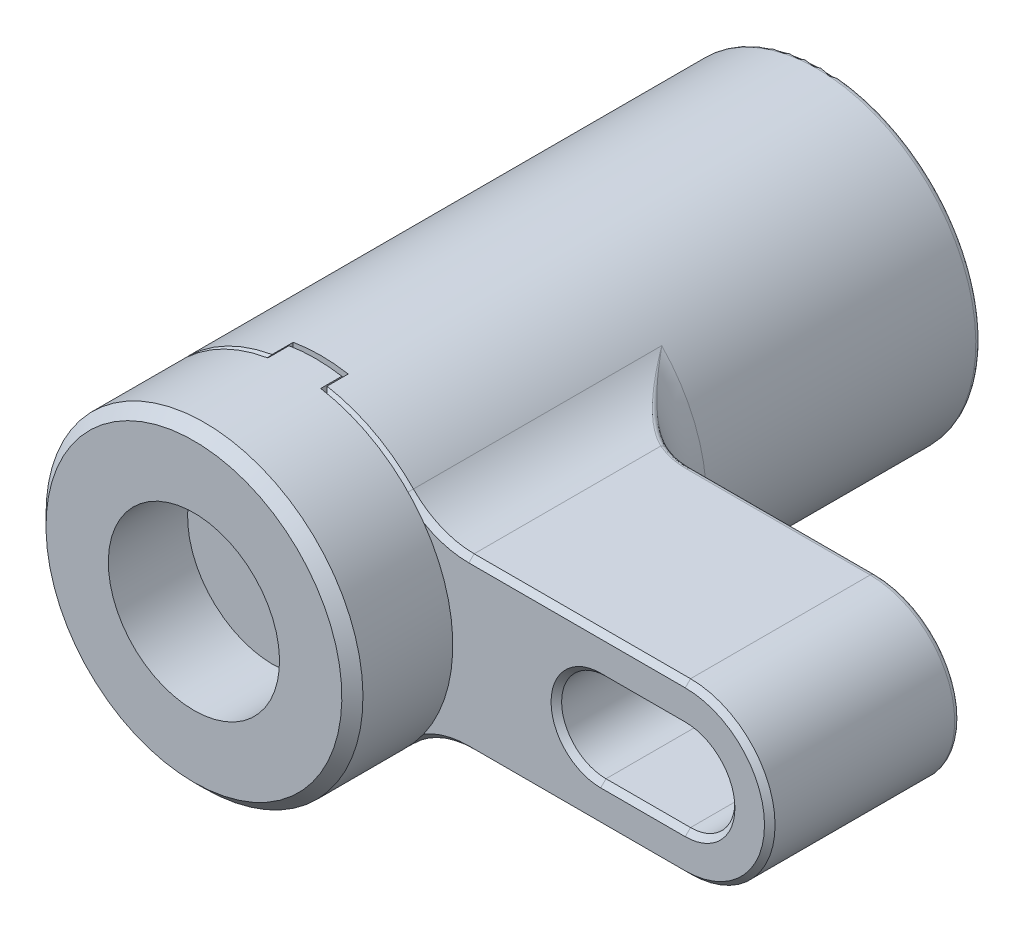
ISO-10303-21;
HEADER;
FILE_DESCRIPTION(('STEP AP214'),'2;1');
FILE_NAME('part.step','',(''),(''),'','','');
FILE_SCHEMA(('AUTOMOTIVE_DESIGN { 1 0 10303 214 1 1 1 1 }'));
ENDSEC;
DATA;
#1=APPLICATION_CONTEXT('core data for automotive mechanical design processes');
#2=APPLICATION_PROTOCOL_DEFINITION('international standard','automotive_design',2000,#1);
#3=PRODUCT_CONTEXT('',#1,'mechanical');
#4=PRODUCT('Part','Part','',(#3));
#5=PRODUCT_RELATED_PRODUCT_CATEGORY('part','',(#4));
#6=PRODUCT_DEFINITION_FORMATION('','',#4);
#7=PRODUCT_DEFINITION_CONTEXT('part definition',#1,'design');
#8=PRODUCT_DEFINITION('design','',#6,#7);
#9=PRODUCT_DEFINITION_SHAPE('','',#8);
#10=(LENGTH_UNIT() NAMED_UNIT(*) SI_UNIT(.MILLI.,.METRE.));
#11=(NAMED_UNIT(*) PLANE_ANGLE_UNIT() SI_UNIT($,.RADIAN.));
#12=(NAMED_UNIT(*) SI_UNIT($,.STERADIAN.) SOLID_ANGLE_UNIT());
#13=UNCERTAINTY_MEASURE_WITH_UNIT(LENGTH_MEASURE(1.E-05),#10,'distance_accuracy_value','');
#14=(GEOMETRIC_REPRESENTATION_CONTEXT(3) GLOBAL_UNCERTAINTY_ASSIGNED_CONTEXT((#13)) GLOBAL_UNIT_ASSIGNED_CONTEXT((#10,
#11,#12)) REPRESENTATION_CONTEXT('',''));
#15=CARTESIAN_POINT('',(0.,0.,0.));
#16=DIRECTION('',(0.,0.,1.));
#17=DIRECTION('',(1.,0.,0.));
#18=AXIS2_PLACEMENT_3D('',#15,#16,#17);
#19=CARTESIAN_POINT('',(2.59999999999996,5.64670651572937,47.5));
#20=DIRECTION('',(0.,-1.,0.));
#21=DIRECTION('',(-1.,0.,0.));
#22=AXIS2_PLACEMENT_3D('',#19,#20,#21);
#23=PLANE('',#22);
#24=DIRECTION('',(-1.,0.,0.));
#25=VECTOR('',#24,1.);
#26=CARTESIAN_POINT('',(2.59999999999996,5.64670651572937,48.));
#27=LINE('',#26,#25);
#28=CARTESIAN_POINT('',(2.5,5.64670651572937,48.));
#29=VERTEX_POINT('',#28);
#30=CARTESIAN_POINT('',(1.998595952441,5.64670651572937,48.));
#31=VERTEX_POINT('',#30);
#32=EDGE_CURVE('E405',#29,#31,#27,.T.);
#33=ORIENTED_EDGE('',*,*,#32,.F.);
#34=DIRECTION('',(0.,0.,1.));
#35=VECTOR('',#34,1.);
#36=CARTESIAN_POINT('',(2.5,5.64670651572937,47.5));
#37=LINE('',#36,#35);
#38=CARTESIAN_POINT('',(2.5,5.64670651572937,50.));
#39=VERTEX_POINT('',#38);
#40=EDGE_CURVE('E417',#29,#39,#37,.T.);
#41=ORIENTED_EDGE('',*,*,#40,.T.);
#42=DIRECTION('',(-1.,0.,0.));
#43=VECTOR('',#42,1.);
#44=CARTESIAN_POINT('',(2.59999999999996,5.64670651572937,50.));
#45=LINE('',#44,#43);
#46=CARTESIAN_POINT('',(3.09999999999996,5.64670651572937,50.));
#47=VERTEX_POINT('',#46);
#48=EDGE_CURVE('E522',#47,#39,#45,.T.);
#49=ORIENTED_EDGE('',*,*,#48,.F.);
#50=DIRECTION('',(0.707106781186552,0.,0.707106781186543));
#51=VECTOR('',#50,1.);
#52=CARTESIAN_POINT('',(1.59999999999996,5.64670651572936,48.5));
#53=LINE('',#52,#51);
#54=CARTESIAN_POINT('',(2.59999999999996,5.64670651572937,49.5));
#55=VERTEX_POINT('',#54);
#56=EDGE_CURVE('E1340',#55,#47,#53,.T.);
#57=ORIENTED_EDGE('',*,*,#56,.F.);
#58=DIRECTION('',(0.,0.,1.));
#59=VECTOR('',#58,1.);
#60=CARTESIAN_POINT('',(2.59999999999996,5.64670651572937,47.5));
#61=LINE('',#60,#59);
#62=CARTESIAN_POINT('',(2.59999999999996,5.64670651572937,47.5));
#63=VERTEX_POINT('',#62);
#64=EDGE_CURVE('E1046',#63,#55,#61,.T.);
#65=ORIENTED_EDGE('',*,*,#64,.F.);
#66=DIRECTION('',(-1.,0.,0.));
#67=VECTOR('',#66,1.);
#68=CARTESIAN_POINT('',(2.59999999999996,5.64670651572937,47.5));
#69=LINE('',#68,#67);
#70=CARTESIAN_POINT('',(1.998595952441,5.64670651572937,47.5));
#71=VERTEX_POINT('',#70);
#72=EDGE_CURVE('E533',#63,#71,#69,.T.);
#73=ORIENTED_EDGE('',*,*,#72,.T.);
#74=DIRECTION('',(0.,0.,-1.));
#75=VECTOR('',#74,1.);
#76=CARTESIAN_POINT('',(1.998595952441,5.64670651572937,53.));
#77=LINE('',#76,#75);
#78=EDGE_CURVE('E410',#31,#71,#77,.T.);
#79=ORIENTED_EDGE('',*,*,#78,.F.);
#80=EDGE_LOOP('',(#33,#41,#49,#57,#65,#73,#79));
#81=FACE_BOUND('',#80,.T.);
#82=ADVANCED_FACE('F14',(#81),#23,.F.);
#83=CARTESIAN_POINT('',(-2.6,-5.64670651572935,47.5));
#84=DIRECTION('',(0.,1.,0.));
#85=DIRECTION('',(1.,0.,0.));
#86=AXIS2_PLACEMENT_3D('',#83,#84,#85);
#87=PLANE('',#86);
#88=DIRECTION('',(1.,0.,0.));
#89=VECTOR('',#88,1.);
#90=CARTESIAN_POINT('',(-2.6,-5.64670651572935,48.));
#91=LINE('',#90,#89);
#92=CARTESIAN_POINT('',(-2.5,-5.64670651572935,48.));
#93=VERTEX_POINT('',#92);
#94=CARTESIAN_POINT('',(-1.99859595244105,-5.64670651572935,48.));
#95=VERTEX_POINT('',#94);
#96=EDGE_CURVE('E428',#93,#95,#91,.T.);
#97=ORIENTED_EDGE('',*,*,#96,.F.);
#98=DIRECTION('',(0.,0.,1.));
#99=VECTOR('',#98,1.);
#100=CARTESIAN_POINT('',(-2.5,-5.64670651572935,47.5));
#101=LINE('',#100,#99);
#102=CARTESIAN_POINT('',(-2.5,-5.64670651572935,50.));
#103=VERTEX_POINT('',#102);
#104=EDGE_CURVE('E431',#93,#103,#101,.T.);
#105=ORIENTED_EDGE('',*,*,#104,.T.);
#106=DIRECTION('',(1.,0.,0.));
#107=VECTOR('',#106,1.);
#108=CARTESIAN_POINT('',(-2.6,-5.64670651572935,50.));
#109=LINE('',#108,#107);
#110=CARTESIAN_POINT('',(-3.1,-5.64670651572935,50.));
#111=VERTEX_POINT('',#110);
#112=EDGE_CURVE('E1062',#111,#103,#109,.T.);
#113=ORIENTED_EDGE('',*,*,#112,.F.);
#114=DIRECTION('',(-0.707106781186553,0.,0.707106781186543));
#115=VECTOR('',#114,1.);
#116=CARTESIAN_POINT('',(-1.6,-5.64670651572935,48.5));
#117=LINE('',#116,#115);
#118=CARTESIAN_POINT('',(-2.6,-5.64670651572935,49.5));
#119=VERTEX_POINT('',#118);
#120=EDGE_CURVE('E1345',#119,#111,#117,.T.);
#121=ORIENTED_EDGE('',*,*,#120,.F.);
#122=DIRECTION('',(0.,0.,1.));
#123=VECTOR('',#122,1.);
#124=CARTESIAN_POINT('',(-2.6,-5.64670651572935,47.5));
#125=LINE('',#124,#123);
#126=CARTESIAN_POINT('',(-2.6,-5.64670651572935,47.5));
#127=VERTEX_POINT('',#126);
#128=EDGE_CURVE('E1065',#127,#119,#125,.T.);
#129=ORIENTED_EDGE('',*,*,#128,.F.);
#130=DIRECTION('',(1.,0.,0.));
#131=VECTOR('',#130,1.);
#132=CARTESIAN_POINT('',(-2.6,-5.64670651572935,47.5));
#133=LINE('',#132,#131);
#134=CARTESIAN_POINT('',(-1.99859595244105,-5.64670651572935,47.5));
#135=VERTEX_POINT('',#134);
#136=EDGE_CURVE('E1052',#127,#135,#133,.T.);
#137=ORIENTED_EDGE('',*,*,#136,.T.);
#138=DIRECTION('',(0.,0.,-1.));
#139=VECTOR('',#138,1.);
#140=CARTESIAN_POINT('',(-1.99859595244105,-5.64670651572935,53.));
#141=LINE('',#140,#139);
#142=EDGE_CURVE('E542',#95,#135,#141,.T.);
#143=ORIENTED_EDGE('',*,*,#142,.F.);
#144=EDGE_LOOP('',(#97,#105,#113,#121,#129,#137,#143));
#145=FACE_BOUND('',#144,.T.);
#146=ADVANCED_FACE('F590',(#145),#87,.F.);
#147=CARTESIAN_POINT('',(0.,0.,50.));
#148=DIRECTION('',(0.,0.,-1.));
#149=DIRECTION('',(0.,1.,0.));
#150=AXIS2_PLACEMENT_3D('',#147,#148,#149);
#151=CYLINDRICAL_SURFACE('',#150,15.);
#152=CARTESIAN_POINT('',(-14.9596122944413,1.09999999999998,43.25));
#153=CARTESIAN_POINT('',(-14.9530459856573,1.18929971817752,43.198443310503));
#154=CARTESIAN_POINT('',(-14.9456789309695,1.2785558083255,43.1469131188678));
#155=CARTESIAN_POINT('',(-14.9297388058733,1.45264060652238,43.0464084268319));
#156=CARTESIAN_POINT('',(-14.9212413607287,1.53747452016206,42.9974309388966));
#157=CARTESIAN_POINT('',(-14.9032655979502,1.70271119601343,42.9020313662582));
#158=CARTESIAN_POINT('',(-14.8938591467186,1.78311988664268,42.8556060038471));
#159=CARTESIAN_POINT('',(-14.8742790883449,1.93950886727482,42.7653115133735));
#160=CARTESIAN_POINT('',(-14.8641735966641,2.01549557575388,42.7214387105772));
#161=CARTESIAN_POINT('',(-14.841321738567,2.17779169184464,42.6277363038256));
#162=CARTESIAN_POINT('',(-14.8284033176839,2.26408317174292,42.5779174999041));
#163=CARTESIAN_POINT('',(-14.8014751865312,2.43382137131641,42.4799214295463));
#164=CARTESIAN_POINT('',(-14.7875115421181,2.51727358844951,42.4317410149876));
#165=CARTESIAN_POINT('',(-14.7586305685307,2.68133138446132,42.3370221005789));
#166=CARTESIAN_POINT('',(-14.7437578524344,2.76194287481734,42.290480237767));
#167=CARTESIAN_POINT('',(-14.7131918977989,2.9203206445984,42.1990387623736));
#168=CARTESIAN_POINT('',(-14.6975418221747,2.99809318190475,42.154135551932));
#169=CARTESIAN_POINT('',(-14.6636172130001,3.16002221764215,42.0606454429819));
#170=CARTESIAN_POINT('',(-14.6452326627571,3.24416153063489,42.0120686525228));
#171=CARTESIAN_POINT('',(-14.6074342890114,3.41027158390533,41.9161665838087));
#172=CARTESIAN_POINT('',(-14.5880535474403,3.49224797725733,41.8688380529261));
#173=CARTESIAN_POINT('',(-14.5483618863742,3.6540307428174,41.7754327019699));
#174=CARTESIAN_POINT('',(-14.5280832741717,3.7338430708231,41.7293524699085));
#175=CARTESIAN_POINT('',(-14.4866925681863,3.8912986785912,41.6384439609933));
#176=CARTESIAN_POINT('',(-14.4656120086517,3.96894818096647,41.5936121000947));
#177=CARTESIAN_POINT('',(-14.4209025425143,4.12853905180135,41.5014720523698));
#178=CARTESIAN_POINT('',(-14.3971966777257,4.21046430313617,41.4541732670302));
#179=CARTESIAN_POINT('',(-14.3488044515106,4.37250846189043,41.3606182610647));
#180=CARTESIAN_POINT('',(-14.3241437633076,4.45263312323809,41.3143587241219));
#181=CARTESIAN_POINT('',(-14.2739190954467,4.61107490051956,41.2228823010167));
#182=CARTESIAN_POINT('',(-14.2483803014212,4.6893980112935,41.1776619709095));
#183=CARTESIAN_POINT('',(-14.196475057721,4.84423749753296,41.0882643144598));
#184=CARTESIAN_POINT('',(-14.1701333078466,4.92076008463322,41.0440834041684));
#185=CARTESIAN_POINT('',(-14.1431555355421,4.99711431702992,41.));
#186=B_SPLINE_CURVE_WITH_KNOTS('',3,(#152,#153,#154,#155,#156,#157,#158,#159,#160,#161,#162,
#163,#164,#165,#166,#167,#168,#169,#170,#171,#172,#173,#174,#175,#176,#177,#178,#179,#180,#181,
#182,#183,#184,#185),.UNSPECIFIED.,.F.,.F.,(4,2,2,2,2,2,2,2,2,2,2,2,2,2,2,2,4),(0.,
0.309965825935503,0.604929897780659,0.884892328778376,1.14985326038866,1.45126323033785,
1.74335797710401,2.02613791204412,2.29960349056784,2.59622998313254,2.88608426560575,
3.16916716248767,3.44547955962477,3.73803971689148,4.02527911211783,4.30719910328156,
4.58380112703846),.UNSPECIFIED.);
#187=CARTESIAN_POINT('',(-14.9596122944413,1.1,43.25));
#188=VERTEX_POINT('',#187);
#189=CARTESIAN_POINT('',(-14.1431555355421,4.99711431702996,41.));
#190=VERTEX_POINT('',#189);
#191=EDGE_CURVE('E493',#188,#190,#186,.T.);
#192=ORIENTED_EDGE('',*,*,#191,.T.);
#193=CARTESIAN_POINT('',(-14.1431555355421,4.99711431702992,41.));
#194=CARTESIAN_POINT('',(-14.1701316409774,4.92076480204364,40.9559193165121));
#195=CARTESIAN_POINT('',(-14.1964718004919,4.84424695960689,40.9117411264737));
#196=CARTESIAN_POINT('',(-14.2483750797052,4.68941384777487,40.8223471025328));
#197=CARTESIAN_POINT('',(-14.2739134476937,4.61109235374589,40.7771276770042));
#198=CARTESIAN_POINT('',(-14.3241383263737,4.45265064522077,40.6856512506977));
#199=CARTESIAN_POINT('',(-14.3487995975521,4.3725244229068,40.63939079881));
#200=CARTESIAN_POINT('',(-14.3971938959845,4.21047391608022,40.5458321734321));
#201=CARTESIAN_POINT('',(-14.420901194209,4.12854386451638,40.4985306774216));
#202=CARTESIAN_POINT('',(-14.4656091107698,3.96895852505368,40.4063939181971));
#203=CARTESIAN_POINT('',(-14.4866869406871,3.89131940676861,40.3615680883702));
#204=CARTESIAN_POINT('',(-14.5280743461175,3.73387773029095,40.2706676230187));
#205=CARTESIAN_POINT('',(-14.5483522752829,3.65406892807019,40.2245893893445));
#206=CARTESIAN_POINT('',(-14.588044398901,3.49228627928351,40.1311840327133));
#207=CARTESIAN_POINT('',(-14.6074261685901,3.410306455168,40.0838534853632));
#208=CARTESIAN_POINT('',(-14.6452280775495,3.24418251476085,39.987943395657));
#209=CARTESIAN_POINT('',(-14.6636150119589,3.16003272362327,39.939360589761));
#210=CARTESIAN_POINT('',(-14.697539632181,2.99810363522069,39.845870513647));
#211=CARTESIAN_POINT('',(-14.7131876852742,2.92034157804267,39.8009733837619));
#212=CARTESIAN_POINT('',(-14.7437512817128,2.76197784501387,39.7095400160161));
#213=CARTESIAN_POINT('',(-14.7586235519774,2.68136989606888,39.6630001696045));
#214=CARTESIAN_POINT('',(-14.7875049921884,2.51731218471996,39.5682812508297));
#215=CARTESIAN_POINT('',(-14.8014694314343,2.43385649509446,39.5200988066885));
#216=CARTESIAN_POINT('',(-14.8284001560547,2.26410428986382,39.4220946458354));
#217=CARTESIAN_POINT('',(-14.8413202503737,2.1778022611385,39.3722697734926));
#218=CARTESIAN_POINT('',(-14.8641727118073,2.01550186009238,39.2785649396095));
#219=CARTESIAN_POINT('',(-14.87427741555,1.93952144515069,39.234695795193));
#220=CARTESIAN_POINT('',(-14.8938566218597,1.78314088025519,39.144406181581));
#221=CARTESIAN_POINT('',(-14.9032629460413,1.7027343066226,39.0979820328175));
#222=CARTESIAN_POINT('',(-14.9212389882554,1.53749766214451,39.0025824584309));
#223=CARTESIAN_POINT('',(-14.9297367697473,1.45266165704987,38.9536037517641));
#224=CARTESIAN_POINT('',(-14.9456778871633,1.27856845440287,38.8530941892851));
#225=CARTESIAN_POINT('',(-14.9530455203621,1.18930604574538,38.8015603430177));
#226=CARTESIAN_POINT('',(-14.9596122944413,1.09999999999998,38.75));
#227=B_SPLINE_CURVE_WITH_KNOTS('',3,(#193,#194,#195,#196,#197,#198,#199,#200,#201,#202,#203,
#204,#205,#206,#207,#208,#209,#210,#211,#212,#213,#214,#215,#216,#217,#218,#219,#220,#221,#222,
#223,#224,#225,#226),.UNSPECIFIED.,.F.,.F.,(4,2,2,2,2,2,2,2,2,2,2,2,2,2,2,2,4),(0.,
0.276584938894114,0.558499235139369,0.845744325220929,1.13832156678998,1.41459702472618,
1.69766760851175,1.98753420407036,2.28419763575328,2.55762636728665,2.84039401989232,
3.13250104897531,3.43394786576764,3.69888683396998,3.97884194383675,4.27381333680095,
4.58380112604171),.UNSPECIFIED.);
#228=CARTESIAN_POINT('',(-14.9596122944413,1.1,38.75));
#229=VERTEX_POINT('',#228);
#230=EDGE_CURVE('E691',#190,#229,#227,.T.);
#231=ORIENTED_EDGE('',*,*,#230,.T.);
#232=DIRECTION('',(0.,0.,-1.));
#233=VECTOR('',#232,1.);
#234=CARTESIAN_POINT('',(-14.9596122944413,1.1,50.));
#235=LINE('',#234,#233);
#236=CARTESIAN_POINT('',(-14.9596122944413,1.1,39.75));
#237=VERTEX_POINT('',#236);
#238=EDGE_CURVE('E568',#237,#229,#235,.T.);
#239=ORIENTED_EDGE('',*,*,#238,.F.);
#240=CARTESIAN_POINT('',(0.,0.,39.75));
#241=DIRECTION('',(0.,0.,1.));
#242=DIRECTION('',(0.,1.,0.));
#243=AXIS2_PLACEMENT_3D('',#240,#241,#242);
#244=CIRCLE('',#243,15.);
#245=CARTESIAN_POINT('',(-14.1421356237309,-5.,39.75));
#246=VERTEX_POINT('',#245);
#247=EDGE_CURVE('E557',#237,#246,#244,.T.);
#248=ORIENTED_EDGE('',*,*,#247,.T.);
#249=DIRECTION('',(0.,0.,-1.));
#250=VECTOR('',#249,1.);
#251=CARTESIAN_POINT('',(-14.1421356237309,-5.,50.));
#252=LINE('',#251,#250);
#253=CARTESIAN_POINT('',(-14.1421356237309,-5.,42.25));
#254=VERTEX_POINT('',#253);
#255=EDGE_CURVE('E560',#254,#246,#252,.T.);
#256=ORIENTED_EDGE('',*,*,#255,.F.);
#257=CARTESIAN_POINT('',(0.,0.,42.25));
#258=DIRECTION('',(0.,0.,-1.));
#259=DIRECTION('',(0.,-1.,0.));
#260=AXIS2_PLACEMENT_3D('',#257,#258,#259);
#261=CIRCLE('',#260,15.);
#262=CARTESIAN_POINT('',(-14.9596122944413,1.1,42.25));
#263=VERTEX_POINT('',#262);
#264=EDGE_CURVE('E549',#254,#263,#261,.T.);
#265=ORIENTED_EDGE('',*,*,#264,.T.);
#266=DIRECTION('',(0.,0.,-1.));
#267=VECTOR('',#266,1.);
#268=CARTESIAN_POINT('',(-14.9596122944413,1.1,50.));
#269=LINE('',#268,#267);
#270=EDGE_CURVE('E572',#188,#263,#269,.T.);
#271=ORIENTED_EDGE('',*,*,#270,.F.);
#272=EDGE_LOOP('',(#192,#231,#239,#248,#256,#265,#271));
#273=FACE_BOUND('',#272,.T.);
#274=ADVANCED_FACE('F579',(#273),#151,.T.);
#275=CARTESIAN_POINT('',(0.,0.,1.5));
#276=DIRECTION('',(0.,0.,1.));
#277=DIRECTION('',(0.,-1.,0.));
#278=AXIS2_PLACEMENT_3D('',#275,#276,#277);
#279=TOROIDAL_SURFACE('',#278,11.5,1.5);
#280=CARTESIAN_POINT('',(0.,0.,1.5));
#281=DIRECTION('',(0.,0.,-1.));
#282=DIRECTION('',(0.,-1.,0.));
#283=AXIS2_PLACEMENT_3D('',#280,#281,#282);
#284=CIRCLE('',#283,10.);
#285=CARTESIAN_POINT('',(0.,-10.,1.5));
#286=VERTEX_POINT('',#285);
#287=EDGE_CURVE('E418',#286,#286,#284,.F.);
#288=ORIENTED_EDGE('',*,*,#287,.T.);
#289=EDGE_LOOP('',(#288));
#290=FACE_BOUND('',#289,.T.);
#291=CARTESIAN_POINT('',(0.,0.,0.));
#292=DIRECTION('',(0.,0.,-1.));
#293=DIRECTION('',(0.,-1.,0.));
#294=AXIS2_PLACEMENT_3D('',#291,#292,#293);
#295=CIRCLE('',#294,11.5);
#296=CARTESIAN_POINT('',(0.,-11.5,0.));
#297=VERTEX_POINT('',#296);
#298=EDGE_CURVE('E2269',#297,#297,#295,.T.);
#299=ORIENTED_EDGE('',*,*,#298,.T.);
#300=EDGE_LOOP('',(#299));
#301=FACE_BOUND('',#300,.T.);
#302=ADVANCED_FACE('F589',(#290,#301),#279,.T.);
#303=CARTESIAN_POINT('',(0.,0.,32.));
#304=DIRECTION('',(0.,0.,1.));
#305=DIRECTION('',(0.,-1.,0.));
#306=AXIS2_PLACEMENT_3D('',#303,#304,#305);
#307=CYLINDRICAL_SURFACE('',#306,10.);
#308=ORIENTED_EDGE('',*,*,#287,.F.);
#309=EDGE_LOOP('',(#308));
#310=FACE_BOUND('',#309,.T.);
#311=CARTESIAN_POINT('',(0.,0.,31.));
#312=DIRECTION('',(0.,0.,-1.));
#313=DIRECTION('',(0.,-1.,0.));
#314=AXIS2_PLACEMENT_3D('',#311,#312,#313);
#315=CIRCLE('',#314,10.);
#316=CARTESIAN_POINT('',(0.,-10.,31.));
#317=VERTEX_POINT('',#316);
#318=EDGE_CURVE('E1074',#317,#317,#315,.T.);
#319=ORIENTED_EDGE('',*,*,#318,.F.);
#320=EDGE_LOOP('',(#319));
#321=FACE_BOUND('',#320,.T.);
#322=ADVANCED_FACE('F1455',(#310,#321),#307,.F.);
#323=CARTESIAN_POINT('',(-5.25,0.,31.));
#324=DIRECTION('',(0.,0.,-1.));
#325=DIRECTION('',(0.,1.,0.));
#326=AXIS2_PLACEMENT_3D('',#323,#324,#325);
#327=PLANE('',#326);
#328=ORIENTED_EDGE('',*,*,#318,.T.);
#329=EDGE_LOOP('',(#328));
#330=FACE_BOUND('',#329,.T.);
#331=ADVANCED_FACE('F1618',(#330),#327,.T.);
#332=CARTESIAN_POINT('',(-13.8421356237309,-5.,50.));
#333=DIRECTION('',(0.,-1.,0.));
#334=DIRECTION('',(-1.,0.,0.));
#335=AXIS2_PLACEMENT_3D('',#332,#333,#334);
#336=PLANE('',#335);
#337=ORIENTED_EDGE('',*,*,#255,.T.);
#338=DIRECTION('',(-1.,0.,0.));
#339=VECTOR('',#338,1.);
#340=CARTESIAN_POINT('',(-13.8421356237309,-5.,39.75));
#341=LINE('',#340,#339);
#342=CARTESIAN_POINT('',(-13.8421356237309,-5.,39.75));
#343=VERTEX_POINT('',#342);
#344=EDGE_CURVE('E556',#343,#246,#341,.T.);
#345=ORIENTED_EDGE('',*,*,#344,.F.);
#346=DIRECTION('',(0.,0.,-1.));
#347=VECTOR('',#346,1.);
#348=CARTESIAN_POINT('',(-13.8421356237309,-5.,50.));
#349=LINE('',#348,#347);
#350=CARTESIAN_POINT('',(-13.8421356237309,-5.,42.25));
#351=VERTEX_POINT('',#350);
#352=EDGE_CURVE('E550',#351,#343,#349,.T.);
#353=ORIENTED_EDGE('',*,*,#352,.F.);
#354=DIRECTION('',(-1.,0.,0.));
#355=VECTOR('',#354,1.);
#356=CARTESIAN_POINT('',(-13.8421356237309,-5.,42.25));
#357=LINE('',#356,#355);
#358=EDGE_CURVE('E553',#351,#254,#357,.T.);
#359=ORIENTED_EDGE('',*,*,#358,.T.);
#360=EDGE_LOOP('',(#337,#345,#353,#359));
#361=FACE_BOUND('',#360,.T.);
#362=ADVANCED_FACE('F712',(#361),#336,.T.);
#363=CARTESIAN_POINT('',(-13.8421356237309,-5.,39.75));
#364=DIRECTION('',(0.,0.,1.));
#365=DIRECTION('',(0.,-1.,0.));
#366=AXIS2_PLACEMENT_3D('',#363,#364,#365);
#367=PLANE('',#366);
#368=ORIENTED_EDGE('',*,*,#247,.F.);
#369=DIRECTION('',(-1.,0.,0.));
#370=VECTOR('',#369,1.);
#371=CARTESIAN_POINT('',(-14.6596122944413,1.1,39.75));
#372=LINE('',#371,#370);
#373=CARTESIAN_POINT('',(-14.6596122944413,1.1,39.75));
#374=VERTEX_POINT('',#373);
#375=EDGE_CURVE('E566',#374,#237,#372,.T.);
#376=ORIENTED_EDGE('',*,*,#375,.F.);
#377=CARTESIAN_POINT('',(0.3,0.,39.75));
#378=DIRECTION('',(0.,0.,1.));
#379=DIRECTION('',(0.,1.,0.));
#380=AXIS2_PLACEMENT_3D('',#377,#378,#379);
#381=CIRCLE('',#380,15.);
#382=EDGE_CURVE('E554',#374,#343,#381,.T.);
#383=ORIENTED_EDGE('',*,*,#382,.T.);
#384=ORIENTED_EDGE('',*,*,#344,.T.);
#385=EDGE_LOOP('',(#368,#376,#383,#384));
#386=FACE_BOUND('',#385,.T.);
#387=ADVANCED_FACE('F708',(#386),#367,.F.);
#388=CARTESIAN_POINT('',(-14.6596122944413,1.1,50.));
#389=DIRECTION('',(0.,-1.,0.));
#390=DIRECTION('',(-1.,0.,0.));
#391=AXIS2_PLACEMENT_3D('',#388,#389,#390);
#392=PLANE('',#391);
#393=ORIENTED_EDGE('',*,*,#238,.T.);
#394=DIRECTION('',(-1.,0.,0.));
#395=VECTOR('',#394,1.);
#396=CARTESIAN_POINT('',(-14.6596122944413,1.1,38.75));
#397=LINE('',#396,#395);
#398=CARTESIAN_POINT('',(-14.6596122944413,1.1,38.75));
#399=VERTEX_POINT('',#398);
#400=EDGE_CURVE('E690',#399,#229,#397,.T.);
#401=ORIENTED_EDGE('',*,*,#400,.F.);
#402=DIRECTION('',(0.,0.,-1.));
#403=VECTOR('',#402,1.);
#404=CARTESIAN_POINT('',(-14.6596122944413,1.1,50.));
#405=LINE('',#404,#403);
#406=EDGE_CURVE('E565',#374,#399,#405,.T.);
#407=ORIENTED_EDGE('',*,*,#406,.F.);
#408=ORIENTED_EDGE('',*,*,#375,.T.);
#409=EDGE_LOOP('',(#393,#401,#407,#408));
#410=FACE_BOUND('',#409,.T.);
#411=ADVANCED_FACE('F651',(#410),#392,.T.);
#412=CARTESIAN_POINT('',(-14.6596122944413,1.1,38.75));
#413=DIRECTION('',(0.,-0.5,0.866025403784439));
#414=DIRECTION('',(0.,-0.866025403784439,-0.5));
#415=AXIS2_PLACEMENT_3D('',#412,#413,#414);
#416=PLANE('',#415);
#417=ORIENTED_EDGE('',*,*,#230,.F.);
#418=DIRECTION('',(-1.,0.,0.));
#419=VECTOR('',#418,1.);
#420=CARTESIAN_POINT('',(-13.8431555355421,4.99711431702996,41.));
#421=LINE('',#420,#419);
#422=CARTESIAN_POINT('',(-13.8431555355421,4.99711431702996,41.));
#423=VERTEX_POINT('',#422);
#424=EDGE_CURVE('E681',#423,#190,#421,.T.);
#425=ORIENTED_EDGE('',*,*,#424,.F.);
#426=CARTESIAN_POINT('',(-13.8431555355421,4.99711431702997,41.));
#427=CARTESIAN_POINT('',(-14.1762655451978,4.05413520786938,40.4555707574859));
#428=CARTESIAN_POINT('',(-14.3812686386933,3.0757683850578,39.8907104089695));
#429=CARTESIAN_POINT('',(-14.5861745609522,2.09786530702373,39.3261178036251));
#430=CARTESIAN_POINT('',(-14.6596122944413,1.1,38.75));
#431=B_SPLINE_CURVE_WITH_KNOTS('',2,(#426,#427,#428,#429,#430),.UNSPECIFIED.,.F.,.F.,(3,2,3),
(0.,0.5,1.),.UNSPECIFIED.);
#432=EDGE_CURVE('E685',#423,#399,#431,.T.);
#433=ORIENTED_EDGE('',*,*,#432,.T.);
#434=ORIENTED_EDGE('',*,*,#400,.T.);
#435=EDGE_LOOP('',(#417,#425,#433,#434));
#436=FACE_BOUND('',#435,.T.);
#437=ADVANCED_FACE('F646',(#436),#416,.F.);
#438=CARTESIAN_POINT('',(-13.8431555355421,4.99711431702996,41.));
#439=DIRECTION('',(0.,-0.5,-0.866025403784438));
#440=DIRECTION('',(0.,0.866025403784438,-0.5));
#441=AXIS2_PLACEMENT_3D('',#438,#439,#440);
#442=PLANE('',#441);
#443=ORIENTED_EDGE('',*,*,#191,.F.);
#444=DIRECTION('',(-1.,0.,0.));
#445=VECTOR('',#444,1.);
#446=CARTESIAN_POINT('',(-14.6596122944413,1.1,43.25));
#447=LINE('',#446,#445);
#448=CARTESIAN_POINT('',(-14.6596122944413,1.1,43.25));
#449=VERTEX_POINT('',#448);
#450=EDGE_CURVE('E664',#449,#188,#447,.T.);
#451=ORIENTED_EDGE('',*,*,#450,.F.);
#452=CARTESIAN_POINT('',(-14.6596122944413,1.09999999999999,43.25));
#453=CARTESIAN_POINT('',(-14.5862096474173,2.09738855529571,42.6741574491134));
#454=CARTESIAN_POINT('',(-14.3812686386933,3.07576838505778,42.1092895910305));
#455=CARTESIAN_POINT('',(-14.176424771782,4.05368446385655,41.5446894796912));
#456=CARTESIAN_POINT('',(-13.8431555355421,4.99711431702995,41.));
#457=B_SPLINE_CURVE_WITH_KNOTS('',2,(#452,#453,#454,#455,#456),.UNSPECIFIED.,.F.,.F.,(3,2,3),
(0.,0.5,1.),.UNSPECIFIED.);
#458=EDGE_CURVE('E671',#449,#423,#457,.T.);
#459=ORIENTED_EDGE('',*,*,#458,.T.);
#460=ORIENTED_EDGE('',*,*,#424,.T.);
#461=EDGE_LOOP('',(#443,#451,#459,#460));
#462=FACE_BOUND('',#461,.T.);
#463=ADVANCED_FACE('F636',(#462),#442,.F.);
#464=CARTESIAN_POINT('',(-14.6596122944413,1.1,50.));
#465=DIRECTION('',(0.,-1.,0.));
#466=DIRECTION('',(-1.,0.,0.));
#467=AXIS2_PLACEMENT_3D('',#464,#465,#466);
#468=PLANE('',#467);
#469=ORIENTED_EDGE('',*,*,#270,.T.);
#470=DIRECTION('',(-1.,0.,0.));
#471=VECTOR('',#470,1.);
#472=CARTESIAN_POINT('',(-14.6596122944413,1.1,42.25));
#473=LINE('',#472,#471);
#474=CARTESIAN_POINT('',(-14.6596122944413,1.1,42.25));
#475=VERTEX_POINT('',#474);
#476=EDGE_CURVE('E548',#475,#263,#473,.T.);
#477=ORIENTED_EDGE('',*,*,#476,.F.);
#478=DIRECTION('',(0.,0.,-1.));
#479=VECTOR('',#478,1.);
#480=CARTESIAN_POINT('',(-14.6596122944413,1.1,50.));
#481=LINE('',#480,#479);
#482=EDGE_CURVE('E623',#449,#475,#481,.T.);
#483=ORIENTED_EDGE('',*,*,#482,.F.);
#484=ORIENTED_EDGE('',*,*,#450,.T.);
#485=EDGE_LOOP('',(#469,#477,#483,#484));
#486=FACE_BOUND('',#485,.T.);
#487=ADVANCED_FACE('F592',(#486),#468,.T.);
#488=CARTESIAN_POINT('',(-14.6596122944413,1.1,42.25));
#489=DIRECTION('',(0.,0.,-1.));
#490=DIRECTION('',(0.,1.,0.));
#491=AXIS2_PLACEMENT_3D('',#488,#489,#490);
#492=PLANE('',#491);
#493=ORIENTED_EDGE('',*,*,#264,.F.);
#494=ORIENTED_EDGE('',*,*,#358,.F.);
#495=CARTESIAN_POINT('',(0.3,0.,42.25));
#496=DIRECTION('',(0.,0.,-1.));
#497=DIRECTION('',(0.,-1.,0.));
#498=AXIS2_PLACEMENT_3D('',#495,#496,#497);
#499=CIRCLE('',#498,15.);
#500=EDGE_CURVE('E546',#351,#475,#499,.T.);
#501=ORIENTED_EDGE('',*,*,#500,.T.);
#502=ORIENTED_EDGE('',*,*,#476,.T.);
#503=EDGE_LOOP('',(#493,#494,#501,#502));
#504=FACE_BOUND('',#503,.T.);
#505=ADVANCED_FACE('F716',(#504),#492,.F.);
#506=CARTESIAN_POINT('',(0.,4.7,32.5));
#507=DIRECTION('',(1.,0.,0.));
#508=DIRECTION('',(0.,-1.,0.));
#509=AXIS2_PLACEMENT_3D('',#506,#507,#508);
#510=CYLINDRICAL_SURFACE('',#509,0.5);
#511=CARTESIAN_POINT('',(29.,4.7,32.5));
#512=DIRECTION('',(-1.,0.,0.));
#513=DIRECTION('',(0.,-1.,0.));
#514=AXIS2_PLACEMENT_3D('',#511,#512,#513);
#515=CIRCLE('',#514,0.5);
#516=CARTESIAN_POINT('',(29.,4.7,32.));
#517=VERTEX_POINT('',#516);
#518=CARTESIAN_POINT('',(29.,4.2,32.5));
#519=VERTEX_POINT('',#518);
#520=EDGE_CURVE('E1317',#517,#519,#515,.T.);
#521=ORIENTED_EDGE('',*,*,#520,.F.);
#522=DIRECTION('',(1.,0.,0.));
#523=VECTOR('',#522,1.);
#524=CARTESIAN_POINT('',(0.,4.7,32.));
#525=LINE('',#524,#523);
#526=CARTESIAN_POINT('',(37.,4.7,32.));
#527=VERTEX_POINT('',#526);
#528=EDGE_CURVE('E2317',#517,#527,#525,.T.);
#529=ORIENTED_EDGE('',*,*,#528,.T.);
#530=CARTESIAN_POINT('',(37.,4.7,32.5));
#531=DIRECTION('',(1.,0.,0.));
#532=DIRECTION('',(0.,1.,0.));
#533=AXIS2_PLACEMENT_3D('',#530,#531,#532);
#534=CIRCLE('',#533,0.5);
#535=CARTESIAN_POINT('',(37.,4.2,32.5));
#536=VERTEX_POINT('',#535);
#537=EDGE_CURVE('E2130',#536,#527,#534,.T.);
#538=ORIENTED_EDGE('',*,*,#537,.F.);
#539=DIRECTION('',(1.,0.,0.));
#540=VECTOR('',#539,1.);
#541=CARTESIAN_POINT('',(29.,4.2,32.5));
#542=LINE('',#541,#540);
#543=EDGE_CURVE('E2304',#536,#519,#542,.F.);
#544=ORIENTED_EDGE('',*,*,#543,.T.);
#545=EDGE_LOOP('',(#521,#529,#538,#544));
#546=FACE_BOUND('',#545,.T.);
#547=ADVANCED_FACE('F725',(#546),#510,.T.);
#548=CARTESIAN_POINT('',(37.,0.,32.5));
#549=DIRECTION('',(0.,0.,1.));
#550=DIRECTION('',(0.,-1.,0.));
#551=AXIS2_PLACEMENT_3D('',#548,#549,#550);
#552=TOROIDAL_SURFACE('',#551,4.7,0.5);
#553=CARTESIAN_POINT('',(37.,-4.7,32.5));
#554=DIRECTION('',(-1.,0.,0.));
#555=DIRECTION('',(0.,-1.,0.));
#556=AXIS2_PLACEMENT_3D('',#553,#554,#555);
#557=CIRCLE('',#556,0.5);
#558=CARTESIAN_POINT('',(37.,-4.2,32.5));
#559=VERTEX_POINT('',#558);
#560=CARTESIAN_POINT('',(37.,-4.7,32.));
#561=VERTEX_POINT('',#560);
#562=EDGE_CURVE('E1310',#559,#561,#557,.T.);
#563=ORIENTED_EDGE('',*,*,#562,.F.);
#564=CARTESIAN_POINT('',(37.,0.,32.5));
#565=DIRECTION('',(0.,0.,-1.));
#566=DIRECTION('',(0.,-1.,0.));
#567=AXIS2_PLACEMENT_3D('',#564,#565,#566);
#568=CIRCLE('',#567,4.2);
#569=EDGE_CURVE('E1324',#559,#536,#568,.F.);
#570=ORIENTED_EDGE('',*,*,#569,.T.);
#571=ORIENTED_EDGE('',*,*,#537,.T.);
#572=CARTESIAN_POINT('',(37.,0.,32.));
#573=DIRECTION('',(0.,0.,-1.));
#574=DIRECTION('',(0.,-1.,0.));
#575=AXIS2_PLACEMENT_3D('',#572,#573,#574);
#576=CIRCLE('',#575,4.7);
#577=EDGE_CURVE('E2173',#527,#561,#576,.T.);
#578=ORIENTED_EDGE('',*,*,#577,.T.);
#579=EDGE_LOOP('',(#563,#570,#571,#578));
#580=FACE_BOUND('',#579,.T.);
#581=ADVANCED_FACE('F1664',(#580),#552,.T.);
#582=CARTESIAN_POINT('',(0.,-4.7,32.5));
#583=DIRECTION('',(-1.,0.,0.));
#584=DIRECTION('',(0.,1.,0.));
#585=AXIS2_PLACEMENT_3D('',#582,#583,#584);
#586=CYLINDRICAL_SURFACE('',#585,0.5);
#587=ORIENTED_EDGE('',*,*,#562,.T.);
#588=DIRECTION('',(-1.,0.,0.));
#589=VECTOR('',#588,1.);
#590=CARTESIAN_POINT('',(0.,-4.7,32.));
#591=LINE('',#590,#589);
#592=CARTESIAN_POINT('',(29.,-4.7,32.));
#593=VERTEX_POINT('',#592);
#594=EDGE_CURVE('E2322',#561,#593,#591,.T.);
#595=ORIENTED_EDGE('',*,*,#594,.T.);
#596=CARTESIAN_POINT('',(29.,-4.7,32.5));
#597=DIRECTION('',(1.,0.,0.));
#598=DIRECTION('',(0.,1.,0.));
#599=AXIS2_PLACEMENT_3D('',#596,#597,#598);
#600=CIRCLE('',#599,0.5);
#601=CARTESIAN_POINT('',(29.,-4.2,32.5));
#602=VERTEX_POINT('',#601);
#603=EDGE_CURVE('E1307',#593,#602,#600,.T.);
#604=ORIENTED_EDGE('',*,*,#603,.T.);
#605=DIRECTION('',(-1.,0.,0.));
#606=VECTOR('',#605,1.);
#607=CARTESIAN_POINT('',(29.,-4.2,32.5));
#608=LINE('',#607,#606);
#609=EDGE_CURVE('E2299',#602,#559,#608,.F.);
#610=ORIENTED_EDGE('',*,*,#609,.T.);
#611=EDGE_LOOP('',(#587,#595,#604,#610));
#612=FACE_BOUND('',#611,.T.);
#613=ADVANCED_FACE('F1408',(#612),#586,.T.);
#614=CARTESIAN_POINT('',(29.,0.,32.5));
#615=DIRECTION('',(0.,0.,1.));
#616=DIRECTION('',(0.,-1.,0.));
#617=AXIS2_PLACEMENT_3D('',#614,#615,#616);
#618=TOROIDAL_SURFACE('',#617,4.7,0.5);
#619=ORIENTED_EDGE('',*,*,#603,.F.);
#620=CARTESIAN_POINT('',(29.,0.,32.));
#621=DIRECTION('',(0.,0.,-1.));
#622=DIRECTION('',(0.,-1.,0.));
#623=AXIS2_PLACEMENT_3D('',#620,#621,#622);
#624=CIRCLE('',#623,4.7);
#625=EDGE_CURVE('E2312',#593,#517,#624,.T.);
#626=ORIENTED_EDGE('',*,*,#625,.T.);
#627=ORIENTED_EDGE('',*,*,#520,.T.);
#628=CARTESIAN_POINT('',(29.,0.,32.5));
#629=DIRECTION('',(0.,0.,-1.));
#630=DIRECTION('',(0.,-1.,0.));
#631=AXIS2_PLACEMENT_3D('',#628,#629,#630);
#632=CIRCLE('',#631,4.2);
#633=EDGE_CURVE('E2300',#519,#602,#632,.F.);
#634=ORIENTED_EDGE('',*,*,#633,.T.);
#635=EDGE_LOOP('',(#619,#626,#627,#634));
#636=FACE_BOUND('',#635,.T.);
#637=ADVANCED_FACE('F1206',(#636),#618,.T.);
#638=CARTESIAN_POINT('',(37.,0.,32.5));
#639=DIRECTION('',(0.,0.,1.));
#640=DIRECTION('',(0.,-1.,0.));
#641=AXIS2_PLACEMENT_3D('',#638,#639,#640);
#642=TOROIDAL_SURFACE('',#641,7.5,0.5);
#643=CARTESIAN_POINT('',(37.,-7.5,32.5));
#644=DIRECTION('',(-1.,0.,0.));
#645=DIRECTION('',(0.,-1.,0.));
#646=AXIS2_PLACEMENT_3D('',#643,#644,#645);
#647=CIRCLE('',#646,0.5);
#648=CARTESIAN_POINT('',(37.,-7.5,32.));
#649=VERTEX_POINT('',#648);
#650=CARTESIAN_POINT('',(37.,-8.,32.5));
#651=VERTEX_POINT('',#650);
#652=EDGE_CURVE('E1306',#649,#651,#647,.T.);
#653=ORIENTED_EDGE('',*,*,#652,.F.);
#654=CARTESIAN_POINT('',(37.,0.,32.));
#655=DIRECTION('',(0.,0.,-1.));
#656=DIRECTION('',(0.,-1.,0.));
#657=AXIS2_PLACEMENT_3D('',#654,#655,#656);
#658=CIRCLE('',#657,7.5);
#659=CARTESIAN_POINT('',(37.,7.5,32.));
#660=VERTEX_POINT('',#659);
#661=EDGE_CURVE('E1281',#649,#660,#658,.F.);
#662=ORIENTED_EDGE('',*,*,#661,.T.);
#663=CARTESIAN_POINT('',(37.,7.5,32.5));
#664=DIRECTION('',(1.,0.,0.));
#665=DIRECTION('',(0.,1.,0.));
#666=AXIS2_PLACEMENT_3D('',#663,#664,#665);
#667=CIRCLE('',#666,0.5);
#668=CARTESIAN_POINT('',(37.,8.,32.5));
#669=VERTEX_POINT('',#668);
#670=EDGE_CURVE('E1193',#660,#669,#667,.T.);
#671=ORIENTED_EDGE('',*,*,#670,.T.);
#672=CARTESIAN_POINT('',(37.,0.,32.5));
#673=DIRECTION('',(0.,0.,-1.));
#674=DIRECTION('',(0.,-1.,0.));
#675=AXIS2_PLACEMENT_3D('',#672,#673,#674);
#676=CIRCLE('',#675,8.);
#677=EDGE_CURVE('E2169',#669,#651,#676,.T.);
#678=ORIENTED_EDGE('',*,*,#677,.T.);
#679=EDGE_LOOP('',(#653,#662,#671,#678));
#680=FACE_BOUND('',#679,.T.);
#681=ADVANCED_FACE('F1203',(#680),#642,.T.);
#682=CARTESIAN_POINT('',(12.6885775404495,-7.5,32.5));
#683=DIRECTION('',(-1.,0.,0.));
#684=DIRECTION('',(0.,1.,0.));
#685=AXIS2_PLACEMENT_3D('',#682,#683,#684);
#686=CYLINDRICAL_SURFACE('',#685,0.5);
#687=CARTESIAN_POINT('',(19.615045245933,-7.5,32.5));
#688=DIRECTION('',(-1.,0.,0.));
#689=DIRECTION('',(0.,-1.,0.));
#690=AXIS2_PLACEMENT_3D('',#687,#688,#689);
#691=CIRCLE('',#690,0.5);
#692=CARTESIAN_POINT('',(19.6150452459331,-7.5,32.));
#693=VERTEX_POINT('',#692);
#694=CARTESIAN_POINT('',(19.615045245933,-8.,32.5));
#695=VERTEX_POINT('',#694);
#696=EDGE_CURVE('E2176',#693,#695,#691,.T.);
#697=ORIENTED_EDGE('',*,*,#696,.F.);
#698=DIRECTION('',(-1.,0.,0.));
#699=VECTOR('',#698,1.);
#700=CARTESIAN_POINT('',(0.,-7.5,32.));
#701=LINE('',#700,#699);
#702=EDGE_CURVE('E1285',#693,#649,#701,.F.);
#703=ORIENTED_EDGE('',*,*,#702,.T.);
#704=ORIENTED_EDGE('',*,*,#652,.T.);
#705=DIRECTION('',(-1.,0.,0.));
#706=VECTOR('',#705,1.);
#707=CARTESIAN_POINT('',(12.6885775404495,-8.,32.5));
#708=LINE('',#707,#706);
#709=EDGE_CURVE('E1264',#651,#695,#708,.T.);
#710=ORIENTED_EDGE('',*,*,#709,.T.);
#711=EDGE_LOOP('',(#697,#703,#704,#710));
#712=FACE_BOUND('',#711,.T.);
#713=ADVANCED_FACE('F1201',(#712),#686,.T.);
#714=CARTESIAN_POINT('',(12.6885775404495,7.5,32.5));
#715=DIRECTION('',(1.,0.,0.));
#716=DIRECTION('',(0.,-1.,0.));
#717=AXIS2_PLACEMENT_3D('',#714,#715,#716);
#718=CYLINDRICAL_SURFACE('',#717,0.5);
#719=ORIENTED_EDGE('',*,*,#670,.F.);
#720=DIRECTION('',(1.,0.,0.));
#721=VECTOR('',#720,1.);
#722=CARTESIAN_POINT('',(0.,7.5,32.));
#723=LINE('',#722,#721);
#724=CARTESIAN_POINT('',(19.6150452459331,7.5,32.));
#725=VERTEX_POINT('',#724);
#726=EDGE_CURVE('E1265',#660,#725,#723,.F.);
#727=ORIENTED_EDGE('',*,*,#726,.T.);
#728=CARTESIAN_POINT('',(19.6150452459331,7.5,32.5));
#729=DIRECTION('',(1.,0.,0.));
#730=DIRECTION('',(0.,1.,0.));
#731=AXIS2_PLACEMENT_3D('',#728,#729,#730);
#732=CIRCLE('',#731,0.5);
#733=CARTESIAN_POINT('',(19.6150452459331,8.,32.5));
#734=VERTEX_POINT('',#733);
#735=EDGE_CURVE('E1173',#725,#734,#732,.T.);
#736=ORIENTED_EDGE('',*,*,#735,.T.);
#737=DIRECTION('',(1.,0.,0.));
#738=VECTOR('',#737,1.);
#739=CARTESIAN_POINT('',(12.6885775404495,8.,32.5));
#740=LINE('',#739,#738);
#741=EDGE_CURVE('E1282',#734,#669,#740,.T.);
#742=ORIENTED_EDGE('',*,*,#741,.T.);
#743=EDGE_LOOP('',(#719,#727,#736,#742));
#744=FACE_BOUND('',#743,.T.);
#745=ADVANCED_FACE('F1197',(#744),#718,.T.);
#746=CARTESIAN_POINT('',(0.,0.,32.));
#747=DIRECTION('',(0.,0.,1.));
#748=DIRECTION('',(0.,-1.,0.));
#749=AXIS2_PLACEMENT_3D('',#746,#747,#748);
#750=PLANE('',#749);
#751=ORIENTED_EDGE('',*,*,#625,.F.);
#752=ORIENTED_EDGE('',*,*,#594,.F.);
#753=ORIENTED_EDGE('',*,*,#577,.F.);
#754=ORIENTED_EDGE('',*,*,#528,.F.);
#755=EDGE_LOOP('',(#751,#752,#753,#754));
#756=FACE_BOUND('',#755,.T.);
#757=ORIENTED_EDGE('',*,*,#661,.F.);
#758=ORIENTED_EDGE('',*,*,#702,.F.);
#759=CARTESIAN_POINT('',(0.,0.,32.));
#760=DIRECTION('',(0.,0.,-1.));
#761=DIRECTION('',(0.,-1.,0.));
#762=AXIS2_PLACEMENT_3D('',#759,#760,#761);
#763=CIRCLE('',#762,21.);
#764=EDGE_CURVE('E1121',#725,#693,#763,.T.);
#765=ORIENTED_EDGE('',*,*,#764,.F.);
#766=ORIENTED_EDGE('',*,*,#726,.F.);
#767=EDGE_LOOP('',(#757,#758,#765,#766));
#768=FACE_BOUND('',#767,.T.);
#769=ADVANCED_FACE('F1200',(#756,#768),#750,.F.);
#770=CARTESIAN_POINT('',(21.9910223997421,-8.,32.1037490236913));
#771=CARTESIAN_POINT('',(21.808007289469,-8.,31.5756179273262));
#772=CARTESIAN_POINT('',(21.8283182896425,-7.44451004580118,31.6342298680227));
#773=CARTESIAN_POINT('',(21.8004604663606,-8.,32.1698036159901));
#774=CARTESIAN_POINT('',(21.6348563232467,-8.,31.6404533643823));
#775=CARTESIAN_POINT('',(21.6510346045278,-7.44855720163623,31.6952033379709));
#776=CARTESIAN_POINT('',(21.6070843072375,-8.,32.2276411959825));
#777=CARTESIAN_POINT('',(21.4579080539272,-8.,31.6983647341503));
#778=CARTESIAN_POINT('',(21.4710844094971,-7.4527538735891,31.7485918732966));
#779=CARTESIAN_POINT('',(21.2161996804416,-8.,32.3267848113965));
#780=CARTESIAN_POINT('',(21.0991127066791,-8.,31.7992116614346));
#781=CARTESIAN_POINT('',(21.1072261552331,-7.46143763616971,31.8401090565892));
#782=CARTESIAN_POINT('',(21.0186925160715,-8.,32.3680959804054));
#783=CARTESIAN_POINT('',(20.917403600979,-8.,31.8422672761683));
#784=CARTESIAN_POINT('',(20.9233193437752,-7.46592463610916,31.8782424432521));
#785=CARTESIAN_POINT('',(20.6208351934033,-8.,32.4341447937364));
#786=CARTESIAN_POINT('',(20.5502230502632,-8.,31.9132131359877));
#787=CARTESIAN_POINT('',(20.5527305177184,-7.47518498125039,31.9392105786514));
#788=CARTESIAN_POINT('',(20.4204838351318,-8.,32.4588752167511));
#789=CARTESIAN_POINT('',(20.3648686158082,-8.,31.9412288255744));
#790=CARTESIAN_POINT('',(20.3660473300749,-7.47995845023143,31.9620386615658));
#791=CARTESIAN_POINT('',(20.0184656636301,-8.,32.4918070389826));
#792=CARTESIAN_POINT('',(19.9918324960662,-8.,31.9819504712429));
#793=CARTESIAN_POINT('',(19.9913115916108,-7.48977719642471,31.9924372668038));
#794=CARTESIAN_POINT('',(19.816798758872,-8.,32.5000072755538));
#795=CARTESIAN_POINT('',(19.8042487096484,-8.,31.9948006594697));
#796=CARTESIAN_POINT('',(19.8032589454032,-7.4948224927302,32.0000067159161));
#797=CARTESIAN_POINT('',(19.187242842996,-8.,32.4999845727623));
#798=CARTESIAN_POINT('',(19.2202653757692,-8.,32.0108486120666));
#799=CARTESIAN_POINT('',(19.2159529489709,-7.51097849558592,31.99998575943));
#800=CARTESIAN_POINT('',(18.7590510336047,-8.,32.4630666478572));
#801=CARTESIAN_POINT('',(18.8187695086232,-8.,31.9883863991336));
#802=CARTESIAN_POINT('',(18.816136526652,-7.5225514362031,31.9659076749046));
#803=CARTESIAN_POINT('',(17.9158340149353,-8.,32.3179260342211));
#804=CARTESIAN_POINT('',(18.0233081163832,-8.,31.87436368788));
#805=CARTESIAN_POINT('',(18.027928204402,-7.54664292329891,31.8319317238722));
#806=CARTESIAN_POINT('',(17.5007835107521,-8.,32.2098503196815));
#807=CARTESIAN_POINT('',(17.629604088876,-8.,31.7845246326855));
#808=CARTESIAN_POINT('',(17.6395144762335,-7.55915947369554,31.7321695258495));
#809=CARTESIAN_POINT('',(17.0006602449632,-8.,32.0340579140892));
#810=CARTESIAN_POINT('',(17.1489375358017,-8.,31.6306011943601));
#811=CARTESIAN_POINT('',(17.1708805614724,-7.57507628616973,31.5698996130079));
#812=CARTESIAN_POINT('',(16.9039334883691,-8.,31.9978438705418));
#813=CARTESIAN_POINT('',(17.0566449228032,-8.,31.5989826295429));
#814=CARTESIAN_POINT('',(17.0802145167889,-7.57819526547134,31.5364712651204));
#815=CARTESIAN_POINT('',(16.7121068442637,-8.,31.9215793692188));
#816=CARTESIAN_POINT('',(16.8734147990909,-8.,31.5320137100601));
#817=CARTESIAN_POINT('',(16.9003482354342,-7.5844603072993,31.4660732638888));
#818=CARTESIAN_POINT('',(16.6170056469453,-8.,31.8815321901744));
#819=CARTESIAN_POINT('',(16.7824704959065,-8.,31.4966870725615));
#820=CARTESIAN_POINT('',(16.8111468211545,-7.5876063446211,31.429106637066));
#821=CARTESIAN_POINT('',(16.1470892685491,-8.,31.6723312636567));
#822=CARTESIAN_POINT('',(16.336112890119,-8.,31.3126884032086));
#823=CARTESIAN_POINT('',(16.3702297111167,-7.60335288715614,31.2359980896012));
#824=CARTESIAN_POINT('',(15.7842757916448,-8.,31.4744614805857));
#825=CARTESIAN_POINT('',(15.9867316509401,-8.,31.1352435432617));
#826=CARTESIAN_POINT('',(16.0293150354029,-7.61615684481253,31.0533490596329));
#827=CARTESIAN_POINT('',(15.2671055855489,-8.,31.1346574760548));
#828=CARTESIAN_POINT('',(15.4848847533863,-8.,30.8244275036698));
#829=CARTESIAN_POINT('',(15.5426378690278,-7.63528211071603,30.739683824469));
#830=CARTESIAN_POINT('',(15.0985453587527,-8.,31.0135963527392));
#831=CARTESIAN_POINT('',(15.3217121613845,-8.,30.7137581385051));
#832=CARTESIAN_POINT('',(15.3838872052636,-7.64167158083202,30.6279350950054));
#833=CARTESIAN_POINT('',(14.772291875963,-8.,30.7577231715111));
#834=CARTESIAN_POINT('',(15.0054787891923,-8.,30.4787341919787));
#835=CARTESIAN_POINT('',(15.0763799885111,-7.65431775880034,30.3917444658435));
#836=CARTESIAN_POINT('',(14.6145954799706,-8.,30.6229151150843));
#837=CARTESIAN_POINT('',(14.8522644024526,-8.,30.3544763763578));
#838=CARTESIAN_POINT('',(14.9276205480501,-7.66057450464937,30.2673062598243));
#839=CARTESIAN_POINT('',(14.4628672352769,-8.,30.4814470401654));
#840=CARTESIAN_POINT('',(14.703976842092,-8.,30.2229241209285));
#841=CARTESIAN_POINT('',(14.7843741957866,-7.66672366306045,30.136720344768));
#842=(BOUNDED_SURFACE() B_SPLINE_SURFACE(3,2,((#770,#771,#772),(#773,#774,#775),(#776,#777,
#778),(#779,#780,#781),(#782,#783,#784),(#785,#786,#787),(#788,#789,#790),(#791,#792,#793),
(#794,#795,#796),(#797,#798,#799),(#800,#801,#802),(#803,#804,#805),(#806,#807,#808),(#809,#810,
#811),(#812,#813,#814),(#815,#816,#817),(#818,#819,#820),(#821,#822,#823),(#824,#825,#826),
(#827,#828,#829),(#830,#831,#832),(#833,#834,#835),(#836,#837,#838),(#839,#840,#841)),
.UNSPECIFIED.,.F.,.F.,.F.) B_SPLINE_SURFACE_WITH_KNOTS((4,2,2,2,2,2,2,2,2,2,2,4),(3,3),(0.,
0.604821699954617,1.20945537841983,1.8143522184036,2.4192916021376,3.70201782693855,
4.98210289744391,5.29190035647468,5.60143515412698,6.83447425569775,7.45647095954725,
8.07828712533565),(0.,1.),
.UNSPECIFIED.) GEOMETRIC_REPRESENTATION_ITEM() RATIONAL_B_SPLINE_SURFACE(((1.,0.6667158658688,
1.),(1.,0.669751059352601,1.),(1.,0.672877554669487,1.),(1.,0.679299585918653,1.),(1.,
0.682595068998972,1.),(1.,0.689344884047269,1.),(1.,0.692799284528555,1.),(1.,0.699849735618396,
1.),(1.,0.703445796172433,1.),(1.,0.714869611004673,1.),(1.,0.722924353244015,1.),(1.,
0.739398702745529,1.),(1.,0.747817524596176,1.),(1.,0.758340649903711,1.),(1.,0.76039429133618,
1.),(1.,0.764502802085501,1.),(1.,0.766557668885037,1.),(1.,0.776800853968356,1.),(1.,
0.784997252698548,1.),(1.,0.79705625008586,1.),(1.,0.801053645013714,1.),(1.,0.80890867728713,
1.),(1.,0.812766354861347,1.),(1.,0.816531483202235,1.))) REPRESENTATION_ITEM('') SURFACE());
#843=CARTESIAN_POINT('',(16.5227116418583,-7.5,31.8395536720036));
#844=DIRECTION('',(-0.913571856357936,0.,-0.406677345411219));
#845=DIRECTION('',(0.406677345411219,0.,-0.913571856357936));
#846=AXIS2_PLACEMENT_3D('',#843,#844,#845);
#847=CIRCLE('',#846,0.5);
#848=CARTESIAN_POINT('',(16.7226718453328,-7.59076606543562,31.3903572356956));
#849=VERTEX_POINT('',#848);
#850=CARTESIAN_POINT('',(16.5227116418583,-8.,31.8395536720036));
#851=VERTEX_POINT('',#850);
#852=EDGE_CURVE('E1228',#849,#851,#847,.T.);
#853=ORIENTED_EDGE('',*,*,#852,.F.);
#854=CARTESIAN_POINT('',(14.7843741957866,-7.66672366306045,30.136720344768));
#855=CARTESIAN_POINT('',(14.9276205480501,-7.66057450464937,30.2673062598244));
#856=CARTESIAN_POINT('',(15.0763799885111,-7.65431775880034,30.3917444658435));
#857=CARTESIAN_POINT('',(15.3838872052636,-7.64167158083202,30.6279350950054));
#858=CARTESIAN_POINT('',(15.5426378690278,-7.63528211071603,30.739683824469));
#859=CARTESIAN_POINT('',(16.0293150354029,-7.61615684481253,31.0533490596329));
#860=CARTESIAN_POINT('',(16.3702297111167,-7.60335288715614,31.2359980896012));
#861=CARTESIAN_POINT('',(16.8111468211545,-7.5876063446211,31.429106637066));
#862=CARTESIAN_POINT('',(16.9003482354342,-7.5844603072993,31.4660732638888));
#863=CARTESIAN_POINT('',(17.0802145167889,-7.57819526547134,31.5364712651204));
#864=CARTESIAN_POINT('',(17.1708805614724,-7.57507628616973,31.5698996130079));
#865=CARTESIAN_POINT('',(17.6395144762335,-7.55915947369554,31.7321695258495));
#866=CARTESIAN_POINT('',(18.027928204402,-7.54664292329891,31.8319317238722));
#867=CARTESIAN_POINT('',(18.816136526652,-7.5225514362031,31.9659076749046));
#868=CARTESIAN_POINT('',(19.2159529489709,-7.51097849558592,31.99998575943));
#869=CARTESIAN_POINT('',(19.8032589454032,-7.4948224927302,32.0000067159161));
#870=CARTESIAN_POINT('',(19.9913115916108,-7.48977719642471,31.9924372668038));
#871=CARTESIAN_POINT('',(20.3660473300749,-7.47995845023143,31.9620386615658));
#872=CARTESIAN_POINT('',(20.5527305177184,-7.47518498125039,31.9392105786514));
#873=CARTESIAN_POINT('',(20.9233193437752,-7.46592463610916,31.8782424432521));
#874=CARTESIAN_POINT('',(21.1072261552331,-7.46143763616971,31.8401090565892));
#875=CARTESIAN_POINT('',(21.4710844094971,-7.45275387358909,31.7485918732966));
#876=CARTESIAN_POINT('',(21.6510346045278,-7.44855720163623,31.6952033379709));
#877=CARTESIAN_POINT('',(21.8283182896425,-7.44451004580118,31.6342298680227));
#878=B_SPLINE_CURVE_WITH_KNOTS('',3,(#854,#855,#856,#857,#858,#859,#860,#861,#862,#863,#864,
#865,#866,#867,#868,#869,#870,#871,#872,#873,#874,#875,#876,#877),.UNSPECIFIED.,.F.,.F.,(4,2,2,
2,2,2,2,2,2,2,2,4),(0.,0.621816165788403,1.2438128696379,2.47685197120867,2.78638676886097,
3.09618422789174,4.3762692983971,5.65899552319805,6.26393490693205,6.86883174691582,
7.47346542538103,8.07828712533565),.UNSPECIFIED.);
#879=EDGE_CURVE('E1135',#849,#693,#878,.T.);
#880=ORIENTED_EDGE('',*,*,#879,.T.);
#881=ORIENTED_EDGE('',*,*,#696,.T.);
#882=CARTESIAN_POINT('',(21.9910223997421,-8.,32.1037490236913));
#883=CARTESIAN_POINT('',(21.8004604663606,-8.,32.1698036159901));
#884=CARTESIAN_POINT('',(21.6070843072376,-8.,32.2276411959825));
#885=CARTESIAN_POINT('',(21.2161996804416,-8.,32.3267848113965));
#886=CARTESIAN_POINT('',(21.0186925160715,-8.,32.3680959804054));
#887=CARTESIAN_POINT('',(20.6208351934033,-8.,32.4341447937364));
#888=CARTESIAN_POINT('',(20.4204838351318,-8.,32.4588752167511));
#889=CARTESIAN_POINT('',(20.0184656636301,-8.,32.4918070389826));
#890=CARTESIAN_POINT('',(19.816798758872,-8.,32.5000072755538));
#891=CARTESIAN_POINT('',(19.187242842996,-8.,32.4999845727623));
#892=CARTESIAN_POINT('',(18.7590510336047,-8.,32.4630666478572));
#893=CARTESIAN_POINT('',(17.9158340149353,-8.,32.3179260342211));
#894=CARTESIAN_POINT('',(17.5007835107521,-8.,32.2098503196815));
#895=CARTESIAN_POINT('',(17.0006602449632,-8.,32.0340579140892));
#896=CARTESIAN_POINT('',(16.9039334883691,-8.,31.9978438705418));
#897=CARTESIAN_POINT('',(16.7121068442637,-8.,31.9215793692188));
#898=CARTESIAN_POINT('',(16.6170056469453,-8.,31.8815321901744));
#899=CARTESIAN_POINT('',(16.1470892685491,-8.,31.6723312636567));
#900=CARTESIAN_POINT('',(15.7842757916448,-8.,31.4744614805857));
#901=CARTESIAN_POINT('',(15.2671055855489,-8.,31.1346574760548));
#902=CARTESIAN_POINT('',(15.0985453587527,-8.,31.0135963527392));
#903=CARTESIAN_POINT('',(14.772291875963,-8.,30.7577231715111));
#904=CARTESIAN_POINT('',(14.6145954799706,-8.,30.6229151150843));
#905=CARTESIAN_POINT('',(14.4628672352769,-8.,30.4814470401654));
#906=B_SPLINE_CURVE_WITH_KNOTS('',3,(#882,#883,#884,#885,#886,#887,#888,#889,#890,#891,#892,
#893,#894,#895,#896,#897,#898,#899,#900,#901,#902,#903,#904,#905),.UNSPECIFIED.,.F.,.F.,(4,2,2,
2,2,2,2,2,2,2,2,4),(0.,0.604821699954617,1.20945537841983,1.8143522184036,2.4192916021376,
3.70201782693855,4.98210289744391,5.29190035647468,5.60143515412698,6.83447425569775,
7.45647095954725,8.07828712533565),.UNSPECIFIED.);
#907=EDGE_CURVE('E2174',#695,#851,#906,.T.);
#908=ORIENTED_EDGE('',*,*,#907,.T.);
#909=EDGE_LOOP('',(#853,#880,#881,#908));
#910=FACE_BOUND('',#909,.T.);
#911=ADVANCED_FACE('F1181',(#910),#842,.T.);
#912=CARTESIAN_POINT('',(14.4628672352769,8.,30.4814470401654));
#913=CARTESIAN_POINT('',(14.703976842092,8.,30.2229241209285));
#914=CARTESIAN_POINT('',(14.7843741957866,7.66672366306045,30.136720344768));
#915=CARTESIAN_POINT('',(14.7648854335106,8.,30.7631154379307));
#916=CARTESIAN_POINT('',(15.0010170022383,8.,30.4864277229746));
#917=CARTESIAN_POINT('',(15.0695374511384,7.65445265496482,30.396721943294));
#918=CARTESIAN_POINT('',(15.0908631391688,8.,31.0184490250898));
#919=CARTESIAN_POINT('',(15.317334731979,8.,30.7202922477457));
#920=CARTESIAN_POINT('',(15.3767892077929,7.64179787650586,30.6324144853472));
#921=CARTESIAN_POINT('',(15.78089721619,8.,31.4726451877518));
#922=CARTESIAN_POINT('',(15.9833809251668,8.,31.1335345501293));
#923=CARTESIAN_POINT('',(16.0261332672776,7.61628369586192,31.0516724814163));
#924=CARTESIAN_POINT('',(16.145016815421,8.,31.6714118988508));
#925=CARTESIAN_POINT('',(16.3341424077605,8.,31.3118633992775));
#926=CARTESIAN_POINT('',(16.3682833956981,7.60342398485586,31.2351494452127));
#927=CARTESIAN_POINT('',(16.9138673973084,8.,32.0136879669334));
#928=CARTESIAN_POINT('',(17.0706802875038,8.,31.6155071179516));
#929=CARTESIAN_POINT('',(17.0896905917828,7.57765702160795,31.5510965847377));
#930=CARTESIAN_POINT('',(17.3195832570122,8.,32.154975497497));
#931=CARTESIAN_POINT('',(17.4574979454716,8.,31.7371912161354));
#932=CARTESIAN_POINT('',(17.4698355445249,7.56476440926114,31.6815158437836));
#933=CARTESIAN_POINT('',(18.1482240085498,8.,32.367601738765));
#934=CARTESIAN_POINT('',(18.2430687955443,8.,31.9153323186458));
#935=CARTESIAN_POINT('',(18.2452804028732,7.53982706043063,31.8777862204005));
#936=CARTESIAN_POINT('',(18.5711017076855,8.,32.4391203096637));
#937=CARTESIAN_POINT('',(18.6418280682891,8.,31.9704052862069));
#938=CARTESIAN_POINT('',(18.640538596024,7.52778021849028,31.9438033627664));
#939=CARTESIAN_POINT('',(19.0992903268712,8.,32.482898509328));
#940=CARTESIAN_POINT('',(19.1331258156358,8.,31.9973655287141));
#941=CARTESIAN_POINT('',(19.1337317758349,7.51350940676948,31.9842140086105));
#942=CARTESIAN_POINT('',(19.2023691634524,8.,32.4893050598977));
#943=CARTESIAN_POINT('',(19.2296704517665,8.,32.0006638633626));
#944=CARTESIAN_POINT('',(19.2299577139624,7.51076079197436,31.990127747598));
#945=CARTESIAN_POINT('',(19.4086435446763,8.,32.4978543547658));
#946=CARTESIAN_POINT('',(19.4226214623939,8.,32.0033109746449));
#947=CARTESIAN_POINT('',(19.4224745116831,7.50533028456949,31.998019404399));
#948=CARTESIAN_POINT('',(19.5118389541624,8.,32.500000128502));
#949=CARTESIAN_POINT('',(19.5190196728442,8.,32.0026412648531));
#950=CARTESIAN_POINT('',(19.5187652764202,7.50264834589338,32.0000001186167));
#951=CARTESIAN_POINT('',(19.8158481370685,8.,32.4999997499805));
#952=CARTESIAN_POINT('',(19.8033420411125,8.,31.9948207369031));
#953=CARTESIAN_POINT('',(19.8023719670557,7.49484725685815,31.999999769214));
#954=CARTESIAN_POINT('',(20.0166922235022,8.,32.4918761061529));
#955=CARTESIAN_POINT('',(19.9901711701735,8.,31.9820618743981));
#956=CARTESIAN_POINT('',(19.9896578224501,7.48982168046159,31.9925010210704));
#957=CARTESIAN_POINT('',(20.4171373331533,8.,32.4592245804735));
#958=CARTESIAN_POINT('',(20.3617646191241,8.,31.9416374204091));
#959=CARTESIAN_POINT('',(20.3629286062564,7.48003902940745,31.9623611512));
#960=CARTESIAN_POINT('',(20.6167376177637,8.,32.43468774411));
#961=CARTESIAN_POINT('',(20.5464282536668,8.,31.9138201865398));
#962=CARTESIAN_POINT('',(20.5489127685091,7.4752821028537,31.93971176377));
#963=CARTESIAN_POINT('',(21.0147474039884,8.,32.3688858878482));
#964=CARTESIAN_POINT('',(20.9137776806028,8.,31.8430931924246));
#965=CARTESIAN_POINT('',(20.9196456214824,7.46601474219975,31.8789715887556));
#966=CARTESIAN_POINT('',(21.2131360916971,8.,32.3274942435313));
#967=CARTESIAN_POINT('',(21.0963038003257,8.,31.7999390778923));
#968=CARTESIAN_POINT('',(21.1043739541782,7.46150647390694,31.8407639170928));
#969=CARTESIAN_POINT('',(21.6056380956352,8.,32.2280749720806));
#970=CARTESIAN_POINT('',(21.4565918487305,8.,31.6987966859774));
#971=CARTESIAN_POINT('',(21.4697386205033,7.45278522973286,31.7489922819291));
#972=CARTESIAN_POINT('',(21.7997525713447,8.,32.1700519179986));
#973=CARTESIAN_POINT('',(21.6342180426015,8.,31.6406953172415));
#974=CARTESIAN_POINT('',(21.6503760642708,7.44857217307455,31.6954325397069));
#975=CARTESIAN_POINT('',(21.9910223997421,8.,32.1037490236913));
#976=CARTESIAN_POINT('',(21.808007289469,8.,31.5756179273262));
#977=CARTESIAN_POINT('',(21.8283182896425,7.44451004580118,31.6342298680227));
#978=(BOUNDED_SURFACE() B_SPLINE_SURFACE(3,2,((#912,#913,#914),(#915,#916,#917),(#918,#919,
#920),(#921,#922,#923),(#924,#925,#926),(#927,#928,#929),(#930,#931,#932),(#933,#934,#935),
(#936,#937,#938),(#939,#940,#941),(#942,#943,#944),(#945,#946,#947),(#948,#949,#950),(#951,#952,
#953),(#954,#955,#956),(#957,#958,#959),(#960,#961,#962),(#963,#964,#965),(#966,#967,#968),
(#969,#970,#971),(#972,#973,#974),(#975,#976,#977)),.UNSPECIFIED.,.F.,.F.,
.F.) B_SPLINE_SURFACE_WITH_KNOTS((4,2,2,2,2,2,2,2,2,2,4),(3,3),(0.,1.23682901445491,
2.47574177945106,3.75880901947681,5.03855977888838,5.34834887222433,5.6579176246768,
6.26022877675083,6.86286879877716,7.47012232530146,8.07720903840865),(0.,1.),
.UNSPECIFIED.) GEOMETRIC_REPRESENTATION_ITEM() RATIONAL_B_SPLINE_SURFACE(((1.,0.816531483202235,
1.),(1.,0.809024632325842,1.),(1.,0.801165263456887,1.),(1.,0.785076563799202,1.),(1.,
0.776846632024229,1.),(1.,0.760086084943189,1.),(1.,0.751555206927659,1.),(1.,0.734776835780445,
1.),(1.,0.726528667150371,1.),(1.,0.716598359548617,1.),(1.,0.714677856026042,1.),(1.,
0.710868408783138,1.),(1.,0.708979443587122,1.),(1.,0.703463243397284,1.),(1.,0.699881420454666,
1.),(1.,0.692857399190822,1.),(1.,0.689415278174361,1.),(1.,0.682661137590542,1.),(1.,
0.679350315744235,1.),(1.,0.672900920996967,1.),(1.,0.669762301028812,1.),(1.,0.6667158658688,1.))) REPRESENTATION_ITEM('') SURFACE());
#979=ORIENTED_EDGE('',*,*,#735,.F.);
#980=CARTESIAN_POINT('',(21.8283182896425,7.44451004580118,31.6342298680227));
#981=CARTESIAN_POINT('',(21.6503760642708,7.44857217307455,31.6954325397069));
#982=CARTESIAN_POINT('',(21.4697386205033,7.45278522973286,31.7489922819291));
#983=CARTESIAN_POINT('',(21.1043739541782,7.46150647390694,31.8407639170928));
#984=CARTESIAN_POINT('',(20.9196456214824,7.46601474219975,31.8789715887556));
#985=CARTESIAN_POINT('',(20.5489127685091,7.4752821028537,31.93971176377));
#986=CARTESIAN_POINT('',(20.3629286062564,7.48003902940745,31.9623611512));
#987=CARTESIAN_POINT('',(19.9896578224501,7.48982168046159,31.9925010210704));
#988=CARTESIAN_POINT('',(19.8023719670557,7.49484725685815,31.999999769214));
#989=CARTESIAN_POINT('',(19.5187652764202,7.50264834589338,32.0000001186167));
#990=CARTESIAN_POINT('',(19.4224745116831,7.50533028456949,31.9980194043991));
#991=CARTESIAN_POINT('',(19.2299577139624,7.51076079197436,31.990127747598));
#992=CARTESIAN_POINT('',(19.1337317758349,7.51350940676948,31.9842140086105));
#993=CARTESIAN_POINT('',(18.640538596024,7.52778021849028,31.9438033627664));
#994=CARTESIAN_POINT('',(18.2452804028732,7.53982706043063,31.8777862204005));
#995=CARTESIAN_POINT('',(17.4698355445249,7.56476440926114,31.6815158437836));
#996=CARTESIAN_POINT('',(17.0896905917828,7.57765702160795,31.5510965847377));
#997=CARTESIAN_POINT('',(16.3682833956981,7.60342398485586,31.2351494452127));
#998=CARTESIAN_POINT('',(16.0261332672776,7.61628369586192,31.0516724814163));
#999=CARTESIAN_POINT('',(15.3767892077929,7.64179787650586,30.6324144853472));
#1000=CARTESIAN_POINT('',(15.0695374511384,7.65445265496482,30.396721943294));
#1001=CARTESIAN_POINT('',(14.7843741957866,7.66672366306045,30.136720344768));
#1002=B_SPLINE_CURVE_WITH_KNOTS('',3,(#980,#981,#982,#983,#984,#985,#986,#987,#988,#989,#990,
#991,#992,#993,#994,#995,#996,#997,#998,#999,#1000,#1001),.UNSPECIFIED.,.F.,.F.,(4,2,2,2,2,2,2,
2,2,2,4),(0.,0.607086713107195,1.21434023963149,1.81698026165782,2.41929141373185,
2.72886016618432,3.03864925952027,4.31840001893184,5.60146725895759,6.84038002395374,
8.07720903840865),.UNSPECIFIED.);
#1003=CARTESIAN_POINT('',(16.7226718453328,7.59076606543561,31.3903572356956));
#1004=VERTEX_POINT('',#1003);
#1005=EDGE_CURVE('E1303',#725,#1004,#1002,.T.);
#1006=ORIENTED_EDGE('',*,*,#1005,.T.);
#1007=CARTESIAN_POINT('',(16.5227116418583,7.5,31.8395536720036));
#1008=DIRECTION('',(0.913571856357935,0.,0.406677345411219));
#1009=DIRECTION('',(-0.406677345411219,0.,0.913571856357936));
#1010=AXIS2_PLACEMENT_3D('',#1007,#1008,#1009);
#1011=CIRCLE('',#1010,0.5);
#1012=CARTESIAN_POINT('',(16.5227116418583,8.,31.8395536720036));
#1013=VERTEX_POINT('',#1012);
#1014=EDGE_CURVE('E1171',#1004,#1013,#1011,.T.);
#1015=ORIENTED_EDGE('',*,*,#1014,.T.);
#1016=CARTESIAN_POINT('',(14.4628672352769,8.,30.4814470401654));
#1017=CARTESIAN_POINT('',(14.7648854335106,8.,30.7631154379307));
#1018=CARTESIAN_POINT('',(15.0908631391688,8.,31.0184490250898));
#1019=CARTESIAN_POINT('',(15.78089721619,8.,31.4726451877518));
#1020=CARTESIAN_POINT('',(16.145016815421,8.,31.6714118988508));
#1021=CARTESIAN_POINT('',(16.9138673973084,8.,32.0136879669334));
#1022=CARTESIAN_POINT('',(17.3195832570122,8.,32.154975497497));
#1023=CARTESIAN_POINT('',(18.1482240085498,8.,32.367601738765));
#1024=CARTESIAN_POINT('',(18.5711017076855,8.,32.4391203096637));
#1025=CARTESIAN_POINT('',(19.0992903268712,8.,32.482898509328));
#1026=CARTESIAN_POINT('',(19.2023691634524,8.,32.4893050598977));
#1027=CARTESIAN_POINT('',(19.4086435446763,8.,32.4978543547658));
#1028=CARTESIAN_POINT('',(19.5118389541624,8.,32.500000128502));
#1029=CARTESIAN_POINT('',(19.8158481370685,8.,32.4999997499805));
#1030=CARTESIAN_POINT('',(20.0166922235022,8.,32.4918761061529));
#1031=CARTESIAN_POINT('',(20.4171373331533,8.,32.4592245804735));
#1032=CARTESIAN_POINT('',(20.6167376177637,8.,32.43468774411));
#1033=CARTESIAN_POINT('',(21.0147474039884,8.,32.3688858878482));
#1034=CARTESIAN_POINT('',(21.2131360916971,8.,32.3274942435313));
#1035=CARTESIAN_POINT('',(21.6056380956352,8.,32.2280749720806));
#1036=CARTESIAN_POINT('',(21.7997525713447,8.,32.1700519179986));
#1037=CARTESIAN_POINT('',(21.9910223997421,8.,32.1037490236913));
#1038=B_SPLINE_CURVE_WITH_KNOTS('',3,(#1016,#1017,#1018,#1019,#1020,#1021,#1022,#1023,#1024,
#1025,#1026,#1027,#1028,#1029,#1030,#1031,#1032,#1033,#1034,#1035,#1036,#1037),.UNSPECIFIED.,
.F.,.F.,(4,2,2,2,2,2,2,2,2,2,4),(0.,1.23682901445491,2.47574177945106,3.75880901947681,
5.03855977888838,5.34834887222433,5.6579176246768,6.26022877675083,6.86286879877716,
7.47012232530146,8.07720903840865),.UNSPECIFIED.);
#1039=EDGE_CURVE('E1274',#1013,#734,#1038,.T.);
#1040=ORIENTED_EDGE('',*,*,#1039,.T.);
#1041=EDGE_LOOP('',(#979,#1006,#1015,#1040));
#1042=FACE_BOUND('',#1041,.T.);
#1043=ADVANCED_FACE('F1177',(#1042),#978,.T.);
#1044=CARTESIAN_POINT('',(0.,0.,0.));
#1045=DIRECTION('',(0.,0.,1.));
#1046=DIRECTION('',(0.,-1.,0.));
#1047=AXIS2_PLACEMENT_3D('',#1044,#1045,#1046);
#1048=PLANE('',#1047);
#1049=ORIENTED_EDGE('',*,*,#298,.F.);
#1050=EDGE_LOOP('',(#1049));
#1051=FACE_BOUND('',#1050,.T.);
#1052=CARTESIAN_POINT('',(0.,0.,0.));
#1053=DIRECTION('',(0.,0.,-1.));
#1054=DIRECTION('',(0.,-1.,0.));
#1055=AXIS2_PLACEMENT_3D('',#1052,#1053,#1054);
#1056=CIRCLE('',#1055,14.5);
#1057=CARTESIAN_POINT('',(0.,-14.5,0.));
#1058=VERTEX_POINT('',#1057);
#1059=EDGE_CURVE('E1118',#1058,#1058,#1056,.F.);
#1060=ORIENTED_EDGE('',*,*,#1059,.F.);
#1061=EDGE_LOOP('',(#1060));
#1062=FACE_BOUND('',#1061,.T.);
#1063=ADVANCED_FACE('F761',(#1051,#1062),#1048,.F.);
#1064=CARTESIAN_POINT('',(0.3,0.,50.));
#1065=DIRECTION('',(0.,0.,-1.));
#1066=DIRECTION('',(0.,1.,0.));
#1067=AXIS2_PLACEMENT_3D('',#1064,#1065,#1066);
#1068=CYLINDRICAL_SURFACE('',#1067,15.);
#1069=DIRECTION('',(0.,0.,-1.));
#1070=VECTOR('',#1069,1.);
#1071=CARTESIAN_POINT('',(-13.4477270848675,6.,50.));
#1072=LINE('',#1071,#1070);
#1073=CARTESIAN_POINT('',(-13.4477270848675,6.,42.75));
#1074=VERTEX_POINT('',#1073);
#1075=CARTESIAN_POINT('',(-13.4477270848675,6.,39.25));
#1076=VERTEX_POINT('',#1075);
#1077=EDGE_CURVE('E916',#1074,#1076,#1072,.T.);
#1078=ORIENTED_EDGE('',*,*,#1077,.T.);
#1079=CARTESIAN_POINT('',(-13.8421356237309,5.,38.25));
#1080=CARTESIAN_POINT('',(-13.8078070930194,5.09709574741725,38.25));
#1081=CARTESIAN_POINT('',(-13.7721272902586,5.19471499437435,38.2643679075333));
#1082=CARTESIAN_POINT('',(-13.7371775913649,5.28749896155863,38.2922190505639));
#1083=CARTESIAN_POINT('',(-13.6972111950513,5.39360118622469,38.3240679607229));
#1084=CARTESIAN_POINT('',(-13.6572676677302,5.49583778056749,38.3743921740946));
#1085=CARTESIAN_POINT('',(-13.6208646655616,5.58654875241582,38.4400860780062));
#1086=CARTESIAN_POINT('',(-13.5870856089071,5.67072123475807,38.5010447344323));
#1087=CARTESIAN_POINT('',(-13.5555786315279,5.74695662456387,38.5767152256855));
#1088=CARTESIAN_POINT('',(-13.5293984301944,5.80928042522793,38.662577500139));
#1089=CARTESIAN_POINT('',(-13.5041894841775,5.86929208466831,38.7452543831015));
#1090=CARTESIAN_POINT('',(-13.4833613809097,5.91778682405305,38.8394604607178));
#1091=CARTESIAN_POINT('',(-13.4693260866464,5.95026546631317,38.9385589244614));
#1092=CARTESIAN_POINT('',(-13.4552707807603,5.98279041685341,39.0377986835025));
#1093=CARTESIAN_POINT('',(-13.4477270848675,6.,39.1446247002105));
#1094=CARTESIAN_POINT('',(-13.4477270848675,6.,39.25));
#1095=B_SPLINE_CURVE_WITH_KNOTS('',3,(#1079,#1080,#1081,#1082,#1083,#1084,#1085,#1086,#1087,
#1088,#1089,#1090,#1091,#1092,#1093,#1094),.UNSPECIFIED.,.F.,.F.,(4,3,3,3,3,4),(0.,
0.190044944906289,0.408054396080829,0.61016030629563,0.804833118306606,1.),.UNSPECIFIED.);
#1096=CARTESIAN_POINT('',(-13.8421356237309,5.,38.25));
#1097=VERTEX_POINT('',#1096);
#1098=EDGE_CURVE('E931',#1076,#1097,#1095,.F.);
#1099=ORIENTED_EDGE('',*,*,#1098,.T.);
#1100=CARTESIAN_POINT('',(0.3,0.,38.25));
#1101=DIRECTION('',(0.,0.,1.));
#1102=DIRECTION('',(0.,1.,0.));
#1103=AXIS2_PLACEMENT_3D('',#1100,#1101,#1102);
#1104=CIRCLE('',#1103,15.);
#1105=CARTESIAN_POINT('',(-13.8421356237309,-5.,38.25));
#1106=VERTEX_POINT('',#1105);
#1107=EDGE_CURVE('E940',#1097,#1106,#1104,.T.);
#1108=ORIENTED_EDGE('',*,*,#1107,.T.);
#1109=CARTESIAN_POINT('',(-13.4477270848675,-6.,39.25));
#1110=CARTESIAN_POINT('',(-13.4477270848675,-6.,39.2007896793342));
#1111=CARTESIAN_POINT('',(-13.4493259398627,-5.99634041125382,39.15142243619));
#1112=CARTESIAN_POINT('',(-13.452473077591,-5.98911381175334,39.1028474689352));
#1113=CARTESIAN_POINT('',(-13.4598396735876,-5.9721983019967,38.9891466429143));
#1114=CARTESIAN_POINT('',(-13.4761210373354,-5.9347998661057,38.8773059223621));
#1115=CARTESIAN_POINT('',(-13.4988501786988,-5.88147377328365,38.7777670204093));
#1116=CARTESIAN_POINT('',(-13.523257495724,-5.8242104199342,38.6708787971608));
#1117=CARTESIAN_POINT('',(-13.5558000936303,-5.74682987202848,38.574552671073));
#1118=CARTESIAN_POINT('',(-13.5920761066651,-5.65775763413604,38.4967703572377));
#1119=CARTESIAN_POINT('',(-13.6290636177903,-5.56693838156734,38.4174624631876));
#1120=CARTESIAN_POINT('',(-13.6710156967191,-5.4612177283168,38.3548014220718));
#1121=CARTESIAN_POINT('',(-13.7134853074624,-5.34997472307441,38.3132408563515));
#1122=CARTESIAN_POINT('',(-13.7559369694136,-5.23877873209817,38.2716978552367));
#1123=CARTESIAN_POINT('',(-13.800113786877,-5.11885570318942,38.25));
#1124=CARTESIAN_POINT('',(-13.8421356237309,-5.,38.25));
#1125=B_SPLINE_CURVE_WITH_KNOTS('',3,(#1109,#1110,#1111,#1112,#1113,#1114,#1115,#1116,#1117,
#1118,#1119,#1120,#1121,#1122,#1123,#1124),.UNSPECIFIED.,.F.,.F.,(4,3,3,3,3,4),(0.,
0.089943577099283,0.303448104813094,0.532847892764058,0.766527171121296,1.),.UNSPECIFIED.);
#1126=CARTESIAN_POINT('',(-13.4477270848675,-6.,39.25));
#1127=VERTEX_POINT('',#1126);
#1128=EDGE_CURVE('E820',#1106,#1127,#1125,.F.);
#1129=ORIENTED_EDGE('',*,*,#1128,.T.);
#1130=DIRECTION('',(0.,0.,-1.));
#1131=VECTOR('',#1130,1.);
#1132=CARTESIAN_POINT('',(-13.4477270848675,-6.,50.));
#1133=LINE('',#1132,#1131);
#1134=CARTESIAN_POINT('',(-13.4477270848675,-6.,42.75));
#1135=VERTEX_POINT('',#1134);
#1136=EDGE_CURVE('E831',#1135,#1127,#1133,.T.);
#1137=ORIENTED_EDGE('',*,*,#1136,.F.);
#1138=CARTESIAN_POINT('',(-13.8421356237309,-5.,43.75));
#1139=CARTESIAN_POINT('',(-13.8078070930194,-5.09709574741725,43.75));
#1140=CARTESIAN_POINT('',(-13.7721272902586,-5.19471499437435,43.7356320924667));
#1141=CARTESIAN_POINT('',(-13.7371775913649,-5.28749896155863,43.7077809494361));
#1142=CARTESIAN_POINT('',(-13.6972111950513,-5.39360118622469,43.6759320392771));
#1143=CARTESIAN_POINT('',(-13.6572676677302,-5.49583778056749,43.6256078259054));
#1144=CARTESIAN_POINT('',(-13.6208646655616,-5.58654875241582,43.5599139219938));
#1145=CARTESIAN_POINT('',(-13.5870856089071,-5.67072123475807,43.4989552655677));
#1146=CARTESIAN_POINT('',(-13.5555786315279,-5.74695662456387,43.4232847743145));
#1147=CARTESIAN_POINT('',(-13.5293984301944,-5.80928042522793,43.337422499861));
#1148=CARTESIAN_POINT('',(-13.5041894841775,-5.86929208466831,43.2547456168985));
#1149=CARTESIAN_POINT('',(-13.4833613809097,-5.91778682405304,43.1605395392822));
#1150=CARTESIAN_POINT('',(-13.4693260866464,-5.95026546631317,43.0614410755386));
#1151=CARTESIAN_POINT('',(-13.4552707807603,-5.98279041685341,42.9622013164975));
#1152=CARTESIAN_POINT('',(-13.4477270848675,-6.,42.8553752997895));
#1153=CARTESIAN_POINT('',(-13.4477270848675,-6.,42.75));
#1154=B_SPLINE_CURVE_WITH_KNOTS('',3,(#1138,#1139,#1140,#1141,#1142,#1143,#1144,#1145,#1146,
#1147,#1148,#1149,#1150,#1151,#1152,#1153),.UNSPECIFIED.,.F.,.F.,(4,3,3,3,3,4),(0.,
0.190044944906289,0.408054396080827,0.610160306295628,0.804833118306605,1.),.UNSPECIFIED.);
#1155=CARTESIAN_POINT('',(-13.8421356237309,-5.,43.75));
#1156=VERTEX_POINT('',#1155);
#1157=EDGE_CURVE('E825',#1135,#1156,#1154,.F.);
#1158=ORIENTED_EDGE('',*,*,#1157,.T.);
#1159=CARTESIAN_POINT('',(0.3,0.,43.75));
#1160=DIRECTION('',(0.,0.,-1.));
#1161=DIRECTION('',(0.,-1.,0.));
#1162=AXIS2_PLACEMENT_3D('',#1159,#1160,#1161);
#1163=CIRCLE('',#1162,15.);
#1164=CARTESIAN_POINT('',(-13.8421356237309,5.,43.75));
#1165=VERTEX_POINT('',#1164);
#1166=EDGE_CURVE('E842',#1156,#1165,#1163,.T.);
#1167=ORIENTED_EDGE('',*,*,#1166,.T.);
#1168=CARTESIAN_POINT('',(-13.4477270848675,6.,42.75));
#1169=CARTESIAN_POINT('',(-13.4477270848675,6.,42.7992103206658));
#1170=CARTESIAN_POINT('',(-13.4493259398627,5.99634041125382,42.84857756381));
#1171=CARTESIAN_POINT('',(-13.452473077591,5.98911381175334,42.8971525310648));
#1172=CARTESIAN_POINT('',(-13.4598396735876,5.9721983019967,43.0108533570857));
#1173=CARTESIAN_POINT('',(-13.4761210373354,5.9347998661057,43.1226940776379));
#1174=CARTESIAN_POINT('',(-13.4988501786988,5.88147377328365,43.2222329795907));
#1175=CARTESIAN_POINT('',(-13.523257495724,5.8242104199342,43.3291212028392));
#1176=CARTESIAN_POINT('',(-13.5558000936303,5.74682987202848,43.425447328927));
#1177=CARTESIAN_POINT('',(-13.5920761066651,5.65775763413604,43.5032296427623));
#1178=CARTESIAN_POINT('',(-13.6290636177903,5.56693838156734,43.5825375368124));
#1179=CARTESIAN_POINT('',(-13.6710156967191,5.4612177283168,43.6451985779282));
#1180=CARTESIAN_POINT('',(-13.7134853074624,5.34997472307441,43.6867591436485));
#1181=CARTESIAN_POINT('',(-13.7559369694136,5.23877873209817,43.7283021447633));
#1182=CARTESIAN_POINT('',(-13.800113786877,5.11885570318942,43.75));
#1183=CARTESIAN_POINT('',(-13.8421356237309,5.,43.75));
#1184=B_SPLINE_CURVE_WITH_KNOTS('',3,(#1168,#1169,#1170,#1171,#1172,#1173,#1174,#1175,#1176,
#1177,#1178,#1179,#1180,#1181,#1182,#1183),.UNSPECIFIED.,.F.,.F.,(4,3,3,3,3,4),(0.,
0.089943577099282,0.303448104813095,0.532847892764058,0.766527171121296,1.),.UNSPECIFIED.);
#1185=EDGE_CURVE('E676',#1165,#1074,#1184,.F.);
#1186=ORIENTED_EDGE('',*,*,#1185,.T.);
#1187=EDGE_LOOP('',(#1078,#1099,#1108,#1129,#1137,#1158,#1167,#1186));
#1188=FACE_BOUND('',#1187,.T.);
#1189=ORIENTED_EDGE('',*,*,#500,.F.);
#1190=ORIENTED_EDGE('',*,*,#352,.T.);
#1191=ORIENTED_EDGE('',*,*,#382,.F.);
#1192=ORIENTED_EDGE('',*,*,#406,.T.);
#1193=ORIENTED_EDGE('',*,*,#432,.F.);
#1194=ORIENTED_EDGE('',*,*,#458,.F.);
#1195=ORIENTED_EDGE('',*,*,#482,.T.);
#1196=EDGE_LOOP('',(#1189,#1190,#1191,#1192,#1193,#1194,#1195));
#1197=FACE_BOUND('',#1196,.T.);
#1198=ADVANCED_FACE('F687',(#1188,#1197),#1068,.T.);
#1199=CARTESIAN_POINT('',(29.,4.2,0.));
#1200=DIRECTION('',(0.,1.,0.));
#1201=DIRECTION('',(1.,0.,0.));
#1202=AXIS2_PLACEMENT_3D('',#1199,#1200,#1201);
#1203=PLANE('',#1202);
#1204=DIRECTION('',(0.,0.,1.));
#1205=VECTOR('',#1204,1.);
#1206=CARTESIAN_POINT('',(29.,4.2,0.));
#1207=LINE('',#1206,#1205);
#1208=CARTESIAN_POINT('',(29.,4.2,49.5));
#1209=VERTEX_POINT('',#1208);
#1210=EDGE_CURVE('E1068',#519,#1209,#1207,.T.);
#1211=ORIENTED_EDGE('',*,*,#1210,.F.);
#1212=ORIENTED_EDGE('',*,*,#543,.F.);
#1213=DIRECTION('',(0.,0.,1.));
#1214=VECTOR('',#1213,1.);
#1215=CARTESIAN_POINT('',(37.,4.2,0.));
#1216=LINE('',#1215,#1214);
#1217=CARTESIAN_POINT('',(37.,4.2,49.5));
#1218=VERTEX_POINT('',#1217);
#1219=EDGE_CURVE('E1078',#536,#1218,#1216,.T.);
#1220=ORIENTED_EDGE('',*,*,#1219,.T.);
#1221=DIRECTION('',(1.,0.,0.));
#1222=VECTOR('',#1221,1.);
#1223=CARTESIAN_POINT('',(37.,4.2,49.5));
#1224=LINE('',#1223,#1222);
#1225=EDGE_CURVE('E2266',#1209,#1218,#1224,.T.);
#1226=ORIENTED_EDGE('',*,*,#1225,.F.);
#1227=EDGE_LOOP('',(#1211,#1212,#1220,#1226));
#1228=FACE_BOUND('',#1227,.T.);
#1229=ADVANCED_FACE('F760',(#1228),#1203,.F.);
#1230=CARTESIAN_POINT('',(37.,0.,0.));
#1231=DIRECTION('',(0.,0.,1.));
#1232=DIRECTION('',(0.,-1.,0.));
#1233=AXIS2_PLACEMENT_3D('',#1230,#1231,#1232);
#1234=CYLINDRICAL_SURFACE('',#1233,4.2);
#1235=ORIENTED_EDGE('',*,*,#1219,.F.);
#1236=ORIENTED_EDGE('',*,*,#569,.F.);
#1237=DIRECTION('',(0.,0.,1.));
#1238=VECTOR('',#1237,1.);
#1239=CARTESIAN_POINT('',(37.,-4.2,0.));
#1240=LINE('',#1239,#1238);
#1241=CARTESIAN_POINT('',(37.,-4.2,49.5));
#1242=VERTEX_POINT('',#1241);
#1243=EDGE_CURVE('E1075',#559,#1242,#1240,.T.);
#1244=ORIENTED_EDGE('',*,*,#1243,.T.);
#1245=CARTESIAN_POINT('',(37.,0.,49.5));
#1246=DIRECTION('',(0.,0.,-1.));
#1247=DIRECTION('',(0.,-1.,0.));
#1248=AXIS2_PLACEMENT_3D('',#1245,#1246,#1247);
#1249=CIRCLE('',#1248,4.2);
#1250=EDGE_CURVE('E2263',#1218,#1242,#1249,.T.);
#1251=ORIENTED_EDGE('',*,*,#1250,.F.);
#1252=EDGE_LOOP('',(#1235,#1236,#1244,#1251));
#1253=FACE_BOUND('',#1252,.T.);
#1254=ADVANCED_FACE('F1696',(#1253),#1234,.F.);
#1255=CARTESIAN_POINT('',(29.,-4.2,0.));
#1256=DIRECTION('',(0.,-1.,0.));
#1257=DIRECTION('',(-1.,0.,0.));
#1258=AXIS2_PLACEMENT_3D('',#1255,#1256,#1257);
#1259=PLANE('',#1258);
#1260=ORIENTED_EDGE('',*,*,#1243,.F.);
#1261=ORIENTED_EDGE('',*,*,#609,.F.);
#1262=DIRECTION('',(0.,0.,1.));
#1263=VECTOR('',#1262,1.);
#1264=CARTESIAN_POINT('',(29.,-4.2,0.));
#1265=LINE('',#1264,#1263);
#1266=CARTESIAN_POINT('',(29.,-4.2,49.5));
#1267=VERTEX_POINT('',#1266);
#1268=EDGE_CURVE('E1071',#602,#1267,#1265,.T.);
#1269=ORIENTED_EDGE('',*,*,#1268,.T.);
#1270=DIRECTION('',(-1.,0.,0.));
#1271=VECTOR('',#1270,1.);
#1272=CARTESIAN_POINT('',(29.,-4.2,49.5));
#1273=LINE('',#1272,#1271);
#1274=EDGE_CURVE('E2243',#1242,#1267,#1273,.T.);
#1275=ORIENTED_EDGE('',*,*,#1274,.F.);
#1276=EDGE_LOOP('',(#1260,#1261,#1269,#1275));
#1277=FACE_BOUND('',#1276,.T.);
#1278=ADVANCED_FACE('F1704',(#1277),#1259,.F.);
#1279=CARTESIAN_POINT('',(29.,0.,0.));
#1280=DIRECTION('',(0.,0.,1.));
#1281=DIRECTION('',(0.,-1.,0.));
#1282=AXIS2_PLACEMENT_3D('',#1279,#1280,#1281);
#1283=CYLINDRICAL_SURFACE('',#1282,4.2);
#1284=ORIENTED_EDGE('',*,*,#1268,.F.);
#1285=ORIENTED_EDGE('',*,*,#633,.F.);
#1286=ORIENTED_EDGE('',*,*,#1210,.T.);
#1287=CARTESIAN_POINT('',(29.,0.,49.5));
#1288=DIRECTION('',(0.,0.,-1.));
#1289=DIRECTION('',(0.,-1.,0.));
#1290=AXIS2_PLACEMENT_3D('',#1287,#1288,#1289);
#1291=CIRCLE('',#1290,4.2);
#1292=EDGE_CURVE('E2260',#1267,#1209,#1291,.T.);
#1293=ORIENTED_EDGE('',*,*,#1292,.F.);
#1294=EDGE_LOOP('',(#1284,#1285,#1286,#1293));
#1295=FACE_BOUND('',#1294,.T.);
#1296=ADVANCED_FACE('F1712',(#1295),#1283,.F.);
#1297=CARTESIAN_POINT('',(37.,0.,50.));
#1298=DIRECTION('',(0.,0.,-1.));
#1299=DIRECTION('',(0.,1.,0.));
#1300=AXIS2_PLACEMENT_3D('',#1297,#1298,#1299);
#1301=CYLINDRICAL_SURFACE('',#1300,8.);
#1302=DIRECTION('',(0.,0.,-1.));
#1303=VECTOR('',#1302,1.);
#1304=CARTESIAN_POINT('',(37.,-8.,50.));
#1305=LINE('',#1304,#1303);
#1306=CARTESIAN_POINT('',(37.,-8.,49.5));
#1307=VERTEX_POINT('',#1306);
#1308=EDGE_CURVE('E1085',#1307,#651,#1305,.T.);
#1309=ORIENTED_EDGE('',*,*,#1308,.T.);
#1310=ORIENTED_EDGE('',*,*,#677,.F.);
#1311=DIRECTION('',(0.,0.,-1.));
#1312=VECTOR('',#1311,1.);
#1313=CARTESIAN_POINT('',(37.,8.,50.));
#1314=LINE('',#1313,#1312);
#1315=CARTESIAN_POINT('',(37.,8.,49.5));
#1316=VERTEX_POINT('',#1315);
#1317=EDGE_CURVE('E1087',#1316,#669,#1314,.T.);
#1318=ORIENTED_EDGE('',*,*,#1317,.F.);
#1319=CARTESIAN_POINT('',(37.,0.,49.5));
#1320=DIRECTION('',(0.,0.,-1.));
#1321=DIRECTION('',(0.,-1.,0.));
#1322=AXIS2_PLACEMENT_3D('',#1319,#1320,#1321);
#1323=CIRCLE('',#1322,8.);
#1324=EDGE_CURVE('E2141',#1307,#1316,#1323,.F.);
#1325=ORIENTED_EDGE('',*,*,#1324,.F.);
#1326=EDGE_LOOP('',(#1309,#1310,#1318,#1325));
#1327=FACE_BOUND('',#1326,.T.);
#1328=ADVANCED_FACE('F1243',(#1327),#1301,.T.);
#1329=CARTESIAN_POINT('',(18.2066977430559,-8.17924614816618,32.3994776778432));
#1330=CARTESIAN_POINT('',(18.2882252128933,-8.19680086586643,31.9226194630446));
#1331=CARTESIAN_POINT('',(18.3927077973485,-7.72436611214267,31.9072101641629));
#1332=CARTESIAN_POINT('',(18.0627862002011,-8.14823729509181,32.3721487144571));
#1333=CARTESIAN_POINT('',(18.1553042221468,-8.1666241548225,31.9009796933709));
#1334=CARTESIAN_POINT('',(18.2506557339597,-7.69611432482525,31.8819834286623));
#1335=CARTESIAN_POINT('',(17.9189425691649,-8.12144148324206,32.3393847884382));
#1336=CARTESIAN_POINT('',(18.0214046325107,-8.1397690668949,31.8748287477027));
#1337=CARTESIAN_POINT('',(18.1085156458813,-7.67235241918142,31.8517398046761));
#1338=CARTESIAN_POINT('',(17.6325072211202,-8.0760324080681,32.263767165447));
#1339=CARTESIAN_POINT('',(17.7530656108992,-8.0930924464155,31.8136530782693));
#1340=CARTESIAN_POINT('',(17.8251462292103,-7.63355145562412,31.7819389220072));
#1341=CARTESIAN_POINT('',(17.4899141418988,-8.05740875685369,32.2209263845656));
#1342=CARTESIAN_POINT('',(17.6189264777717,-8.07324527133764,31.7787924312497));
#1343=CARTESIAN_POINT('',(17.6839159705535,-7.61850131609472,31.7423935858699));
#1344=CARTESIAN_POINT('',(17.2083466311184,-8.02819115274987,32.1264063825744));
#1345=CARTESIAN_POINT('',(17.3521110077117,-8.04071248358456,31.7009263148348));
#1346=CARTESIAN_POINT('',(17.4046950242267,-7.59692072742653,31.655144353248));
#1347=CARTESIAN_POINT('',(17.0693494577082,-8.01750764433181,32.0748340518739));
#1348=CARTESIAN_POINT('',(17.2196905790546,-8.02790069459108,31.6581887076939));
#1349=CARTESIAN_POINT('',(17.2666857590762,-7.5902946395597,31.607539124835));
#1350=CARTESIAN_POINT('',(16.7939474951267,-8.00340969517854,31.9632969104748));
#1351=CARTESIAN_POINT('',(16.9554772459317,-8.00901394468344,31.5647053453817));
#1352=CARTESIAN_POINT('',(16.9928828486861,-7.58481456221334,31.5045817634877));
#1353=CARTESIAN_POINT('',(16.6575440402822,-7.99999890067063,31.9033279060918));
#1354=CARTESIAN_POINT('',(16.8238595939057,-8.00286981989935,31.5141220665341));
#1355=CARTESIAN_POINT('',(16.8570903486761,-7.58596447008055,31.4492257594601));
#1356=CARTESIAN_POINT('',(16.2841628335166,-8.00000194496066,31.7267227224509));
#1357=CARTESIAN_POINT('',(16.4629863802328,-7.99501869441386,31.3643402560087));
#1358=CARTESIAN_POINT('',(16.4848553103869,-7.59926116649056,31.2862055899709));
#1359=CARTESIAN_POINT('',(16.0505316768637,-8.01068364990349,31.6019808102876));
#1360=CARTESIAN_POINT('',(16.2336158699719,-7.99990833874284,31.2569571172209));
#1361=CARTESIAN_POINT('',(16.2513395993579,-7.61918661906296,31.1710592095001));
#1362=CARTESIAN_POINT('',(15.5950839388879,-8.05066713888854,31.3330060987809));
#1363=CARTESIAN_POINT('',(15.7818208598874,-8.02909855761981,31.021236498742));
#1364=CARTESIAN_POINT('',(15.7948273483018,-7.6789782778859,30.9227748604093));
#1365=CARTESIAN_POINT('',(15.3732779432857,-8.07998531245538,31.1887562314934));
#1366=CARTESIAN_POINT('',(15.5595248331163,-8.05290724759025,30.8935645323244));
#1367=CARTESIAN_POINT('',(15.5718402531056,-7.71886202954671,30.7896211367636));
#1368=CARTESIAN_POINT('',(14.9404790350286,-8.15492659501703,30.8833407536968));
#1369=CARTESIAN_POINT('',(15.1225751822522,-8.11831276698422,30.6196049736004));
#1370=CARTESIAN_POINT('',(15.1353363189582,-7.81613913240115,30.507699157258));
#1371=CARTESIAN_POINT('',(14.7295935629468,-8.20068563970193,30.7220422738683));
#1372=CARTESIAN_POINT('',(14.9077019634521,-8.15962239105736,30.4735754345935));
#1373=CARTESIAN_POINT('',(14.9219156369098,-7.87367786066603,30.3588082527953));
#1374=CARTESIAN_POINT('',(14.320711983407,-8.30612120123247,30.3868912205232));
#1375=CARTESIAN_POINT('',(14.4890195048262,-8.2579728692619,30.1671632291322));
#1376=CARTESIAN_POINT('',(14.5066061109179,-8.00357447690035,30.0494380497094));
#1377=CARTESIAN_POINT('',(14.122713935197,-8.36579561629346,30.2130405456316));
#1378=CARTESIAN_POINT('',(14.2847121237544,-8.31469529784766,30.0069493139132));
#1379=CARTESIAN_POINT('',(14.304715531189,-8.07593012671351,29.8889605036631));
#1380=CARTESIAN_POINT('',(13.6684915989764,-8.52133588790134,29.7896667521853));
#1381=CARTESIAN_POINT('',(13.8164996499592,-8.46481794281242,29.61560092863));
#1382=CARTESIAN_POINT('',(13.8396781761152,-8.26230137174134,29.4981539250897));
#1383=CARTESIAN_POINT('',(13.4176318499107,-8.62244077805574,29.5358266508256));
#1384=CARTESIAN_POINT('',(13.5543773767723,-8.56447681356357,29.3777509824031));
#1385=CARTESIAN_POINT('',(13.5813080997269,-8.38185203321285,29.2638399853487));
#1386=CARTESIAN_POINT('',(12.937180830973,-8.8436082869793,29.0150469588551));
#1387=CARTESIAN_POINT('',(13.0522605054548,-8.78576680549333,28.8872798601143));
#1388=CARTESIAN_POINT('',(13.0833888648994,-8.64060273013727,28.783120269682));
#1389=CARTESIAN_POINT('',(12.7076021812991,-8.96368204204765,28.7480997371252));
#1390=CARTESIAN_POINT('',(12.8105380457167,-8.90741814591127,28.6338210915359));
#1391=CARTESIAN_POINT('',(12.8438508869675,-8.77981430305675,28.5367074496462));
#1392=CARTESIAN_POINT('',(12.2684650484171,-9.22018632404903,28.2060623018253));
#1393=CARTESIAN_POINT('',(12.3490200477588,-9.1693522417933,28.1181992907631));
#1394=CARTESIAN_POINT('',(12.3825278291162,-9.07466186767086,28.0363652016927));
#1395=CARTESIAN_POINT('',(12.0588594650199,-9.3565765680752,27.930993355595));
#1396=CARTESIAN_POINT('',(12.1275233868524,-9.30996281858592,27.8548169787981));
#1397=CARTESIAN_POINT('',(12.1607011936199,-9.2302573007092,27.7824554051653));
#1398=CARTESIAN_POINT('',(11.6574635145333,-9.64465858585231,27.3755682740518));
#1399=CARTESIAN_POINT('',(11.7047437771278,-9.60809275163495,27.3231504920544));
#1400=CARTESIAN_POINT('',(11.7328083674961,-9.55631539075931,27.2697553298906));
#1401=CARTESIAN_POINT('',(11.4656646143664,-9.79634295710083,27.0952147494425));
#1402=CARTESIAN_POINT('',(11.5019478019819,-9.76628537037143,27.0533466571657));
#1403=CARTESIAN_POINT('',(11.5267346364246,-9.72677085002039,27.0109674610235));
#1404=CARTESIAN_POINT('',(11.1952464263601,-10.0308039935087,26.6803600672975));
#1405=CARTESIAN_POINT('',(11.2168149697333,-10.0114444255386,26.6542387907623));
#1406=CARTESIAN_POINT('',(11.2339949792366,-9.98820284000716,26.6280246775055));
#1407=CARTESIAN_POINT('',(11.1102216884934,-10.1077964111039,26.5468100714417));
#1408=CARTESIAN_POINT('',(11.1272835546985,-10.0920107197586,26.5258023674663));
#1409=CARTESIAN_POINT('',(11.1416031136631,-10.0737557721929,26.5047477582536));
#1410=CARTESIAN_POINT('',(10.9438051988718,-10.2651143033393,26.2794842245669));
#1411=CARTESIAN_POINT('',(10.9523002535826,-10.2567408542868,26.2688262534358));
#1412=CARTESIAN_POINT('',(10.9601010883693,-10.2479355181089,26.2579854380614));
#1413=CARTESIAN_POINT('',(10.8624115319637,-10.3454379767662,26.1457085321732));
#1414=CARTESIAN_POINT('',(10.8667178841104,-10.3410128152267,26.1401069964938));
#1415=CARTESIAN_POINT('',(10.8709892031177,-10.336560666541,26.1345001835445));
#1416=CARTESIAN_POINT('',(10.7804142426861,-10.4298983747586,26.0079585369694));
#1417=CARTESIAN_POINT('',(10.7806489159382,-10.4296563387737,26.00765244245));
#1418=CARTESIAN_POINT('',(10.7808831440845,-10.4294138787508,26.0073463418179));
#1419=CARTESIAN_POINT('',(10.7780470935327,-10.4323397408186,26.0039792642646));
#1420=CARTESIAN_POINT('',(10.7781643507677,-10.4322186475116,26.0038262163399));
#1421=CARTESIAN_POINT('',(10.7782816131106,-10.4320975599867,26.0036731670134));
#1422=CARTESIAN_POINT('',(10.7756815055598,-10.4347826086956,26.));
#1423=CARTESIAN_POINT('',(10.7756815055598,-10.4347826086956,26.));
#1424=CARTESIAN_POINT('',(10.7756815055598,-10.4347826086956,26.));
#1425=(BOUNDED_SURFACE() B_SPLINE_SURFACE(3,2,((#1329,#1330,#1331),(#1332,#1333,#1334),(#1335,
#1336,#1337),(#1338,#1339,#1340),(#1341,#1342,#1343),(#1344,#1345,#1346),(#1347,#1348,#1349),
(#1350,#1351,#1352),(#1353,#1354,#1355),(#1356,#1357,#1358),(#1359,#1360,#1361),(#1362,#1363,
#1364),(#1365,#1366,#1367),(#1368,#1369,#1370),(#1371,#1372,#1373),(#1374,#1375,#1376),(#1377,
#1378,#1379),(#1380,#1381,#1382),(#1383,#1384,#1385),(#1386,#1387,#1388),(#1389,#1390,#1391),
(#1392,#1393,#1394),(#1395,#1396,#1397),(#1398,#1399,#1400),(#1401,#1402,#1403),(#1404,#1405,
#1406),(#1407,#1408,#1409),(#1410,#1411,#1412),(#1413,#1414,#1415),(#1416,#1417,#1418),(#1419,
#1420,#1421),(#1422,#1423,#1424)),.UNSPECIFIED.,.F.,.F.,.F.) B_SPLINE_SURFACE_WITH_KNOTS((4,2,2,
2,2,2,2,2,2,2,2,2,2,2,2,4),(3,3),(0.,0.476107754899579,0.951608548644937,1.42166128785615,
1.89194963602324,2.72399539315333,3.55677389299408,4.39660266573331,5.23630467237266,
6.38480680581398,7.53398572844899,8.68038388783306,9.82622981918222,10.3685746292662,
10.9106299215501,10.9267544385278),(0.,1.),
.UNSPECIFIED.) GEOMETRIC_REPRESENTATION_ITEM() RATIONAL_B_SPLINE_SURFACE(((1.,0.718440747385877,
1.),(1.,0.721143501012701,1.),(1.,0.72430461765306,1.),(1.,0.731421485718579,1.),(1.,
0.735376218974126,1.),(1.,0.743916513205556,1.),(1.,0.748494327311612,1.),(1.,0.758185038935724,
1.),(1.,0.763298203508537,1.),(1.,0.778016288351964,1.),(1.,0.788050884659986,1.),(1.,
0.808685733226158,1.),(1.,0.81928647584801,1.),(1.,0.840552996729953,1.),(1.,0.851218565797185,
1.),(1.,0.872048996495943,1.),(1.,0.882213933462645,1.),(1.,0.905263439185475,1.),(1.,
0.91777344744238,1.),(1.,0.940523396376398,1.),(1.,0.950761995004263,1.),(1.,0.968512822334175,
1.),(1.,0.976031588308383,1.),(1.,0.988104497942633,1.),(1.,0.992660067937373,1.),(1.,
0.997085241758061,1.),(1.,0.998159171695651,1.),(1.,0.999605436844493,1.),(1.,0.999978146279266,
1.),(1.,0.999999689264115,1.),(1.,1.00000000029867,1.),(1.,1.,1.))) REPRESENTATION_ITEM('') SURFACE());
#1426=CARTESIAN_POINT('',(18.3927077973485,-7.72436611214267,31.9072101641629));
#1427=CARTESIAN_POINT('',(18.2506557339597,-7.69611432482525,31.8819834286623));
#1428=CARTESIAN_POINT('',(18.1085156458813,-7.67235241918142,31.8517398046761));
#1429=CARTESIAN_POINT('',(17.8251462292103,-7.63355145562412,31.7819389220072));
#1430=CARTESIAN_POINT('',(17.6839159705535,-7.61850131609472,31.74239358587));
#1431=CARTESIAN_POINT('',(17.4046950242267,-7.59692072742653,31.655144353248));
#1432=CARTESIAN_POINT('',(17.2666857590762,-7.5902946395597,31.607539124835));
#1433=CARTESIAN_POINT('',(16.9928828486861,-7.58481456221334,31.5045817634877));
#1434=CARTESIAN_POINT('',(16.8570903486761,-7.58596447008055,31.4492257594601));
#1435=CARTESIAN_POINT('',(16.4848553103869,-7.59926116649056,31.2862055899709));
#1436=CARTESIAN_POINT('',(16.2513395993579,-7.61918661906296,31.1710592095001));
#1437=CARTESIAN_POINT('',(15.7948273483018,-7.6789782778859,30.9227748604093));
#1438=CARTESIAN_POINT('',(15.5718402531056,-7.71886202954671,30.7896211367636));
#1439=CARTESIAN_POINT('',(15.1353363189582,-7.81613913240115,30.507699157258));
#1440=CARTESIAN_POINT('',(14.9219156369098,-7.87367786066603,30.3588082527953));
#1441=CARTESIAN_POINT('',(14.5066061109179,-8.00357447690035,30.0494380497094));
#1442=CARTESIAN_POINT('',(14.304715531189,-8.07593012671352,29.8889605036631));
#1443=CARTESIAN_POINT('',(13.8396781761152,-8.26230137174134,29.4981539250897));
#1444=CARTESIAN_POINT('',(13.5813080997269,-8.38185203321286,29.2638399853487));
#1445=CARTESIAN_POINT('',(13.0833888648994,-8.64060273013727,28.783120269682));
#1446=CARTESIAN_POINT('',(12.8438508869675,-8.77981430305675,28.5367074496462));
#1447=CARTESIAN_POINT('',(12.3825278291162,-9.07466186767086,28.0363652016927));
#1448=CARTESIAN_POINT('',(12.1607011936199,-9.2302573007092,27.7824554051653));
#1449=CARTESIAN_POINT('',(11.7328083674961,-9.55631539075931,27.2697553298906));
#1450=CARTESIAN_POINT('',(11.5267346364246,-9.72677085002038,27.0109674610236));
#1451=CARTESIAN_POINT('',(11.2339949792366,-9.98820284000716,26.6280246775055));
#1452=CARTESIAN_POINT('',(11.1416031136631,-10.0737557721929,26.5047477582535));
#1453=CARTESIAN_POINT('',(10.9601010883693,-10.2479355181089,26.2579854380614));
#1454=CARTESIAN_POINT('',(10.8709892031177,-10.336560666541,26.1345001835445));
#1455=CARTESIAN_POINT('',(10.7808831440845,-10.4294138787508,26.0073463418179));
#1456=CARTESIAN_POINT('',(10.7782816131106,-10.4320975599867,26.0036731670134));
#1457=CARTESIAN_POINT('',(10.7756815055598,-10.4347826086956,26.));
#1458=B_SPLINE_CURVE_WITH_KNOTS('',3,(#1426,#1427,#1428,#1429,#1430,#1431,#1432,#1433,#1434,
#1435,#1436,#1437,#1438,#1439,#1440,#1441,#1442,#1443,#1444,#1445,#1446,#1447,#1448,#1449,#1450,
#1451,#1452,#1453,#1454,#1455,#1456,#1457),.UNSPECIFIED.,.F.,.F.,(4,2,2,2,2,2,2,2,2,2,2,2,2,2,2,
4),(0.,0.476107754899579,0.951608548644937,1.42166128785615,1.89194963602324,2.72399539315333,
3.55677389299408,4.39660266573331,5.23630467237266,6.38480680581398,7.53398572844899,
8.68038388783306,9.82622981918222,10.3685746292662,10.9106299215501,10.9267544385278),.UNSPECIFIED.);
#1459=CARTESIAN_POINT('',(10.7756815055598,-10.4347826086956,26.));
#1460=VERTEX_POINT('',#1459);
#1461=EDGE_CURVE('E2146',#1460,#849,#1458,.F.);
#1462=ORIENTED_EDGE('',*,*,#1461,.T.);
#1463=ORIENTED_EDGE('',*,*,#852,.T.);
#1464=CARTESIAN_POINT('',(18.2066977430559,-8.17924614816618,32.3994776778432));
#1465=CARTESIAN_POINT('',(18.0627862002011,-8.14823729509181,32.3721487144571));
#1466=CARTESIAN_POINT('',(17.9189425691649,-8.12144148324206,32.3393847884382));
#1467=CARTESIAN_POINT('',(17.6325072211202,-8.0760324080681,32.263767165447));
#1468=CARTESIAN_POINT('',(17.4899141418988,-8.05740875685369,32.2209263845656));
#1469=CARTESIAN_POINT('',(17.2083466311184,-8.02819115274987,32.1264063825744));
#1470=CARTESIAN_POINT('',(17.0693494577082,-8.01750764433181,32.0748340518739));
#1471=CARTESIAN_POINT('',(16.7939474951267,-8.00340969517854,31.9632969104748));
#1472=CARTESIAN_POINT('',(16.6575440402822,-7.99999890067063,31.9033279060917));
#1473=CARTESIAN_POINT('',(16.2841628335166,-8.00000194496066,31.7267227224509));
#1474=CARTESIAN_POINT('',(16.0505316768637,-8.01068364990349,31.6019808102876));
#1475=CARTESIAN_POINT('',(15.5950839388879,-8.05066713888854,31.333006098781));
#1476=CARTESIAN_POINT('',(15.3732779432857,-8.07998531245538,31.1887562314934));
#1477=CARTESIAN_POINT('',(14.9404790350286,-8.15492659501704,30.8833407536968));
#1478=CARTESIAN_POINT('',(14.7295935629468,-8.20068563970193,30.7220422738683));
#1479=CARTESIAN_POINT('',(14.320711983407,-8.30612120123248,30.3868912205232));
#1480=CARTESIAN_POINT('',(14.122713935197,-8.36579561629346,30.2130405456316));
#1481=CARTESIAN_POINT('',(13.6684915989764,-8.52133588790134,29.7896667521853));
#1482=CARTESIAN_POINT('',(13.4176318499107,-8.62244077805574,29.5358266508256));
#1483=CARTESIAN_POINT('',(12.937180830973,-8.8436082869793,29.0150469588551));
#1484=CARTESIAN_POINT('',(12.7076021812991,-8.96368204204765,28.7480997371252));
#1485=CARTESIAN_POINT('',(12.2684650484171,-9.22018632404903,28.2060623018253));
#1486=CARTESIAN_POINT('',(12.0588594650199,-9.3565765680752,27.930993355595));
#1487=CARTESIAN_POINT('',(11.6574635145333,-9.64465858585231,27.3755682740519));
#1488=CARTESIAN_POINT('',(11.4656646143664,-9.79634295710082,27.0952147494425));
#1489=CARTESIAN_POINT('',(11.1952464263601,-10.0308039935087,26.6803600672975));
#1490=CARTESIAN_POINT('',(11.1102216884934,-10.1077964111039,26.5468100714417));
#1491=CARTESIAN_POINT('',(10.9438051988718,-10.2651143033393,26.2794842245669));
#1492=CARTESIAN_POINT('',(10.8624115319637,-10.3454379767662,26.1457085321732));
#1493=CARTESIAN_POINT('',(10.7804142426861,-10.4298983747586,26.0079585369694));
#1494=CARTESIAN_POINT('',(10.7780470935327,-10.4323397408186,26.0039792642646));
#1495=CARTESIAN_POINT('',(10.7756815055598,-10.4347826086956,26.));
#1496=B_SPLINE_CURVE_WITH_KNOTS('',3,(#1464,#1465,#1466,#1467,#1468,#1469,#1470,#1471,#1472,
#1473,#1474,#1475,#1476,#1477,#1478,#1479,#1480,#1481,#1482,#1483,#1484,#1485,#1486,#1487,#1488,
#1489,#1490,#1491,#1492,#1493,#1494,#1495),.UNSPECIFIED.,.F.,.F.,(4,2,2,2,2,2,2,2,2,2,2,2,2,2,2,
4),(0.,0.476107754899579,0.951608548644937,1.42166128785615,1.89194963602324,2.72399539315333,
3.55677389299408,4.39660266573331,5.23630467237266,6.38480680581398,7.53398572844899,
8.68038388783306,9.82622981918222,10.3685746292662,10.9106299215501,10.9267544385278),.UNSPECIFIED.);
#1497=EDGE_CURVE('E1256',#851,#1460,#1496,.T.);
#1498=ORIENTED_EDGE('',*,*,#1497,.T.);
#1499=EDGE_LOOP('',(#1462,#1463,#1498));
#1500=FACE_BOUND('',#1499,.T.);
#1501=ADVANCED_FACE('F1240',(#1500),#1425,.T.);
#1502=CARTESIAN_POINT('',(12.6885775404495,-8.,50.));
#1503=DIRECTION('',(0.,1.,0.));
#1504=DIRECTION('',(1.,0.,0.));
#1505=AXIS2_PLACEMENT_3D('',#1502,#1503,#1504);
#1506=PLANE('',#1505);
#1507=DIRECTION('',(0.,0.,1.));
#1508=VECTOR('',#1507,1.);
#1509=CARTESIAN_POINT('',(16.5227116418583,-8.,50.));
#1510=LINE('',#1509,#1508);
#1511=CARTESIAN_POINT('',(16.5227116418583,-8.,49.5));
#1512=VERTEX_POINT('',#1511);
#1513=EDGE_CURVE('E1096',#851,#1512,#1510,.T.);
#1514=ORIENTED_EDGE('',*,*,#1513,.F.);
#1515=ORIENTED_EDGE('',*,*,#907,.F.);
#1516=ORIENTED_EDGE('',*,*,#709,.F.);
#1517=ORIENTED_EDGE('',*,*,#1308,.F.);
#1518=DIRECTION('',(1.,0.,0.));
#1519=VECTOR('',#1518,1.);
#1520=CARTESIAN_POINT('',(37.,-8.,49.5));
#1521=LINE('',#1520,#1519);
#1522=EDGE_CURVE('E2140',#1512,#1307,#1521,.T.);
#1523=ORIENTED_EDGE('',*,*,#1522,.F.);
#1524=EDGE_LOOP('',(#1514,#1515,#1516,#1517,#1523));
#1525=FACE_BOUND('',#1524,.T.);
#1526=ADVANCED_FACE('F1157',(#1525),#1506,.F.);
#1527=CARTESIAN_POINT('',(18.3927077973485,7.72436611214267,31.9072101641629));
#1528=CARTESIAN_POINT('',(18.2882252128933,8.19680086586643,31.9226194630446));
#1529=CARTESIAN_POINT('',(18.2066977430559,8.17924614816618,32.3994776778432));
#1530=CARTESIAN_POINT('',(18.2506557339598,7.69611432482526,31.8819834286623));
#1531=CARTESIAN_POINT('',(18.1553042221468,8.16662415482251,31.9009796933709));
#1532=CARTESIAN_POINT('',(18.0627862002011,8.14823729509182,32.3721487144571));
#1533=CARTESIAN_POINT('',(18.1085156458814,7.67235241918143,31.8517398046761));
#1534=CARTESIAN_POINT('',(18.0214046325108,8.13976906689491,31.8748287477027));
#1535=CARTESIAN_POINT('',(17.918942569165,8.12144148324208,32.3393847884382));
#1536=CARTESIAN_POINT('',(17.8251462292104,7.63355145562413,31.7819389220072));
#1537=CARTESIAN_POINT('',(17.7530656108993,8.09309244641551,31.8136530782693));
#1538=CARTESIAN_POINT('',(17.6325072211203,8.07603240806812,32.263767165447));
#1539=CARTESIAN_POINT('',(17.6839159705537,7.61850131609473,31.74239358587));
#1540=CARTESIAN_POINT('',(17.6189264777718,8.07324527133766,31.7787924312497));
#1541=CARTESIAN_POINT('',(17.489914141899,8.05740875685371,32.2209263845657));
#1542=CARTESIAN_POINT('',(17.4046950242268,7.59692072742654,31.6551443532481));
#1543=CARTESIAN_POINT('',(17.3521110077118,8.04071248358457,31.7009263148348));
#1544=CARTESIAN_POINT('',(17.2083466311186,8.02819115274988,32.1264063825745));
#1545=CARTESIAN_POINT('',(17.2666857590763,7.5902946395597,31.607539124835));
#1546=CARTESIAN_POINT('',(17.2196905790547,8.0279006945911,31.6581887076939));
#1547=CARTESIAN_POINT('',(17.0693494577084,8.01750764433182,32.0748340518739));
#1548=CARTESIAN_POINT('',(16.9928828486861,7.58481456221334,31.5045817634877));
#1549=CARTESIAN_POINT('',(16.9554772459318,8.00901394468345,31.5647053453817));
#1550=CARTESIAN_POINT('',(16.7939474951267,8.00340969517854,31.9632969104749));
#1551=CARTESIAN_POINT('',(16.8570903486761,7.58596447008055,31.4492257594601));
#1552=CARTESIAN_POINT('',(16.8238595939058,8.00286981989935,31.5141220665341));
#1553=CARTESIAN_POINT('',(16.6575440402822,7.99999890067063,31.9033279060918));
#1554=CARTESIAN_POINT('',(16.4848553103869,7.59926116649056,31.2862055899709));
#1555=CARTESIAN_POINT('',(16.4629863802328,7.99501869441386,31.3643402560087));
#1556=CARTESIAN_POINT('',(16.2841628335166,8.00000194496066,31.7267227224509));
#1557=CARTESIAN_POINT('',(16.2513395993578,7.61918661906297,31.1710592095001));
#1558=CARTESIAN_POINT('',(16.2336158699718,7.99990833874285,31.2569571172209));
#1559=CARTESIAN_POINT('',(16.0505316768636,8.01068364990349,31.6019808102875));
#1560=CARTESIAN_POINT('',(15.7948273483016,7.67897827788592,30.9227748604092));
#1561=CARTESIAN_POINT('',(15.7818208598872,8.02909855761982,31.0212364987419));
#1562=CARTESIAN_POINT('',(15.5950839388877,8.05066713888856,31.3330060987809));
#1563=CARTESIAN_POINT('',(15.5718402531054,7.71886202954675,30.7896211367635));
#1564=CARTESIAN_POINT('',(15.5595248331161,8.05290724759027,30.8935645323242));
#1565=CARTESIAN_POINT('',(15.3732779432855,8.07998531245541,31.1887562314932));
#1566=CARTESIAN_POINT('',(15.135336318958,7.8161391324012,30.5076991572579));
#1567=CARTESIAN_POINT('',(15.122575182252,8.11831276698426,30.6196049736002));
#1568=CARTESIAN_POINT('',(14.9404790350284,8.15492659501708,30.8833407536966));
#1569=CARTESIAN_POINT('',(14.9219156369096,7.87367786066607,30.3588082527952));
#1570=CARTESIAN_POINT('',(14.9077019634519,8.1596223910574,30.4735754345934));
#1571=CARTESIAN_POINT('',(14.7295935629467,8.20068563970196,30.7220422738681));
#1572=CARTESIAN_POINT('',(14.5066061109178,8.00357447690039,30.0494380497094));
#1573=CARTESIAN_POINT('',(14.4890195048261,8.25797286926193,30.1671632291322));
#1574=CARTESIAN_POINT('',(14.3207119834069,8.3061212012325,30.3868912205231));
#1575=CARTESIAN_POINT('',(14.304715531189,8.07593012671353,29.8889605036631));
#1576=CARTESIAN_POINT('',(14.2847121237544,8.31469529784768,30.0069493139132));
#1577=CARTESIAN_POINT('',(14.122713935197,8.36579561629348,30.2130405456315));
#1578=CARTESIAN_POINT('',(13.8396781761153,8.26230137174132,29.4981539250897));
#1579=CARTESIAN_POINT('',(13.8164996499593,8.4648179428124,29.61560092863));
#1580=CARTESIAN_POINT('',(13.6684915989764,8.52133588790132,29.7896667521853));
#1581=CARTESIAN_POINT('',(13.581308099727,8.3818520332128,29.2638399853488));
#1582=CARTESIAN_POINT('',(13.5543773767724,8.56447681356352,29.3777509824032));
#1583=CARTESIAN_POINT('',(13.4176318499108,8.6224407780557,29.5358266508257));
#1584=CARTESIAN_POINT('',(13.0833888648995,8.6406027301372,28.7831202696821));
#1585=CARTESIAN_POINT('',(13.052260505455,8.78576680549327,28.8872798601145));
#1586=CARTESIAN_POINT('',(12.9371808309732,8.84360828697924,29.0150469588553));
#1587=CARTESIAN_POINT('',(12.8438508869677,8.7798143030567,28.5367074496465));
#1588=CARTESIAN_POINT('',(12.8105380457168,8.90741814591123,28.6338210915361));
#1589=CARTESIAN_POINT('',(12.7076021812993,8.9636820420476,28.7480997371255));
#1590=CARTESIAN_POINT('',(12.3825278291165,9.07466186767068,28.0363652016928));
#1591=CARTESIAN_POINT('',(12.349020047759,9.16935224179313,28.1181992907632));
#1592=CARTESIAN_POINT('',(12.2684650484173,9.22018632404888,28.2060623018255));
#1593=CARTESIAN_POINT('',(12.1607011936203,9.23025730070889,27.7824554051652));
#1594=CARTESIAN_POINT('',(12.1275233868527,9.30996281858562,27.854816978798));
#1595=CARTESIAN_POINT('',(12.0588594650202,9.35657656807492,27.9309933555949));
#1596=CARTESIAN_POINT('',(11.7328083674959,9.55631539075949,27.269755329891));
#1597=CARTESIAN_POINT('',(11.7047437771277,9.60809275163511,27.3231504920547));
#1598=CARTESIAN_POINT('',(11.6574635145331,9.64465858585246,27.3755682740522));
#1599=CARTESIAN_POINT('',(11.5267346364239,9.72677085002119,27.0109674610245));
#1600=CARTESIAN_POINT('',(11.5019478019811,9.76628537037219,27.0533466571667));
#1601=CARTESIAN_POINT('',(11.4656646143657,9.79634295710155,27.0952147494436));
#1602=CARTESIAN_POINT('',(11.2339949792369,9.98820284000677,26.6280246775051));
#1603=CARTESIAN_POINT('',(11.2168149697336,10.0114444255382,26.6542387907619));
#1604=CARTESIAN_POINT('',(11.1952464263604,10.0308039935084,26.680360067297));
#1605=CARTESIAN_POINT('',(11.1416031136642,10.0737557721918,26.5047477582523));
#1606=CARTESIAN_POINT('',(11.1272835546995,10.0920107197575,26.525802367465));
#1607=CARTESIAN_POINT('',(11.1102216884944,10.1077964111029,26.5468100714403));
#1608=CARTESIAN_POINT('',(10.9601010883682,10.24793551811,26.2579854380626));
#1609=CARTESIAN_POINT('',(10.9523002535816,10.2567408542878,26.2688262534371));
#1610=CARTESIAN_POINT('',(10.9438051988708,10.2651143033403,26.2794842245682));
#1611=CARTESIAN_POINT('',(10.8709892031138,10.336560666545,26.1345001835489));
#1612=CARTESIAN_POINT('',(10.8667178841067,10.3410128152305,26.1401069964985));
#1613=CARTESIAN_POINT('',(10.8624115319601,10.3454379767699,26.1457085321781));
#1614=CARTESIAN_POINT('',(10.7808831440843,10.4294138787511,26.0073463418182));
#1615=CARTESIAN_POINT('',(10.780648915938,10.4296563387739,26.0076524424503));
#1616=CARTESIAN_POINT('',(10.7804142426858,10.4298983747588,26.0079585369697));
#1617=CARTESIAN_POINT('',(10.7782816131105,10.4320975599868,26.0036731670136));
#1618=CARTESIAN_POINT('',(10.7781643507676,10.4322186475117,26.00382621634));
#1619=CARTESIAN_POINT('',(10.7780470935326,10.4323397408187,26.0039792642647));
#1620=CARTESIAN_POINT('',(10.7756815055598,10.4347826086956,26.));
#1621=CARTESIAN_POINT('',(10.7756815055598,10.4347826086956,26.));
#1622=CARTESIAN_POINT('',(10.7756815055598,10.4347826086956,26.));
#1623=(BOUNDED_SURFACE() B_SPLINE_SURFACE(3,2,((#1527,#1528,#1529),(#1530,#1531,#1532),(#1533,
#1534,#1535),(#1536,#1537,#1538),(#1539,#1540,#1541),(#1542,#1543,#1544),(#1545,#1546,#1547),
(#1548,#1549,#1550),(#1551,#1552,#1553),(#1554,#1555,#1556),(#1557,#1558,#1559),(#1560,#1561,
#1562),(#1563,#1564,#1565),(#1566,#1567,#1568),(#1569,#1570,#1571),(#1572,#1573,#1574),(#1575,
#1576,#1577),(#1578,#1579,#1580),(#1581,#1582,#1583),(#1584,#1585,#1586),(#1587,#1588,#1589),
(#1590,#1591,#1592),(#1593,#1594,#1595),(#1596,#1597,#1598),(#1599,#1600,#1601),(#1602,#1603,
#1604),(#1605,#1606,#1607),(#1608,#1609,#1610),(#1611,#1612,#1613),(#1614,#1615,#1616),(#1617,
#1618,#1619),(#1620,#1621,#1622)),.UNSPECIFIED.,.F.,.F.,.F.) B_SPLINE_SURFACE_WITH_KNOTS((4,2,2,
2,2,2,2,2,2,2,2,2,2,2,2,4),(3,3),(0.,0.47610775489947,0.951608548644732,1.42166128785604,
1.89194963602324,2.72399539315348,3.55677389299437,4.39660266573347,5.23630467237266,
6.38480680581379,7.53398572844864,8.6803838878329,9.82622981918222,10.3685746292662,
10.9106299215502,10.9267544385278),(0.,1.),
.UNSPECIFIED.) GEOMETRIC_REPRESENTATION_ITEM() RATIONAL_B_SPLINE_SURFACE(((1.,0.718440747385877,
1.),(1.,0.721143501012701,1.),(1.,0.724304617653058,1.),(1.,0.731421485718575,1.),(1.,
0.735376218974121,1.),(1.,0.74391651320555,1.),(1.,0.748494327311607,1.),(1.,0.758185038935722,
1.),(1.,0.763298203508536,1.),(1.,0.778016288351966,1.),(1.,0.788050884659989,1.),(1.,
0.808685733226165,1.),(1.,0.819286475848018,1.),(1.,0.840552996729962,1.),(1.,0.851218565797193,
1.),(1.,0.872048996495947,1.),(1.,0.882213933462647,1.),(1.,0.905263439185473,1.),(1.,
0.917773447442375,1.),(1.,0.940523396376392,1.),(1.,0.950761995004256,1.),(1.,0.96851282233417,
1.),(1.,0.976031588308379,1.),(1.,0.988104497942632,1.),(1.,0.992660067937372,1.),(1.,
0.997085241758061,1.),(1.,0.998159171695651,1.),(1.,0.999605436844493,1.),(1.,0.999978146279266,
1.),(1.,0.999999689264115,1.),(1.,1.00000000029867,1.),(1.,1.,1.))) REPRESENTATION_ITEM('') SURFACE());
#1624=CARTESIAN_POINT('',(18.2066977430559,8.17924614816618,32.3994776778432));
#1625=CARTESIAN_POINT('',(18.0627862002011,8.14823729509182,32.3721487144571));
#1626=CARTESIAN_POINT('',(17.918942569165,8.12144148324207,32.3393847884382));
#1627=CARTESIAN_POINT('',(17.6325072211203,8.07603240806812,32.263767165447));
#1628=CARTESIAN_POINT('',(17.489914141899,8.05740875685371,32.2209263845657));
#1629=CARTESIAN_POINT('',(17.2083466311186,8.02819115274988,32.1264063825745));
#1630=CARTESIAN_POINT('',(17.0693494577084,8.01750764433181,32.0748340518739));
#1631=CARTESIAN_POINT('',(16.7939474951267,8.00340969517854,31.9632969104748));
#1632=CARTESIAN_POINT('',(16.6575440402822,7.99999890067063,31.9033279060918));
#1633=CARTESIAN_POINT('',(16.2841628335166,8.00000194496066,31.7267227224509));
#1634=CARTESIAN_POINT('',(16.0505316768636,8.01068364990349,31.6019808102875));
#1635=CARTESIAN_POINT('',(15.5950839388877,8.05066713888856,31.3330060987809));
#1636=CARTESIAN_POINT('',(15.3732779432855,8.07998531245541,31.1887562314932));
#1637=CARTESIAN_POINT('',(14.9404790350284,8.15492659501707,30.8833407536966));
#1638=CARTESIAN_POINT('',(14.7295935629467,8.20068563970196,30.7220422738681));
#1639=CARTESIAN_POINT('',(14.3207119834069,8.3061212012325,30.3868912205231));
#1640=CARTESIAN_POINT('',(14.122713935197,8.36579561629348,30.2130405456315));
#1641=CARTESIAN_POINT('',(13.6684915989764,8.52133588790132,29.7896667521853));
#1642=CARTESIAN_POINT('',(13.4176318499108,8.6224407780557,29.5358266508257));
#1643=CARTESIAN_POINT('',(12.9371808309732,8.84360828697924,29.0150469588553));
#1644=CARTESIAN_POINT('',(12.7076021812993,8.9636820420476,28.7480997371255));
#1645=CARTESIAN_POINT('',(12.2684650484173,9.22018632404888,28.2060623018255));
#1646=CARTESIAN_POINT('',(12.0588594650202,9.35657656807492,27.9309933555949));
#1647=CARTESIAN_POINT('',(11.6574635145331,9.64465858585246,27.3755682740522));
#1648=CARTESIAN_POINT('',(11.4656646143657,9.79634295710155,27.0952147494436));
#1649=CARTESIAN_POINT('',(11.1952464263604,10.0308039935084,26.680360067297));
#1650=CARTESIAN_POINT('',(11.1102216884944,10.1077964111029,26.5468100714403));
#1651=CARTESIAN_POINT('',(10.9438051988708,10.2651143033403,26.2794842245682));
#1652=CARTESIAN_POINT('',(10.8624115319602,10.3454379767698,26.1457085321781));
#1653=CARTESIAN_POINT('',(10.7804142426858,10.4298983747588,26.0079585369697));
#1654=CARTESIAN_POINT('',(10.7780470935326,10.4323397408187,26.0039792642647));
#1655=CARTESIAN_POINT('',(10.7756815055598,10.4347826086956,26.));
#1656=B_SPLINE_CURVE_WITH_KNOTS('',3,(#1624,#1625,#1626,#1627,#1628,#1629,#1630,#1631,#1632,
#1633,#1634,#1635,#1636,#1637,#1638,#1639,#1640,#1641,#1642,#1643,#1644,#1645,#1646,#1647,#1648,
#1649,#1650,#1651,#1652,#1653,#1654,#1655),.UNSPECIFIED.,.F.,.F.,(4,2,2,2,2,2,2,2,2,2,2,2,2,2,2,
4),(0.,0.47610775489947,0.951608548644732,1.42166128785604,1.89194963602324,2.72399539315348,
3.55677389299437,4.39660266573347,5.23630467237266,6.38480680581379,7.53398572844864,
8.6803838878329,9.82622981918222,10.3685746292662,10.9106299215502,10.9267544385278),.UNSPECIFIED.);
#1657=CARTESIAN_POINT('',(10.7756815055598,10.4347826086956,26.));
#1658=VERTEX_POINT('',#1657);
#1659=EDGE_CURVE('E1127',#1658,#1013,#1656,.F.);
#1660=ORIENTED_EDGE('',*,*,#1659,.T.);
#1661=ORIENTED_EDGE('',*,*,#1014,.F.);
#1662=CARTESIAN_POINT('',(18.3927077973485,7.72436611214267,31.9072101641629));
#1663=CARTESIAN_POINT('',(18.2506557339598,7.69611432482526,31.8819834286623));
#1664=CARTESIAN_POINT('',(18.1085156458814,7.67235241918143,31.8517398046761));
#1665=CARTESIAN_POINT('',(17.8251462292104,7.63355145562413,31.7819389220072));
#1666=CARTESIAN_POINT('',(17.6839159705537,7.61850131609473,31.74239358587));
#1667=CARTESIAN_POINT('',(17.4046950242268,7.59692072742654,31.6551443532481));
#1668=CARTESIAN_POINT('',(17.2666857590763,7.5902946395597,31.607539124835));
#1669=CARTESIAN_POINT('',(16.9928828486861,7.58481456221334,31.5045817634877));
#1670=CARTESIAN_POINT('',(16.8570903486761,7.58596447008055,31.4492257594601));
#1671=CARTESIAN_POINT('',(16.4848553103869,7.59926116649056,31.2862055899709));
#1672=CARTESIAN_POINT('',(16.2513395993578,7.61918661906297,31.1710592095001));
#1673=CARTESIAN_POINT('',(15.7948273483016,7.67897827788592,30.9227748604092));
#1674=CARTESIAN_POINT('',(15.5718402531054,7.71886202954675,30.7896211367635));
#1675=CARTESIAN_POINT('',(15.135336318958,7.8161391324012,30.5076991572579));
#1676=CARTESIAN_POINT('',(14.9219156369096,7.87367786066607,30.3588082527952));
#1677=CARTESIAN_POINT('',(14.5066061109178,8.00357447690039,30.0494380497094));
#1678=CARTESIAN_POINT('',(14.304715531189,8.07593012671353,29.8889605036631));
#1679=CARTESIAN_POINT('',(13.8396781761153,8.26230137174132,29.4981539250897));
#1680=CARTESIAN_POINT('',(13.581308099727,8.3818520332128,29.2638399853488));
#1681=CARTESIAN_POINT('',(13.0833888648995,8.6406027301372,28.7831202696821));
#1682=CARTESIAN_POINT('',(12.8438508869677,8.7798143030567,28.5367074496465));
#1683=CARTESIAN_POINT('',(12.3825278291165,9.07466186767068,28.0363652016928));
#1684=CARTESIAN_POINT('',(12.1607011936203,9.23025730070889,27.7824554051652));
#1685=CARTESIAN_POINT('',(11.7328083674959,9.55631539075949,27.269755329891));
#1686=CARTESIAN_POINT('',(11.5267346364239,9.72677085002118,27.0109674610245));
#1687=CARTESIAN_POINT('',(11.2339949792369,9.98820284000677,26.6280246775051));
#1688=CARTESIAN_POINT('',(11.1416031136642,10.0737557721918,26.5047477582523));
#1689=CARTESIAN_POINT('',(10.9601010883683,10.24793551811,26.2579854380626));
#1690=CARTESIAN_POINT('',(10.8709892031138,10.336560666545,26.134500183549));
#1691=CARTESIAN_POINT('',(10.7808831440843,10.4294138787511,26.0073463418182));
#1692=CARTESIAN_POINT('',(10.7782816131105,10.4320975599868,26.0036731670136));
#1693=CARTESIAN_POINT('',(10.7756815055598,10.4347826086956,26.));
#1694=B_SPLINE_CURVE_WITH_KNOTS('',3,(#1662,#1663,#1664,#1665,#1666,#1667,#1668,#1669,#1670,
#1671,#1672,#1673,#1674,#1675,#1676,#1677,#1678,#1679,#1680,#1681,#1682,#1683,#1684,#1685,#1686,
#1687,#1688,#1689,#1690,#1691,#1692,#1693),.UNSPECIFIED.,.F.,.F.,(4,2,2,2,2,2,2,2,2,2,2,2,2,2,2,
4),(0.,0.47610775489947,0.951608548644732,1.42166128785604,1.89194963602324,2.72399539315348,
3.55677389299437,4.39660266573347,5.23630467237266,6.38480680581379,7.53398572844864,
8.6803838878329,9.82622981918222,10.3685746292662,10.9106299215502,10.9267544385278),.UNSPECIFIED.);
#1695=EDGE_CURVE('E2149',#1004,#1658,#1694,.T.);
#1696=ORIENTED_EDGE('',*,*,#1695,.T.);
#1697=EDGE_LOOP('',(#1660,#1661,#1696));
#1698=FACE_BOUND('',#1697,.T.);
#1699=ADVANCED_FACE('F1151',(#1698),#1623,.T.);
#1700=CARTESIAN_POINT('',(12.6885775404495,8.,50.));
#1701=DIRECTION('',(0.,-1.,0.));
#1702=DIRECTION('',(-1.,0.,0.));
#1703=AXIS2_PLACEMENT_3D('',#1700,#1701,#1702);
#1704=PLANE('',#1703);
#1705=ORIENTED_EDGE('',*,*,#1317,.T.);
#1706=ORIENTED_EDGE('',*,*,#741,.F.);
#1707=ORIENTED_EDGE('',*,*,#1039,.F.);
#1708=DIRECTION('',(0.,0.,1.));
#1709=VECTOR('',#1708,1.);
#1710=CARTESIAN_POINT('',(16.5227116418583,8.,32.));
#1711=LINE('',#1710,#1709);
#1712=CARTESIAN_POINT('',(16.5227116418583,8.,49.5));
#1713=VERTEX_POINT('',#1712);
#1714=EDGE_CURVE('E1089',#1713,#1013,#1711,.F.);
#1715=ORIENTED_EDGE('',*,*,#1714,.F.);
#1716=DIRECTION('',(-1.,0.,0.));
#1717=VECTOR('',#1716,1.);
#1718=CARTESIAN_POINT('',(16.5227116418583,8.,49.5));
#1719=LINE('',#1718,#1717);
#1720=EDGE_CURVE('E2227',#1316,#1713,#1719,.T.);
#1721=ORIENTED_EDGE('',*,*,#1720,.F.);
#1722=EDGE_LOOP('',(#1705,#1706,#1707,#1715,#1721));
#1723=FACE_BOUND('',#1722,.T.);
#1724=ADVANCED_FACE('F998',(#1723),#1704,.F.);
#1725=CARTESIAN_POINT('',(0.,0.,26.));
#1726=DIRECTION('',(0.,0.,1.));
#1727=DIRECTION('',(0.,-1.,0.));
#1728=AXIS2_PLACEMENT_3D('',#1725,#1726,#1727);
#1729=TOROIDAL_SURFACE('',#1728,21.,6.);
#1730=ORIENTED_EDGE('',*,*,#1005,.F.);
#1731=ORIENTED_EDGE('',*,*,#764,.T.);
#1732=ORIENTED_EDGE('',*,*,#879,.F.);
#1733=ORIENTED_EDGE('',*,*,#1461,.F.);
#1734=CARTESIAN_POINT('',(0.,0.,26.));
#1735=DIRECTION('',(0.,0.,-1.));
#1736=DIRECTION('',(0.,-1.,0.));
#1737=AXIS2_PLACEMENT_3D('',#1734,#1735,#1736);
#1738=CIRCLE('',#1737,15.);
#1739=EDGE_CURVE('E1124',#1460,#1658,#1738,.F.);
#1740=ORIENTED_EDGE('',*,*,#1739,.T.);
#1741=ORIENTED_EDGE('',*,*,#1695,.F.);
#1742=EDGE_LOOP('',(#1730,#1731,#1732,#1733,#1740,#1741));
#1743=FACE_BOUND('',#1742,.T.);
#1744=ADVANCED_FACE('F1145',(#1743),#1729,.F.);
#1745=CARTESIAN_POINT('',(0.,0.,0.5));
#1746=DIRECTION('',(0.,0.,1.));
#1747=DIRECTION('',(0.,-1.,0.));
#1748=AXIS2_PLACEMENT_3D('',#1745,#1746,#1747);
#1749=TOROIDAL_SURFACE('',#1748,14.5,0.5);
#1750=ORIENTED_EDGE('',*,*,#1059,.T.);
#1751=EDGE_LOOP('',(#1750));
#1752=FACE_BOUND('',#1751,.T.);
#1753=CARTESIAN_POINT('',(0.,0.,0.5));
#1754=DIRECTION('',(0.,0.,-1.));
#1755=DIRECTION('',(0.,-1.,0.));
#1756=AXIS2_PLACEMENT_3D('',#1753,#1754,#1755);
#1757=CIRCLE('',#1756,15.);
#1758=CARTESIAN_POINT('',(0.,-15.,0.5));
#1759=VERTEX_POINT('',#1758);
#1760=EDGE_CURVE('E1115',#1759,#1759,#1757,.T.);
#1761=ORIENTED_EDGE('',*,*,#1760,.T.);
#1762=EDGE_LOOP('',(#1761));
#1763=FACE_BOUND('',#1762,.T.);
#1764=ADVANCED_FACE('F1253',(#1752,#1763),#1749,.T.);
#1765=CARTESIAN_POINT('',(-13.7477270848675,6.,50.));
#1766=DIRECTION('',(0.,1.,0.));
#1767=DIRECTION('',(1.,0.,0.));
#1768=AXIS2_PLACEMENT_3D('',#1765,#1766,#1767);
#1769=PLANE('',#1768);
#1770=ORIENTED_EDGE('',*,*,#1077,.F.);
#1771=DIRECTION('',(1.,0.,0.));
#1772=VECTOR('',#1771,1.);
#1773=CARTESIAN_POINT('',(-13.7477270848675,6.,42.75));
#1774=LINE('',#1773,#1772);
#1775=CARTESIAN_POINT('',(-13.7477270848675,6.,42.75));
#1776=VERTEX_POINT('',#1775);
#1777=EDGE_CURVE('E1021',#1776,#1074,#1774,.T.);
#1778=ORIENTED_EDGE('',*,*,#1777,.F.);
#1779=DIRECTION('',(0.,0.,-1.));
#1780=VECTOR('',#1779,1.);
#1781=CARTESIAN_POINT('',(-13.7477270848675,6.,50.));
#1782=LINE('',#1781,#1780);
#1783=CARTESIAN_POINT('',(-13.7477270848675,6.,39.25));
#1784=VERTEX_POINT('',#1783);
#1785=EDGE_CURVE('E923',#1776,#1784,#1782,.T.);
#1786=ORIENTED_EDGE('',*,*,#1785,.T.);
#1787=DIRECTION('',(1.,0.,0.));
#1788=VECTOR('',#1787,1.);
#1789=CARTESIAN_POINT('',(-13.7477270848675,6.,39.25));
#1790=LINE('',#1789,#1788);
#1791=EDGE_CURVE('E895',#1784,#1076,#1790,.T.);
#1792=ORIENTED_EDGE('',*,*,#1791,.T.);
#1793=EDGE_LOOP('',(#1770,#1778,#1786,#1792));
#1794=FACE_BOUND('',#1793,.T.);
#1795=ADVANCED_FACE('F763',(#1794),#1769,.F.);
#1796=CARTESIAN_POINT('',(-14.1421356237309,5.,43.75));
#1797=CARTESIAN_POINT('',(-14.100113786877,5.11885570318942,43.75));
#1798=CARTESIAN_POINT('',(-14.0559369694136,5.23877873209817,43.7283021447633));
#1799=CARTESIAN_POINT('',(-14.0134853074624,5.34997472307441,43.6867591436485));
#1800=CARTESIAN_POINT('',(-13.9710156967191,5.4612177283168,43.6451985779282));
#1801=CARTESIAN_POINT('',(-13.9290636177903,5.56693838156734,43.5825375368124));
#1802=CARTESIAN_POINT('',(-13.8920761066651,5.65775763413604,43.5032296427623));
#1803=CARTESIAN_POINT('',(-13.8558000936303,5.74682987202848,43.425447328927));
#1804=CARTESIAN_POINT('',(-13.823257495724,5.8242104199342,43.3291212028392));
#1805=CARTESIAN_POINT('',(-13.7988501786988,5.88147377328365,43.2222329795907));
#1806=CARTESIAN_POINT('',(-13.7761210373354,5.9347998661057,43.1226940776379));
#1807=CARTESIAN_POINT('',(-13.7598396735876,5.9721983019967,43.0108533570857));
#1808=CARTESIAN_POINT('',(-13.752473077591,5.98911381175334,42.8971525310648));
#1809=CARTESIAN_POINT('',(-13.7493259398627,5.99634041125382,42.84857756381));
#1810=CARTESIAN_POINT('',(-13.7477270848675,6.,42.7992103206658));
#1811=CARTESIAN_POINT('',(-13.7477270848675,6.,42.75));
#1812=B_SPLINE_CURVE_WITH_KNOTS('',3,(#1796,#1797,#1798,#1799,#1800,#1801,#1802,#1803,#1804,
#1805,#1806,#1807,#1808,#1809,#1810,#1811),.UNSPECIFIED.,.F.,.F.,(4,3,3,3,3,4),(0.,
0.233472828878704,0.467152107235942,0.696551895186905,0.910056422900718,1.),.UNSPECIFIED.);
#1813=DIRECTION('',(1.,0.,0.));
#1814=VECTOR('',#1813,1.);
#1815=SURFACE_OF_LINEAR_EXTRUSION('',#1812,#1814);
#1816=ORIENTED_EDGE('',*,*,#1185,.F.);
#1817=DIRECTION('',(1.,0.,0.));
#1818=VECTOR('',#1817,1.);
#1819=CARTESIAN_POINT('',(-14.1421356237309,5.,43.75));
#1820=LINE('',#1819,#1818);
#1821=CARTESIAN_POINT('',(-14.1421356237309,5.,43.75));
#1822=VERTEX_POINT('',#1821);
#1823=EDGE_CURVE('E1024',#1822,#1165,#1820,.T.);
#1824=ORIENTED_EDGE('',*,*,#1823,.F.);
#1825=CARTESIAN_POINT('',(-14.1421356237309,5.,43.75));
#1826=CARTESIAN_POINT('',(-14.1315972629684,5.02980978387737,43.7499930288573));
#1827=CARTESIAN_POINT('',(-14.1209649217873,5.05957995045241,43.7486349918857));
#1828=CARTESIAN_POINT('',(-14.0995870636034,5.11885046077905,43.7432814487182));
#1829=CARTESIAN_POINT('',(-14.0888415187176,5.14835073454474,43.7392852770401));
#1830=CARTESIAN_POINT('',(-14.0673124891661,5.20688907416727,43.7287177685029));
#1831=CARTESIAN_POINT('',(-14.0565289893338,5.23592692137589,43.7221452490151));
#1832=CARTESIAN_POINT('',(-14.03501901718,5.29331477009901,43.7064470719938));
#1833=CARTESIAN_POINT('',(-14.0242925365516,5.32166487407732,43.6973217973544));
#1834=CARTESIAN_POINT('',(-13.9923323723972,5.40538547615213,43.6660851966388));
#1835=CARTESIAN_POINT('',(-13.9713114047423,5.45944405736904,43.6401099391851));
#1836=CARTESIAN_POINT('',(-13.9305978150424,5.56250957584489,43.5788417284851));
#1837=CARTESIAN_POINT('',(-13.910904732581,5.61151826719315,43.5435520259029));
#1838=CARTESIAN_POINT('',(-13.8740984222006,5.70190738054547,43.4647300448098));
#1839=CARTESIAN_POINT('',(-13.856946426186,5.74340519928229,43.4213510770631));
#1840=CARTESIAN_POINT('',(-13.8255485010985,5.81857882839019,43.3273232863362));
#1841=CARTESIAN_POINT('',(-13.8113021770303,5.85225570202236,43.2766754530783));
#1842=CARTESIAN_POINT('',(-13.7875674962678,5.90794816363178,43.172903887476));
#1843=CARTESIAN_POINT('',(-13.7778224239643,5.93059860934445,43.1201795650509));
#1844=CARTESIAN_POINT('',(-13.7621680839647,5.96683484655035,43.0112177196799));
#1845=CARTESIAN_POINT('',(-13.7562516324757,5.98043761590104,42.9549869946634));
#1846=CARTESIAN_POINT('',(-13.7509248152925,5.99266887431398,42.8734610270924));
#1847=CARTESIAN_POINT('',(-13.7497285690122,5.99541241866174,42.8488468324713));
#1848=CARTESIAN_POINT('',(-13.7481335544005,5.99906875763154,42.7994910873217));
#1849=CARTESIAN_POINT('',(-13.7477336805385,5.99998409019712,42.7747497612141));
#1850=CARTESIAN_POINT('',(-13.7477270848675,6.,42.75));
#1851=B_SPLINE_CURVE_WITH_KNOTS('',3,(#1825,#1826,#1827,#1828,#1829,#1830,#1831,#1832,#1833,
#1834,#1835,#1836,#1837,#1838,#1839,#1840,#1841,#1842,#1843,#1844,#1845,#1846,#1847,#1848,#1849,
#1850),.UNSPECIFIED.,.F.,.F.,(4,2,2,2,2,2,2,2,2,2,2,2,4),(0.,0.0948154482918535,
0.189654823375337,0.284537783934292,0.379406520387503,0.569087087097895,0.758701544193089,
0.945032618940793,1.13133834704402,1.30503800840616,1.47841079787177,1.55272687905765,
1.62693972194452),.UNSPECIFIED.);
#1852=EDGE_CURVE('E985',#1822,#1776,#1851,.T.);
#1853=ORIENTED_EDGE('',*,*,#1852,.T.);
#1854=ORIENTED_EDGE('',*,*,#1777,.T.);
#1855=EDGE_LOOP('',(#1816,#1824,#1853,#1854));
#1856=FACE_BOUND('',#1855,.T.);
#1857=ADVANCED_FACE('F594',(#1856),#1815,.T.);
#1858=CARTESIAN_POINT('',(-14.1421356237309,5.,43.75));
#1859=DIRECTION('',(0.,0.,1.));
#1860=DIRECTION('',(0.,-1.,0.));
#1861=AXIS2_PLACEMENT_3D('',#1858,#1859,#1860);
#1862=PLANE('',#1861);
#1863=ORIENTED_EDGE('',*,*,#1166,.F.);
#1864=DIRECTION('',(1.,0.,0.));
#1865=VECTOR('',#1864,1.);
#1866=CARTESIAN_POINT('',(-14.1421356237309,-5.,43.75));
#1867=LINE('',#1866,#1865);
#1868=CARTESIAN_POINT('',(-14.1421356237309,-5.,43.75));
#1869=VERTEX_POINT('',#1868);
#1870=EDGE_CURVE('E836',#1869,#1156,#1867,.T.);
#1871=ORIENTED_EDGE('',*,*,#1870,.F.);
#1872=CARTESIAN_POINT('',(0.,0.,43.75));
#1873=DIRECTION('',(0.,0.,-1.));
#1874=DIRECTION('',(0.,-1.,0.));
#1875=AXIS2_PLACEMENT_3D('',#1872,#1873,#1874);
#1876=CIRCLE('',#1875,15.);
#1877=EDGE_CURVE('E833',#1869,#1822,#1876,.T.);
#1878=ORIENTED_EDGE('',*,*,#1877,.T.);
#1879=ORIENTED_EDGE('',*,*,#1823,.T.);
#1880=EDGE_LOOP('',(#1863,#1871,#1878,#1879));
#1881=FACE_BOUND('',#1880,.T.);
#1882=ADVANCED_FACE('F867',(#1881),#1862,.F.);
#1883=CARTESIAN_POINT('',(-13.7477270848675,-6.,42.75));
#1884=CARTESIAN_POINT('',(-13.7477270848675,-6.,42.8553752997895));
#1885=CARTESIAN_POINT('',(-13.7552707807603,-5.98279041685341,42.9622013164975));
#1886=CARTESIAN_POINT('',(-13.7693260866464,-5.95026546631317,43.0614410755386));
#1887=CARTESIAN_POINT('',(-13.7833613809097,-5.91778682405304,43.1605395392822));
#1888=CARTESIAN_POINT('',(-13.8041894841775,-5.86929208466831,43.2547456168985));
#1889=CARTESIAN_POINT('',(-13.8293984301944,-5.80928042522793,43.337422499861));
#1890=CARTESIAN_POINT('',(-13.8555786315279,-5.74695662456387,43.4232847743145));
#1891=CARTESIAN_POINT('',(-13.8870856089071,-5.67072123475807,43.4989552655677));
#1892=CARTESIAN_POINT('',(-13.9208646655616,-5.58654875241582,43.5599139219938));
#1893=CARTESIAN_POINT('',(-13.9572676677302,-5.49583778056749,43.6256078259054));
#1894=CARTESIAN_POINT('',(-13.9972111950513,-5.39360118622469,43.6759320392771));
#1895=CARTESIAN_POINT('',(-14.0371775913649,-5.28749896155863,43.7077809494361));
#1896=CARTESIAN_POINT('',(-14.0721272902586,-5.19471499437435,43.7356320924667));
#1897=CARTESIAN_POINT('',(-14.1078070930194,-5.09709574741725,43.75));
#1898=CARTESIAN_POINT('',(-14.1421356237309,-5.,43.75));
#1899=B_SPLINE_CURVE_WITH_KNOTS('',3,(#1883,#1884,#1885,#1886,#1887,#1888,#1889,#1890,#1891,
#1892,#1893,#1894,#1895,#1896,#1897,#1898),.UNSPECIFIED.,.F.,.F.,(4,3,3,3,3,4),(0.,
0.195166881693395,0.389839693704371,0.591945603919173,0.809955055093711,1.),.UNSPECIFIED.);
#1900=DIRECTION('',(1.,0.,0.));
#1901=VECTOR('',#1900,1.);
#1902=SURFACE_OF_LINEAR_EXTRUSION('',#1899,#1901);
#1903=ORIENTED_EDGE('',*,*,#1157,.F.);
#1904=DIRECTION('',(1.,0.,0.));
#1905=VECTOR('',#1904,1.);
#1906=CARTESIAN_POINT('',(-13.7477270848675,-6.,42.75));
#1907=LINE('',#1906,#1905);
#1908=CARTESIAN_POINT('',(-13.7477270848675,-6.,42.75));
#1909=VERTEX_POINT('',#1908);
#1910=EDGE_CURVE('E823',#1909,#1135,#1907,.T.);
#1911=ORIENTED_EDGE('',*,*,#1910,.F.);
#1912=CARTESIAN_POINT('',(-13.7477270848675,-6.,42.75));
#1913=CARTESIAN_POINT('',(-13.7477270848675,-6.,42.8553752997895));
#1914=CARTESIAN_POINT('',(-13.7552707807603,-5.98279041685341,42.9622013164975));
#1915=CARTESIAN_POINT('',(-13.7693260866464,-5.95026546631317,43.0614410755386));
#1916=CARTESIAN_POINT('',(-13.7833613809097,-5.91778682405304,43.1605395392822));
#1917=CARTESIAN_POINT('',(-13.8041894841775,-5.86929208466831,43.2547456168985));
#1918=CARTESIAN_POINT('',(-13.8293984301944,-5.80928042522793,43.337422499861));
#1919=CARTESIAN_POINT('',(-13.8555786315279,-5.74695662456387,43.4232847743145));
#1920=CARTESIAN_POINT('',(-13.8870856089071,-5.67072123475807,43.4989552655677));
#1921=CARTESIAN_POINT('',(-13.9208646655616,-5.58654875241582,43.5599139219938));
#1922=CARTESIAN_POINT('',(-13.9572676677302,-5.49583778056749,43.6256078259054));
#1923=CARTESIAN_POINT('',(-13.9972111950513,-5.39360118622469,43.6759320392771));
#1924=CARTESIAN_POINT('',(-14.0371775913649,-5.28749896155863,43.7077809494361));
#1925=CARTESIAN_POINT('',(-14.0721272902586,-5.19471499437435,43.7356320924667));
#1926=CARTESIAN_POINT('',(-14.1078070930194,-5.09709574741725,43.75));
#1927=CARTESIAN_POINT('',(-14.1421356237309,-5.,43.75));
#1928=B_SPLINE_CURVE_WITH_KNOTS('',3,(#1912,#1913,#1914,#1915,#1916,#1917,#1918,#1919,#1920,
#1921,#1922,#1923,#1924,#1925,#1926,#1927),.UNSPECIFIED.,.F.,.F.,(4,3,3,3,3,4),(0.,
0.195166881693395,0.389839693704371,0.591945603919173,0.809955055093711,1.),.UNSPECIFIED.);
#1929=EDGE_CURVE('E824',#1909,#1869,#1928,.T.);
#1930=ORIENTED_EDGE('',*,*,#1929,.T.);
#1931=ORIENTED_EDGE('',*,*,#1870,.T.);
#1932=EDGE_LOOP('',(#1903,#1911,#1930,#1931));
#1933=FACE_BOUND('',#1932,.T.);
#1934=ADVANCED_FACE('F856',(#1933),#1902,.T.);
#1935=CARTESIAN_POINT('',(-13.7477270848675,-6.,50.));
#1936=DIRECTION('',(0.,1.,0.));
#1937=DIRECTION('',(1.,0.,0.));
#1938=AXIS2_PLACEMENT_3D('',#1935,#1936,#1937);
#1939=PLANE('',#1938);
#1940=ORIENTED_EDGE('',*,*,#1136,.T.);
#1941=DIRECTION('',(1.,0.,0.));
#1942=VECTOR('',#1941,1.);
#1943=CARTESIAN_POINT('',(-13.7477270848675,-6.,39.25));
#1944=LINE('',#1943,#1942);
#1945=CARTESIAN_POINT('',(-13.7477270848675,-6.,39.25));
#1946=VERTEX_POINT('',#1945);
#1947=EDGE_CURVE('E955',#1946,#1127,#1944,.T.);
#1948=ORIENTED_EDGE('',*,*,#1947,.F.);
#1949=DIRECTION('',(0.,0.,-1.));
#1950=VECTOR('',#1949,1.);
#1951=CARTESIAN_POINT('',(-13.7477270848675,-6.,50.));
#1952=LINE('',#1951,#1950);
#1953=EDGE_CURVE('E806',#1909,#1946,#1952,.T.);
#1954=ORIENTED_EDGE('',*,*,#1953,.F.);
#1955=ORIENTED_EDGE('',*,*,#1910,.T.);
#1956=EDGE_LOOP('',(#1940,#1948,#1954,#1955));
#1957=FACE_BOUND('',#1956,.T.);
#1958=ADVANCED_FACE('F866',(#1957),#1939,.T.);
#1959=CARTESIAN_POINT('',(-14.1421356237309,-5.,38.25));
#1960=CARTESIAN_POINT('',(-14.100113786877,-5.11885570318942,38.25));
#1961=CARTESIAN_POINT('',(-14.0559369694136,-5.23877873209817,38.2716978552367));
#1962=CARTESIAN_POINT('',(-14.0134853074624,-5.34997472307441,38.3132408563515));
#1963=CARTESIAN_POINT('',(-13.9710156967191,-5.4612177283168,38.3548014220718));
#1964=CARTESIAN_POINT('',(-13.9290636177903,-5.56693838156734,38.4174624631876));
#1965=CARTESIAN_POINT('',(-13.8920761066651,-5.65775763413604,38.4967703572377));
#1966=CARTESIAN_POINT('',(-13.8558000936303,-5.74682987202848,38.574552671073));
#1967=CARTESIAN_POINT('',(-13.823257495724,-5.8242104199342,38.6708787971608));
#1968=CARTESIAN_POINT('',(-13.7988501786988,-5.88147377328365,38.7777670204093));
#1969=CARTESIAN_POINT('',(-13.7761210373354,-5.9347998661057,38.8773059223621));
#1970=CARTESIAN_POINT('',(-13.7598396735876,-5.9721983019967,38.9891466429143));
#1971=CARTESIAN_POINT('',(-13.752473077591,-5.98911381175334,39.1028474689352));
#1972=CARTESIAN_POINT('',(-13.7493259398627,-5.99634041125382,39.15142243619));
#1973=CARTESIAN_POINT('',(-13.7477270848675,-6.,39.2007896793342));
#1974=CARTESIAN_POINT('',(-13.7477270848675,-6.,39.25));
#1975=B_SPLINE_CURVE_WITH_KNOTS('',3,(#1959,#1960,#1961,#1962,#1963,#1964,#1965,#1966,#1967,
#1968,#1969,#1970,#1971,#1972,#1973,#1974),.UNSPECIFIED.,.F.,.F.,(4,3,3,3,3,4),(0.,
0.233472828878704,0.467152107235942,0.696551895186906,0.910056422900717,1.),.UNSPECIFIED.);
#1976=DIRECTION('',(1.,0.,0.));
#1977=VECTOR('',#1976,1.);
#1978=SURFACE_OF_LINEAR_EXTRUSION('',#1975,#1977);
#1979=ORIENTED_EDGE('',*,*,#1128,.F.);
#1980=DIRECTION('',(1.,0.,0.));
#1981=VECTOR('',#1980,1.);
#1982=CARTESIAN_POINT('',(-14.1421356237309,-5.,38.25));
#1983=LINE('',#1982,#1981);
#1984=CARTESIAN_POINT('',(-14.1421356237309,-5.,38.25));
#1985=VERTEX_POINT('',#1984);
#1986=EDGE_CURVE('E950',#1985,#1106,#1983,.T.);
#1987=ORIENTED_EDGE('',*,*,#1986,.F.);
#1988=CARTESIAN_POINT('',(-14.1421356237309,-5.,38.25));
#1989=CARTESIAN_POINT('',(-14.1315972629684,-5.02980978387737,38.2500069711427));
#1990=CARTESIAN_POINT('',(-14.1209649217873,-5.05957995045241,38.2513650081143));
#1991=CARTESIAN_POINT('',(-14.0995870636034,-5.11885046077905,38.2567185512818));
#1992=CARTESIAN_POINT('',(-14.0888415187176,-5.14835073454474,38.2607147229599));
#1993=CARTESIAN_POINT('',(-14.0673124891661,-5.20688907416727,38.2712822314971));
#1994=CARTESIAN_POINT('',(-14.0565289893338,-5.23592692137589,38.2778547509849));
#1995=CARTESIAN_POINT('',(-14.03501901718,-5.29331477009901,38.2935529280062));
#1996=CARTESIAN_POINT('',(-14.0242925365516,-5.32166487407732,38.3026782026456));
#1997=CARTESIAN_POINT('',(-13.9923323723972,-5.40538547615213,38.3339148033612));
#1998=CARTESIAN_POINT('',(-13.9713114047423,-5.45944405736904,38.3598900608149));
#1999=CARTESIAN_POINT('',(-13.9305978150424,-5.56250957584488,38.4211582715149));
#2000=CARTESIAN_POINT('',(-13.910904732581,-5.61151826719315,38.4564479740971));
#2001=CARTESIAN_POINT('',(-13.8740984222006,-5.70190738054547,38.5352699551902));
#2002=CARTESIAN_POINT('',(-13.856946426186,-5.74340519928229,38.5786489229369));
#2003=CARTESIAN_POINT('',(-13.8255485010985,-5.81857882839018,38.6726767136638));
#2004=CARTESIAN_POINT('',(-13.8113021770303,-5.85225570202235,38.7233245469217));
#2005=CARTESIAN_POINT('',(-13.7875674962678,-5.90794816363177,38.827096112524));
#2006=CARTESIAN_POINT('',(-13.7778224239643,-5.93059860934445,38.8798204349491));
#2007=CARTESIAN_POINT('',(-13.7621680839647,-5.96683484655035,38.9887822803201));
#2008=CARTESIAN_POINT('',(-13.7562516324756,-5.98043761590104,39.0450130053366));
#2009=CARTESIAN_POINT('',(-13.7509248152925,-5.99266887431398,39.1265389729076));
#2010=CARTESIAN_POINT('',(-13.7497285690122,-5.99541241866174,39.1511531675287));
#2011=CARTESIAN_POINT('',(-13.7481335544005,-5.99906875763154,39.2005089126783));
#2012=CARTESIAN_POINT('',(-13.7477336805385,-5.99998409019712,39.2252502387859));
#2013=CARTESIAN_POINT('',(-13.7477270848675,-6.,39.25));
#2014=B_SPLINE_CURVE_WITH_KNOTS('',3,(#1988,#1989,#1990,#1991,#1992,#1993,#1994,#1995,#1996,
#1997,#1998,#1999,#2000,#2001,#2002,#2003,#2004,#2005,#2006,#2007,#2008,#2009,#2010,#2011,#2012,
#2013),.UNSPECIFIED.,.F.,.F.,(4,2,2,2,2,2,2,2,2,2,2,2,4),(0.,0.0948154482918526,
0.189654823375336,0.284537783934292,0.379406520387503,0.569087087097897,0.758701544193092,
0.945032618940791,1.13133834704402,1.30503800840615,1.47841079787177,1.55272687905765,
1.62693972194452),.UNSPECIFIED.);
#2015=EDGE_CURVE('E949',#1985,#1946,#2014,.T.);
#2016=ORIENTED_EDGE('',*,*,#2015,.T.);
#2017=ORIENTED_EDGE('',*,*,#1947,.T.);
#2018=EDGE_LOOP('',(#1979,#1987,#2016,#2017));
#2019=FACE_BOUND('',#2018,.T.);
#2020=ADVANCED_FACE('F967',(#2019),#1978,.T.);
#2021=CARTESIAN_POINT('',(-14.1421356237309,-5.,38.25));
#2022=DIRECTION('',(0.,0.,-1.));
#2023=DIRECTION('',(0.,1.,0.));
#2024=AXIS2_PLACEMENT_3D('',#2021,#2022,#2023);
#2025=PLANE('',#2024);
#2026=ORIENTED_EDGE('',*,*,#1107,.F.);
#2027=DIRECTION('',(1.,0.,0.));
#2028=VECTOR('',#2027,1.);
#2029=CARTESIAN_POINT('',(-14.1421356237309,5.,38.25));
#2030=LINE('',#2029,#2028);
#2031=CARTESIAN_POINT('',(-14.1421356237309,5.,38.25));
#2032=VERTEX_POINT('',#2031);
#2033=EDGE_CURVE('E935',#2032,#1097,#2030,.T.);
#2034=ORIENTED_EDGE('',*,*,#2033,.F.);
#2035=CARTESIAN_POINT('',(0.,0.,38.25));
#2036=DIRECTION('',(0.,0.,1.));
#2037=DIRECTION('',(0.,1.,0.));
#2038=AXIS2_PLACEMENT_3D('',#2035,#2036,#2037);
#2039=CIRCLE('',#2038,15.);
#2040=EDGE_CURVE('E933',#2032,#1985,#2039,.T.);
#2041=ORIENTED_EDGE('',*,*,#2040,.T.);
#2042=ORIENTED_EDGE('',*,*,#1986,.T.);
#2043=EDGE_LOOP('',(#2026,#2034,#2041,#2042));
#2044=FACE_BOUND('',#2043,.T.);
#2045=ADVANCED_FACE('F907',(#2044),#2025,.F.);
#2046=CARTESIAN_POINT('',(-13.7477270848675,6.,39.25));
#2047=CARTESIAN_POINT('',(-13.7477270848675,6.,39.1446247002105));
#2048=CARTESIAN_POINT('',(-13.7552707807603,5.98279041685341,39.0377986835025));
#2049=CARTESIAN_POINT('',(-13.7693260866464,5.95026546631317,38.9385589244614));
#2050=CARTESIAN_POINT('',(-13.7833613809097,5.91778682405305,38.8394604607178));
#2051=CARTESIAN_POINT('',(-13.8041894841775,5.86929208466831,38.7452543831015));
#2052=CARTESIAN_POINT('',(-13.8293984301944,5.80928042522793,38.662577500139));
#2053=CARTESIAN_POINT('',(-13.8555786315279,5.74695662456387,38.5767152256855));
#2054=CARTESIAN_POINT('',(-13.8870856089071,5.67072123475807,38.5010447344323));
#2055=CARTESIAN_POINT('',(-13.9208646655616,5.58654875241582,38.4400860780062));
#2056=CARTESIAN_POINT('',(-13.9572676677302,5.49583778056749,38.3743921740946));
#2057=CARTESIAN_POINT('',(-13.9972111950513,5.39360118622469,38.3240679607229));
#2058=CARTESIAN_POINT('',(-14.0371775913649,5.28749896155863,38.2922190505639));
#2059=CARTESIAN_POINT('',(-14.0721272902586,5.19471499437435,38.2643679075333));
#2060=CARTESIAN_POINT('',(-14.1078070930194,5.09709574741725,38.25));
#2061=CARTESIAN_POINT('',(-14.1421356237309,5.,38.25));
#2062=B_SPLINE_CURVE_WITH_KNOTS('',3,(#2046,#2047,#2048,#2049,#2050,#2051,#2052,#2053,#2054,
#2055,#2056,#2057,#2058,#2059,#2060,#2061),.UNSPECIFIED.,.F.,.F.,(4,3,3,3,3,4),(0.,
0.195166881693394,0.389839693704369,0.591945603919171,0.809955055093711,1.),.UNSPECIFIED.);
#2063=DIRECTION('',(1.,0.,0.));
#2064=VECTOR('',#2063,1.);
#2065=SURFACE_OF_LINEAR_EXTRUSION('',#2062,#2064);
#2066=ORIENTED_EDGE('',*,*,#1098,.F.);
#2067=ORIENTED_EDGE('',*,*,#1791,.F.);
#2068=CARTESIAN_POINT('',(-13.7477270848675,6.,39.25));
#2069=CARTESIAN_POINT('',(-13.7477270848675,6.,39.1446247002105));
#2070=CARTESIAN_POINT('',(-13.7552707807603,5.98279041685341,39.0377986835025));
#2071=CARTESIAN_POINT('',(-13.7693260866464,5.95026546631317,38.9385589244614));
#2072=CARTESIAN_POINT('',(-13.7833613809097,5.91778682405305,38.8394604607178));
#2073=CARTESIAN_POINT('',(-13.8041894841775,5.86929208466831,38.7452543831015));
#2074=CARTESIAN_POINT('',(-13.8293984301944,5.80928042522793,38.662577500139));
#2075=CARTESIAN_POINT('',(-13.8555786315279,5.74695662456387,38.5767152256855));
#2076=CARTESIAN_POINT('',(-13.8870856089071,5.67072123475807,38.5010447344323));
#2077=CARTESIAN_POINT('',(-13.9208646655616,5.58654875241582,38.4400860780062));
#2078=CARTESIAN_POINT('',(-13.9572676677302,5.49583778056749,38.3743921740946));
#2079=CARTESIAN_POINT('',(-13.9972111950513,5.39360118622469,38.3240679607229));
#2080=CARTESIAN_POINT('',(-14.0371775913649,5.28749896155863,38.2922190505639));
#2081=CARTESIAN_POINT('',(-14.0721272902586,5.19471499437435,38.2643679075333));
#2082=CARTESIAN_POINT('',(-14.1078070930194,5.09709574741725,38.25));
#2083=CARTESIAN_POINT('',(-14.1421356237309,5.,38.25));
#2084=B_SPLINE_CURVE_WITH_KNOTS('',3,(#2068,#2069,#2070,#2071,#2072,#2073,#2074,#2075,#2076,
#2077,#2078,#2079,#2080,#2081,#2082,#2083),.UNSPECIFIED.,.F.,.F.,(4,3,3,3,3,4),(0.,
0.195166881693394,0.389839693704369,0.591945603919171,0.809955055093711,1.),.UNSPECIFIED.);
#2085=EDGE_CURVE('E890',#1784,#2032,#2084,.T.);
#2086=ORIENTED_EDGE('',*,*,#2085,.T.);
#2087=ORIENTED_EDGE('',*,*,#2033,.T.);
#2088=EDGE_LOOP('',(#2066,#2067,#2086,#2087));
#2089=FACE_BOUND('',#2088,.T.);
#2090=ADVANCED_FACE('F897',(#2089),#2065,.T.);
#2091=CARTESIAN_POINT('',(29.,4.2,49.5));
#2092=DIRECTION('',(0.,-0.707106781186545,0.70710678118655));
#2093=DIRECTION('',(0.,-0.70710678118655,-0.707106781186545));
#2094=AXIS2_PLACEMENT_3D('',#2091,#2092,#2093);
#2095=PLANE('',#2094);
#2096=DIRECTION('',(0.,-0.70710678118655,-0.707106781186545));
#2097=VECTOR('',#2096,1.);
#2098=CARTESIAN_POINT('',(29.,4.7,50.));
#2099=LINE('',#2098,#2097);
#2100=CARTESIAN_POINT('',(29.,4.7,50.));
#2101=VERTEX_POINT('',#2100);
#2102=EDGE_CURVE('E2274',#2101,#1209,#2099,.T.);
#2103=ORIENTED_EDGE('',*,*,#2102,.T.);
#2104=ORIENTED_EDGE('',*,*,#1225,.T.);
#2105=DIRECTION('',(0.,0.70710678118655,0.707106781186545));
#2106=VECTOR('',#2105,1.);
#2107=CARTESIAN_POINT('',(37.,4.2,49.5));
#2108=LINE('',#2107,#2106);
#2109=CARTESIAN_POINT('',(37.,4.7,50.));
#2110=VERTEX_POINT('',#2109);
#2111=EDGE_CURVE('E2224',#1218,#2110,#2108,.T.);
#2112=ORIENTED_EDGE('',*,*,#2111,.T.);
#2113=DIRECTION('',(-1.,0.,0.));
#2114=VECTOR('',#2113,1.);
#2115=CARTESIAN_POINT('',(29.,4.7,50.));
#2116=LINE('',#2115,#2114);
#2117=EDGE_CURVE('E2251',#2110,#2101,#2116,.T.);
#2118=ORIENTED_EDGE('',*,*,#2117,.T.);
#2119=EDGE_LOOP('',(#2103,#2104,#2112,#2118));
#2120=FACE_BOUND('',#2119,.T.);
#2121=ADVANCED_FACE('F906',(#2120),#2095,.T.);
#2122=CARTESIAN_POINT('',(37.,0.,49.5));
#2123=DIRECTION('',(0.,0.,1.));
#2124=DIRECTION('',(0.,-1.,0.));
#2125=AXIS2_PLACEMENT_3D('',#2122,#2123,#2124);
#2126=CONICAL_SURFACE('',#2125,4.2,0.785398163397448);
#2127=ORIENTED_EDGE('',*,*,#2111,.F.);
#2128=ORIENTED_EDGE('',*,*,#1250,.T.);
#2129=DIRECTION('',(0.,-0.707106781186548,0.707106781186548));
#2130=VECTOR('',#2129,1.);
#2131=CARTESIAN_POINT('',(37.,-4.2,49.5));
#2132=LINE('',#2131,#2130);
#2133=CARTESIAN_POINT('',(37.,-4.7,50.));
#2134=VERTEX_POINT('',#2133);
#2135=EDGE_CURVE('E2271',#1242,#2134,#2132,.T.);
#2136=ORIENTED_EDGE('',*,*,#2135,.T.);
#2137=CARTESIAN_POINT('',(37.,0.,50.));
#2138=DIRECTION('',(0.,0.,-1.));
#2139=DIRECTION('',(0.,-1.,0.));
#2140=AXIS2_PLACEMENT_3D('',#2137,#2138,#2139);
#2141=CIRCLE('',#2140,4.7);
#2142=EDGE_CURVE('E2254',#2134,#2110,#2141,.F.);
#2143=ORIENTED_EDGE('',*,*,#2142,.T.);
#2144=EDGE_LOOP('',(#2127,#2128,#2136,#2143));
#2145=FACE_BOUND('',#2144,.T.);
#2146=ADVANCED_FACE('F1441',(#2145),#2126,.F.);
#2147=CARTESIAN_POINT('',(29.,-4.2,49.5));
#2148=DIRECTION('',(0.,0.707106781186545,0.70710678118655));
#2149=DIRECTION('',(0.,-0.70710678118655,0.707106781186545));
#2150=AXIS2_PLACEMENT_3D('',#2147,#2148,#2149);
#2151=PLANE('',#2150);
#2152=ORIENTED_EDGE('',*,*,#2135,.F.);
#2153=ORIENTED_EDGE('',*,*,#1274,.T.);
#2154=DIRECTION('',(0.,0.707106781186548,-0.707106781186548));
#2155=VECTOR('',#2154,1.);
#2156=CARTESIAN_POINT('',(29.,-4.7,50.));
#2157=LINE('',#2156,#2155);
#2158=CARTESIAN_POINT('',(29.,-4.7,50.));
#2159=VERTEX_POINT('',#2158);
#2160=EDGE_CURVE('E929',#2159,#1267,#2157,.T.);
#2161=ORIENTED_EDGE('',*,*,#2160,.F.);
#2162=DIRECTION('',(1.,0.,0.));
#2163=VECTOR('',#2162,1.);
#2164=CARTESIAN_POINT('',(37.,-4.7,50.));
#2165=LINE('',#2164,#2163);
#2166=EDGE_CURVE('E2258',#2159,#2134,#2165,.T.);
#2167=ORIENTED_EDGE('',*,*,#2166,.T.);
#2168=EDGE_LOOP('',(#2152,#2153,#2161,#2167));
#2169=FACE_BOUND('',#2168,.T.);
#2170=ADVANCED_FACE('F1436',(#2169),#2151,.T.);
#2171=CARTESIAN_POINT('',(29.,0.,49.5));
#2172=DIRECTION('',(0.,0.,1.));
#2173=DIRECTION('',(0.,-1.,0.));
#2174=AXIS2_PLACEMENT_3D('',#2171,#2172,#2173);
#2175=CONICAL_SURFACE('',#2174,4.2,0.785398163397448);
#2176=ORIENTED_EDGE('',*,*,#2102,.F.);
#2177=CARTESIAN_POINT('',(29.,0.,50.));
#2178=DIRECTION('',(0.,0.,-1.));
#2179=DIRECTION('',(0.,-1.,0.));
#2180=AXIS2_PLACEMENT_3D('',#2177,#2178,#2179);
#2181=CIRCLE('',#2180,4.7);
#2182=EDGE_CURVE('E2256',#2101,#2159,#2181,.F.);
#2183=ORIENTED_EDGE('',*,*,#2182,.T.);
#2184=ORIENTED_EDGE('',*,*,#2160,.T.);
#2185=ORIENTED_EDGE('',*,*,#1292,.T.);
#2186=EDGE_LOOP('',(#2176,#2183,#2184,#2185));
#2187=FACE_BOUND('',#2186,.T.);
#2188=ADVANCED_FACE('F1440',(#2187),#2175,.F.);
#2189=CARTESIAN_POINT('',(37.,0.,50.));
#2190=DIRECTION('',(0.,0.,-1.));
#2191=DIRECTION('',(0.,1.,0.));
#2192=AXIS2_PLACEMENT_3D('',#2189,#2190,#2191);
#2193=CONICAL_SURFACE('',#2192,7.5,0.785398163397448);
#2194=DIRECTION('',(0.,0.707106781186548,0.707106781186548));
#2195=VECTOR('',#2194,1.);
#2196=CARTESIAN_POINT('',(37.,-8.,49.5));
#2197=LINE('',#2196,#2195);
#2198=CARTESIAN_POINT('',(37.,-7.5,50.));
#2199=VERTEX_POINT('',#2198);
#2200=EDGE_CURVE('E2234',#1307,#2199,#2197,.T.);
#2201=ORIENTED_EDGE('',*,*,#2200,.F.);
#2202=ORIENTED_EDGE('',*,*,#1324,.T.);
#2203=DIRECTION('',(0.,-0.707106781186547,0.707106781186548));
#2204=VECTOR('',#2203,1.);
#2205=CARTESIAN_POINT('',(37.,8.,49.5));
#2206=LINE('',#2205,#2204);
#2207=CARTESIAN_POINT('',(37.,7.5,50.));
#2208=VERTEX_POINT('',#2207);
#2209=EDGE_CURVE('E2232',#1316,#2208,#2206,.T.);
#2210=ORIENTED_EDGE('',*,*,#2209,.T.);
#2211=CARTESIAN_POINT('',(37.,0.,50.));
#2212=DIRECTION('',(0.,0.,-1.));
#2213=DIRECTION('',(0.,-1.,0.));
#2214=AXIS2_PLACEMENT_3D('',#2211,#2212,#2213);
#2215=CIRCLE('',#2214,7.5);
#2216=EDGE_CURVE('E1358',#2208,#2199,#2215,.T.);
#2217=ORIENTED_EDGE('',*,*,#2216,.T.);
#2218=EDGE_LOOP('',(#2201,#2202,#2210,#2217));
#2219=FACE_BOUND('',#2218,.T.);
#2220=ADVANCED_FACE('F1445',(#2219),#2193,.T.);
#2221=CARTESIAN_POINT('',(0.,0.,47.5));
#2222=DIRECTION('',(0.,0.,1.));
#2223=DIRECTION('',(0.,-1.,0.));
#2224=AXIS2_PLACEMENT_3D('',#2221,#2222,#2223);
#2225=PLANE('',#2224);
#2226=CARTESIAN_POINT('',(0.,0.,47.5));
#2227=DIRECTION('',(0.,0.,-1.));
#2228=DIRECTION('',(0.,-1.,0.));
#2229=AXIS2_PLACEMENT_3D('',#2226,#2227,#2228);
#2230=CIRCLE('',#2229,5.98996496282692);
#2231=CARTESIAN_POINT('',(1.99859595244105,-5.64670651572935,47.5));
#2232=VERTEX_POINT('',#2231);
#2233=EDGE_CURVE('E440',#2232,#135,#2230,.T.);
#2234=ORIENTED_EDGE('',*,*,#2233,.T.);
#2235=ORIENTED_EDGE('',*,*,#136,.F.);
#2236=DIRECTION('',(0.,1.,0.));
#2237=VECTOR('',#2236,1.);
#2238=CARTESIAN_POINT('',(-2.6,-16.2201259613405,47.5));
#2239=LINE('',#2238,#2237);
#2240=CARTESIAN_POINT('',(-2.6,-14.7729482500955,47.5));
#2241=VERTEX_POINT('',#2240);
#2242=EDGE_CURVE('E1059',#2241,#127,#2239,.T.);
#2243=ORIENTED_EDGE('',*,*,#2242,.F.);
#2244=CARTESIAN_POINT('',(0.,0.,47.5));
#2245=DIRECTION('',(0.,0.,-1.));
#2246=DIRECTION('',(0.,-1.,0.));
#2247=AXIS2_PLACEMENT_3D('',#2244,#2245,#2246);
#2248=CIRCLE('',#2247,15.);
#2249=CARTESIAN_POINT('',(2.6,-14.7729482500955,47.5));
#2250=VERTEX_POINT('',#2249);
#2251=EDGE_CURVE('E1099',#2250,#2241,#2248,.T.);
#2252=ORIENTED_EDGE('',*,*,#2251,.F.);
#2253=DIRECTION('',(0.,-1.,0.));
#2254=VECTOR('',#2253,1.);
#2255=CARTESIAN_POINT('',(2.6,-16.2201259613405,47.5));
#2256=LINE('',#2255,#2254);
#2257=CARTESIAN_POINT('',(2.6,-5.64670651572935,47.5));
#2258=VERTEX_POINT('',#2257);
#2259=EDGE_CURVE('E1055',#2258,#2250,#2256,.T.);
#2260=ORIENTED_EDGE('',*,*,#2259,.F.);
#2261=EDGE_CURVE('E1056',#2232,#2258,#133,.T.);
#2262=ORIENTED_EDGE('',*,*,#2261,.F.);
#2263=EDGE_LOOP('',(#2234,#2235,#2243,#2252,#2260,#2262));
#2264=FACE_BOUND('',#2263,.T.);
#2265=ADVANCED_FACE('F754',(#2264),#2225,.T.);
#2266=CARTESIAN_POINT('',(0.,0.,47.5));
#2267=DIRECTION('',(0.,0.,1.));
#2268=DIRECTION('',(0.,1.,0.));
#2269=AXIS2_PLACEMENT_3D('',#2266,#2267,#2268);
#2270=PLANE('',#2269);
#2271=CARTESIAN_POINT('',(0.,0.,47.5));
#2272=DIRECTION('',(0.,0.,-1.));
#2273=DIRECTION('',(0.,-1.,0.));
#2274=AXIS2_PLACEMENT_3D('',#2271,#2272,#2273);
#2275=CIRCLE('',#2274,5.98996496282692);
#2276=CARTESIAN_POINT('',(-1.99859595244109,5.64670651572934,47.5));
#2277=VERTEX_POINT('',#2276);
#2278=EDGE_CURVE('E36',#2277,#71,#2275,.T.);
#2279=ORIENTED_EDGE('',*,*,#2278,.T.);
#2280=ORIENTED_EDGE('',*,*,#72,.F.);
#2281=DIRECTION('',(0.,-1.,0.));
#2282=VECTOR('',#2281,1.);
#2283=CARTESIAN_POINT('',(2.59999999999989,16.2201259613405,47.5));
#2284=LINE('',#2283,#2282);
#2285=CARTESIAN_POINT('',(2.59999999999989,14.7729482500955,47.5));
#2286=VERTEX_POINT('',#2285);
#2287=EDGE_CURVE('E1043',#2286,#63,#2284,.T.);
#2288=ORIENTED_EDGE('',*,*,#2287,.F.);
#2289=CARTESIAN_POINT('',(0.,0.,47.5));
#2290=DIRECTION('',(0.,0.,-1.));
#2291=DIRECTION('',(0.,-1.,0.));
#2292=AXIS2_PLACEMENT_3D('',#2289,#2290,#2291);
#2293=CIRCLE('',#2292,15.);
#2294=CARTESIAN_POINT('',(-2.6000000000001,14.7729482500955,47.5));
#2295=VERTEX_POINT('',#2294);
#2296=EDGE_CURVE('E1107',#2295,#2286,#2293,.T.);
#2297=ORIENTED_EDGE('',*,*,#2296,.F.);
#2298=DIRECTION('',(0.,1.,0.));
#2299=VECTOR('',#2298,1.);
#2300=CARTESIAN_POINT('',(-2.60000000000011,16.2201259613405,47.5));
#2301=LINE('',#2300,#2299);
#2302=CARTESIAN_POINT('',(-2.60000000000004,5.64670651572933,47.5));
#2303=VERTEX_POINT('',#2302);
#2304=EDGE_CURVE('E1040',#2303,#2295,#2301,.T.);
#2305=ORIENTED_EDGE('',*,*,#2304,.F.);
#2306=EDGE_CURVE('E528',#2277,#2303,#69,.T.);
#2307=ORIENTED_EDGE('',*,*,#2306,.F.);
#2308=EDGE_LOOP('',(#2279,#2280,#2288,#2297,#2305,#2307));
#2309=FACE_BOUND('',#2308,.T.);
#2310=ADVANCED_FACE('F747',(#2309),#2270,.T.);
#2311=CARTESIAN_POINT('',(2.59999999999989,16.2201259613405,47.5));
#2312=DIRECTION('',(1.,0.,0.));
#2313=DIRECTION('',(0.,-1.,0.));
#2314=AXIS2_PLACEMENT_3D('',#2311,#2312,#2313);
#2315=PLANE('',#2314);
#2316=DIRECTION('',(0.,0.,-1.));
#2317=VECTOR('',#2316,1.);
#2318=CARTESIAN_POINT('',(2.59999999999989,14.7729482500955,50.));
#2319=LINE('',#2318,#2317);
#2320=CARTESIAN_POINT('',(2.59999999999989,14.7729482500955,49.5));
#2321=VERTEX_POINT('',#2320);
#2322=EDGE_CURVE('E1113',#2321,#2286,#2319,.T.);
#2323=ORIENTED_EDGE('',*,*,#2322,.T.);
#2324=ORIENTED_EDGE('',*,*,#2287,.T.);
#2325=ORIENTED_EDGE('',*,*,#64,.T.);
#2326=DIRECTION('',(0.,-1.,0.));
#2327=VECTOR('',#2326,1.);
#2328=CARTESIAN_POINT('',(2.59999999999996,5.64670651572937,49.5));
#2329=LINE('',#2328,#2327);
#2330=EDGE_CURVE('E1321',#2321,#55,#2329,.T.);
#2331=ORIENTED_EDGE('',*,*,#2330,.F.);
#2332=EDGE_LOOP('',(#2323,#2324,#2325,#2331));
#2333=FACE_BOUND('',#2332,.T.);
#2334=ADVANCED_FACE('F739',(#2333),#2315,.F.);
#2335=ORIENTED_EDGE('',*,*,#2306,.T.);
#2336=DIRECTION('',(0.,0.,1.));
#2337=VECTOR('',#2336,1.);
#2338=CARTESIAN_POINT('',(-2.60000000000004,5.64670651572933,47.5));
#2339=LINE('',#2338,#2337);
#2340=CARTESIAN_POINT('',(-2.60000000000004,5.64670651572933,49.5));
#2341=VERTEX_POINT('',#2340);
#2342=EDGE_CURVE('E1044',#2303,#2341,#2339,.T.);
#2343=ORIENTED_EDGE('',*,*,#2342,.T.);
#2344=DIRECTION('',(0.707106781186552,0.,-0.707106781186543));
#2345=VECTOR('',#2344,1.);
#2346=CARTESIAN_POINT('',(1.,5.64670651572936,45.9));
#2347=LINE('',#2346,#2345);
#2348=CARTESIAN_POINT('',(-3.10000000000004,5.64670651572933,50.));
#2349=VERTEX_POINT('',#2348);
#2350=EDGE_CURVE('E1342',#2349,#2341,#2347,.T.);
#2351=ORIENTED_EDGE('',*,*,#2350,.F.);
#2352=CARTESIAN_POINT('',(-2.5,5.64670651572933,50.));
#2353=VERTEX_POINT('',#2352);
#2354=EDGE_CURVE('E529',#2353,#2349,#45,.T.);
#2355=ORIENTED_EDGE('',*,*,#2354,.F.);
#2356=DIRECTION('',(0.,0.,-1.));
#2357=VECTOR('',#2356,1.);
#2358=CARTESIAN_POINT('',(-2.5,5.64670651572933,47.5));
#2359=LINE('',#2358,#2357);
#2360=CARTESIAN_POINT('',(-2.5,5.64670651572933,48.));
#2361=VERTEX_POINT('',#2360);
#2362=EDGE_CURVE('E415',#2353,#2361,#2359,.T.);
#2363=ORIENTED_EDGE('',*,*,#2362,.T.);
#2364=CARTESIAN_POINT('',(-1.99859595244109,5.64670651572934,48.));
#2365=VERTEX_POINT('',#2364);
#2366=EDGE_CURVE('E402',#2365,#2361,#27,.T.);
#2367=ORIENTED_EDGE('',*,*,#2366,.F.);
#2368=DIRECTION('',(0.,0.,-1.));
#2369=VECTOR('',#2368,1.);
#2370=CARTESIAN_POINT('',(-1.99859595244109,5.64670651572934,53.));
#2371=LINE('',#2370,#2369);
#2372=EDGE_CURVE('E29',#2277,#2365,#2371,.F.);
#2373=ORIENTED_EDGE('',*,*,#2372,.F.);
#2374=EDGE_LOOP('',(#2335,#2343,#2351,#2355,#2363,#2367,#2373));
#2375=FACE_BOUND('',#2374,.T.);
#2376=ADVANCED_FACE('F412',(#2375),#23,.F.);
#2377=CARTESIAN_POINT('',(-2.60000000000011,16.2201259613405,47.5));
#2378=DIRECTION('',(-1.,0.,0.));
#2379=DIRECTION('',(0.,1.,0.));
#2380=AXIS2_PLACEMENT_3D('',#2377,#2378,#2379);
#2381=PLANE('',#2380);
#2382=ORIENTED_EDGE('',*,*,#2342,.F.);
#2383=ORIENTED_EDGE('',*,*,#2304,.T.);
#2384=DIRECTION('',(0.,0.,-1.));
#2385=VECTOR('',#2384,1.);
#2386=CARTESIAN_POINT('',(-2.6000000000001,14.7729482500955,50.));
#2387=LINE('',#2386,#2385);
#2388=CARTESIAN_POINT('',(-2.6000000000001,14.7729482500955,49.5));
#2389=VERTEX_POINT('',#2388);
#2390=EDGE_CURVE('E1110',#2295,#2389,#2387,.F.);
#2391=ORIENTED_EDGE('',*,*,#2390,.T.);
#2392=DIRECTION('',(0.,1.,0.));
#2393=VECTOR('',#2392,1.);
#2394=CARTESIAN_POINT('',(-2.6000000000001,14.7729482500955,49.5));
#2395=LINE('',#2394,#2393);
#2396=EDGE_CURVE('E1332',#2341,#2389,#2395,.T.);
#2397=ORIENTED_EDGE('',*,*,#2396,.F.);
#2398=EDGE_LOOP('',(#2382,#2383,#2391,#2397));
#2399=FACE_BOUND('',#2398,.T.);
#2400=ADVANCED_FACE('F738',(#2399),#2381,.F.);
#2401=CARTESIAN_POINT('',(-2.6,-16.2201259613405,47.5));
#2402=DIRECTION('',(-1.,0.,0.));
#2403=DIRECTION('',(0.,1.,0.));
#2404=AXIS2_PLACEMENT_3D('',#2401,#2402,#2403);
#2405=PLANE('',#2404);
#2406=DIRECTION('',(0.,0.,-1.));
#2407=VECTOR('',#2406,1.);
#2408=CARTESIAN_POINT('',(-2.6,-14.7729482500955,50.));
#2409=LINE('',#2408,#2407);
#2410=CARTESIAN_POINT('',(-2.6,-14.7729482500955,49.5));
#2411=VERTEX_POINT('',#2410);
#2412=EDGE_CURVE('E1105',#2411,#2241,#2409,.T.);
#2413=ORIENTED_EDGE('',*,*,#2412,.T.);
#2414=ORIENTED_EDGE('',*,*,#2242,.T.);
#2415=ORIENTED_EDGE('',*,*,#128,.T.);
#2416=DIRECTION('',(0.,1.,0.));
#2417=VECTOR('',#2416,1.);
#2418=CARTESIAN_POINT('',(-2.6,-5.64670651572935,49.5));
#2419=LINE('',#2418,#2417);
#2420=EDGE_CURVE('E1335',#2411,#119,#2419,.T.);
#2421=ORIENTED_EDGE('',*,*,#2420,.F.);
#2422=EDGE_LOOP('',(#2413,#2414,#2415,#2421));
#2423=FACE_BOUND('',#2422,.T.);
#2424=ADVANCED_FACE('F745',(#2423),#2405,.F.);
#2425=ORIENTED_EDGE('',*,*,#2261,.T.);
#2426=DIRECTION('',(0.,0.,1.));
#2427=VECTOR('',#2426,1.);
#2428=CARTESIAN_POINT('',(2.6,-5.64670651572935,47.5));
#2429=LINE('',#2428,#2427);
#2430=CARTESIAN_POINT('',(2.6,-5.64670651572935,49.5));
#2431=VERTEX_POINT('',#2430);
#2432=EDGE_CURVE('E1061',#2258,#2431,#2429,.T.);
#2433=ORIENTED_EDGE('',*,*,#2432,.T.);
#2434=DIRECTION('',(-0.707106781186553,0.,-0.707106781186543));
#2435=VECTOR('',#2434,1.);
#2436=CARTESIAN_POINT('',(-1.00000000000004,-5.64670651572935,45.9));
#2437=LINE('',#2436,#2435);
#2438=CARTESIAN_POINT('',(3.1,-5.64670651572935,50.));
#2439=VERTEX_POINT('',#2438);
#2440=EDGE_CURVE('E1348',#2439,#2431,#2437,.T.);
#2441=ORIENTED_EDGE('',*,*,#2440,.F.);
#2442=CARTESIAN_POINT('',(2.5,-5.64670651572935,50.));
#2443=VERTEX_POINT('',#2442);
#2444=EDGE_CURVE('E1049',#2443,#2439,#109,.T.);
#2445=ORIENTED_EDGE('',*,*,#2444,.F.);
#2446=DIRECTION('',(0.,0.,-1.));
#2447=VECTOR('',#2446,1.);
#2448=CARTESIAN_POINT('',(2.5,-5.64670651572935,47.5));
#2449=LINE('',#2448,#2447);
#2450=CARTESIAN_POINT('',(2.5,-5.64670651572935,48.));
#2451=VERTEX_POINT('',#2450);
#2452=EDGE_CURVE('E424',#2443,#2451,#2449,.T.);
#2453=ORIENTED_EDGE('',*,*,#2452,.T.);
#2454=CARTESIAN_POINT('',(1.99859595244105,-5.64670651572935,48.));
#2455=VERTEX_POINT('',#2454);
#2456=EDGE_CURVE('E427',#2455,#2451,#91,.T.);
#2457=ORIENTED_EDGE('',*,*,#2456,.F.);
#2458=DIRECTION('',(0.,0.,-1.));
#2459=VECTOR('',#2458,1.);
#2460=CARTESIAN_POINT('',(1.99859595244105,-5.64670651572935,53.));
#2461=LINE('',#2460,#2459);
#2462=EDGE_CURVE('E539',#2232,#2455,#2461,.F.);
#2463=ORIENTED_EDGE('',*,*,#2462,.F.);
#2464=EDGE_LOOP('',(#2425,#2433,#2441,#2445,#2453,#2457,#2463));
#2465=FACE_BOUND('',#2464,.T.);
#2466=ADVANCED_FACE('F734',(#2465),#87,.F.);
#2467=CARTESIAN_POINT('',(2.6,-16.2201259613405,47.5));
#2468=DIRECTION('',(1.,0.,0.));
#2469=DIRECTION('',(0.,-1.,0.));
#2470=AXIS2_PLACEMENT_3D('',#2467,#2468,#2469);
#2471=PLANE('',#2470);
#2472=ORIENTED_EDGE('',*,*,#2432,.F.);
#2473=ORIENTED_EDGE('',*,*,#2259,.T.);
#2474=DIRECTION('',(0.,0.,-1.));
#2475=VECTOR('',#2474,1.);
#2476=CARTESIAN_POINT('',(2.6,-14.7729482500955,50.));
#2477=LINE('',#2476,#2475);
#2478=CARTESIAN_POINT('',(2.6,-14.7729482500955,49.5));
#2479=VERTEX_POINT('',#2478);
#2480=EDGE_CURVE('E1102',#2250,#2479,#2477,.F.);
#2481=ORIENTED_EDGE('',*,*,#2480,.T.);
#2482=DIRECTION('',(0.,-1.,0.));
#2483=VECTOR('',#2482,1.);
#2484=CARTESIAN_POINT('',(2.6,-14.7729482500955,49.5));
#2485=LINE('',#2484,#2483);
#2486=EDGE_CURVE('E1337',#2431,#2479,#2485,.T.);
#2487=ORIENTED_EDGE('',*,*,#2486,.F.);
#2488=EDGE_LOOP('',(#2472,#2473,#2481,#2487));
#2489=FACE_BOUND('',#2488,.T.);
#2490=ADVANCED_FACE('F1809',(#2489),#2471,.F.);
#2491=CARTESIAN_POINT('',(2.6,-16.2201259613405,49.5));
#2492=DIRECTION('',(-0.707106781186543,0.,0.707106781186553));
#2493=DIRECTION('',(0.707106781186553,0.,0.707106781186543));
#2494=AXIS2_PLACEMENT_3D('',#2491,#2492,#2493);
#2495=PLANE('',#2494);
#2496=DIRECTION('',(0.,1.,0.));
#2497=VECTOR('',#2496,1.);
#2498=CARTESIAN_POINT('',(3.1,-5.64670651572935,50.));
#2499=LINE('',#2498,#2497);
#2500=CARTESIAN_POINT('',(3.1,-14.1647449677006,50.));
#2501=VERTEX_POINT('',#2500);
#2502=EDGE_CURVE('E1323',#2501,#2439,#2499,.T.);
#2503=ORIENTED_EDGE('',*,*,#2502,.T.);
#2504=ORIENTED_EDGE('',*,*,#2440,.T.);
#2505=ORIENTED_EDGE('',*,*,#2486,.T.);
#2506=CARTESIAN_POINT('',(3.1,-14.1647449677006,50.));
#2507=CARTESIAN_POINT('',(3.01741137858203,-14.2673367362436,49.917411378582));
#2508=CARTESIAN_POINT('',(2.9344503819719,-14.369316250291,49.8344503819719));
#2509=CARTESIAN_POINT('',(2.76778371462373,-14.5720506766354,49.6677837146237));
#2510=CARTESIAN_POINT('',(2.68407804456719,-14.672805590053,49.5840780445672));
#2511=CARTESIAN_POINT('',(2.6,-14.7729482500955,49.5));
#2512=B_SPLINE_CURVE_WITH_KNOTS('',3,(#2506,#2507,#2508,#2509,#2510,#2511),.UNSPECIFIED.,.F.,
.F.,(4,2,4),(0.,0.466351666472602,0.932702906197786),.UNSPECIFIED.);
#2513=EDGE_CURVE('E2135',#2501,#2479,#2512,.T.);
#2514=ORIENTED_EDGE('',*,*,#2513,.F.);
#2515=EDGE_LOOP('',(#2503,#2504,#2505,#2514));
#2516=FACE_BOUND('',#2515,.T.);
#2517=ADVANCED_FACE('F1251',(#2516),#2495,.T.);
#2518=CARTESIAN_POINT('',(16.5227116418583,-16.,50.));
#2519=DIRECTION('',(0.,0.,-1.));
#2520=DIRECTION('',(0.,1.,0.));
#2521=AXIS2_PLACEMENT_3D('',#2518,#2519,#2520);
#2522=CYLINDRICAL_SURFACE('',#2521,8.);
#2523=DIRECTION('',(0.,0.,-1.));
#2524=VECTOR('',#2523,1.);
#2525=CARTESIAN_POINT('',(10.7756815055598,-10.4347826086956,50.));
#2526=LINE('',#2525,#2524);
#2527=CARTESIAN_POINT('',(10.7756815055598,-10.4347826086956,49.5));
#2528=VERTEX_POINT('',#2527);
#2529=EDGE_CURVE('E1091',#2528,#1460,#2526,.T.);
#2530=ORIENTED_EDGE('',*,*,#2529,.T.);
#2531=ORIENTED_EDGE('',*,*,#1497,.F.);
#2532=ORIENTED_EDGE('',*,*,#1513,.T.);
#2533=CARTESIAN_POINT('',(16.5227116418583,-16.,49.5));
#2534=DIRECTION('',(0.,0.,-1.));
#2535=DIRECTION('',(0.,-1.,0.));
#2536=AXIS2_PLACEMENT_3D('',#2533,#2534,#2535);
#2537=CIRCLE('',#2536,8.);
#2538=EDGE_CURVE('E2127',#2528,#1512,#2537,.T.);
#2539=ORIENTED_EDGE('',*,*,#2538,.F.);
#2540=EDGE_LOOP('',(#2530,#2531,#2532,#2539));
#2541=FACE_BOUND('',#2540,.T.);
#2542=ADVANCED_FACE('F1247',(#2541),#2522,.F.);
#2543=CARTESIAN_POINT('',(0.,-7.5,50.));
#2544=DIRECTION('',(0.,-0.707106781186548,0.707106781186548));
#2545=DIRECTION('',(0.,-0.707106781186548,-0.707106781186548));
#2546=AXIS2_PLACEMENT_3D('',#2543,#2544,#2545);
#2547=PLANE('',#2546);
#2548=DIRECTION('',(0.,0.707106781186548,0.707106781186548));
#2549=VECTOR('',#2548,1.);
#2550=CARTESIAN_POINT('',(16.5227116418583,-8.,49.5));
#2551=LINE('',#2550,#2549);
#2552=CARTESIAN_POINT('',(16.5227116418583,-7.5,50.));
#2553=VERTEX_POINT('',#2552);
#2554=EDGE_CURVE('E2131',#1512,#2553,#2551,.T.);
#2555=ORIENTED_EDGE('',*,*,#2554,.F.);
#2556=ORIENTED_EDGE('',*,*,#1522,.T.);
#2557=ORIENTED_EDGE('',*,*,#2200,.T.);
#2558=DIRECTION('',(-1.,0.,0.));
#2559=VECTOR('',#2558,1.);
#2560=CARTESIAN_POINT('',(16.5227116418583,-7.5,50.));
#2561=LINE('',#2560,#2559);
#2562=EDGE_CURVE('E1351',#2199,#2553,#2561,.T.);
#2563=ORIENTED_EDGE('',*,*,#2562,.T.);
#2564=EDGE_LOOP('',(#2555,#2556,#2557,#2563));
#2565=FACE_BOUND('',#2564,.T.);
#2566=ADVANCED_FACE('F1250',(#2565),#2547,.T.);
#2567=CARTESIAN_POINT('',(16.5227116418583,16.,50.));
#2568=DIRECTION('',(0.,0.,-1.));
#2569=DIRECTION('',(0.,1.,0.));
#2570=AXIS2_PLACEMENT_3D('',#2567,#2568,#2569);
#2571=CYLINDRICAL_SURFACE('',#2570,8.);
#2572=ORIENTED_EDGE('',*,*,#1714,.T.);
#2573=ORIENTED_EDGE('',*,*,#1659,.F.);
#2574=DIRECTION('',(0.,0.,-1.));
#2575=VECTOR('',#2574,1.);
#2576=CARTESIAN_POINT('',(10.7756815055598,10.4347826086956,50.));
#2577=LINE('',#2576,#2575);
#2578=CARTESIAN_POINT('',(10.7756815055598,10.4347826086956,49.5));
#2579=VERTEX_POINT('',#2578);
#2580=EDGE_CURVE('E1093',#1658,#2579,#2577,.F.);
#2581=ORIENTED_EDGE('',*,*,#2580,.T.);
#2582=CARTESIAN_POINT('',(16.5227116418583,16.,49.5));
#2583=DIRECTION('',(0.,0.,-1.));
#2584=DIRECTION('',(0.,-1.,0.));
#2585=AXIS2_PLACEMENT_3D('',#2582,#2583,#2584);
#2586=CIRCLE('',#2585,8.);
#2587=EDGE_CURVE('E1426',#1713,#2579,#2586,.T.);
#2588=ORIENTED_EDGE('',*,*,#2587,.F.);
#2589=EDGE_LOOP('',(#2572,#2573,#2581,#2588));
#2590=FACE_BOUND('',#2589,.T.);
#2591=ADVANCED_FACE('F1001',(#2590),#2571,.F.);
#2592=CARTESIAN_POINT('',(0.,0.,50.));
#2593=DIRECTION('',(0.,0.,1.));
#2594=DIRECTION('',(0.,-1.,0.));
#2595=AXIS2_PLACEMENT_3D('',#2592,#2593,#2594);
#2596=PLANE('',#2595);
#2597=CARTESIAN_POINT('',(0.,0.,50.));
#2598=DIRECTION('',(0.,0.,-1.));
#2599=DIRECTION('',(0.,-1.,0.));
#2600=AXIS2_PLACEMENT_3D('',#2597,#2598,#2599);
#2601=CIRCLE('',#2600,15.);
#2602=CARTESIAN_POINT('',(12.2556296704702,8.64867281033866,50.));
#2603=VERTEX_POINT('',#2602);
#2604=CARTESIAN_POINT('',(12.2556296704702,-8.64867281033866,50.));
#2605=VERTEX_POINT('',#2604);
#2606=EDGE_CURVE('E408',#2603,#2605,#2601,.T.);
#2607=ORIENTED_EDGE('',*,*,#2606,.T.);
#2608=CARTESIAN_POINT('',(16.5227116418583,-16.,50.));
#2609=DIRECTION('',(0.,0.,-1.));
#2610=DIRECTION('',(0.,-1.,0.));
#2611=AXIS2_PLACEMENT_3D('',#2608,#2609,#2610);
#2612=CIRCLE('',#2611,8.5);
#2613=EDGE_CURVE('E1355',#2553,#2605,#2612,.F.);
#2614=ORIENTED_EDGE('',*,*,#2613,.F.);
#2615=ORIENTED_EDGE('',*,*,#2562,.F.);
#2616=ORIENTED_EDGE('',*,*,#2216,.F.);
#2617=DIRECTION('',(1.,0.,0.));
#2618=VECTOR('',#2617,1.);
#2619=CARTESIAN_POINT('',(37.,7.5,50.));
#2620=LINE('',#2619,#2618);
#2621=CARTESIAN_POINT('',(16.5227116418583,7.5,50.));
#2622=VERTEX_POINT('',#2621);
#2623=EDGE_CURVE('E1363',#2622,#2208,#2620,.T.);
#2624=ORIENTED_EDGE('',*,*,#2623,.F.);
#2625=CARTESIAN_POINT('',(16.5227116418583,16.,50.));
#2626=DIRECTION('',(0.,0.,-1.));
#2627=DIRECTION('',(0.,-1.,0.));
#2628=AXIS2_PLACEMENT_3D('',#2625,#2626,#2627);
#2629=CIRCLE('',#2628,8.5);
#2630=EDGE_CURVE('E1365',#2603,#2622,#2629,.F.);
#2631=ORIENTED_EDGE('',*,*,#2630,.F.);
#2632=EDGE_LOOP('',(#2607,#2614,#2615,#2616,#2624,#2631));
#2633=FACE_BOUND('',#2632,.T.);
#2634=ORIENTED_EDGE('',*,*,#2182,.F.);
#2635=ORIENTED_EDGE('',*,*,#2117,.F.);
#2636=ORIENTED_EDGE('',*,*,#2142,.F.);
#2637=ORIENTED_EDGE('',*,*,#2166,.F.);
#2638=EDGE_LOOP('',(#2634,#2635,#2636,#2637));
#2639=FACE_BOUND('',#2638,.T.);
#2640=ADVANCED_FACE('F1645',(#2633,#2639),#2596,.T.);
#2641=CARTESIAN_POINT('',(0.,7.5,50.));
#2642=DIRECTION('',(0.,0.707106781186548,0.707106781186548));
#2643=DIRECTION('',(0.,-0.707106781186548,0.707106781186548));
#2644=AXIS2_PLACEMENT_3D('',#2641,#2642,#2643);
#2645=PLANE('',#2644);
#2646=ORIENTED_EDGE('',*,*,#2209,.F.);
#2647=ORIENTED_EDGE('',*,*,#1720,.T.);
#2648=DIRECTION('',(0.,-0.707106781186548,0.707106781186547));
#2649=VECTOR('',#2648,1.);
#2650=CARTESIAN_POINT('',(16.5227116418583,8.,49.5));
#2651=LINE('',#2650,#2649);
#2652=EDGE_CURVE('E2207',#1713,#2622,#2651,.T.);
#2653=ORIENTED_EDGE('',*,*,#2652,.T.);
#2654=ORIENTED_EDGE('',*,*,#2623,.T.);
#2655=EDGE_LOOP('',(#2646,#2647,#2653,#2654));
#2656=FACE_BOUND('',#2655,.T.);
#2657=ADVANCED_FACE('F1650',(#2656),#2645,.T.);
#2658=CARTESIAN_POINT('',(16.5227116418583,16.,50.));
#2659=DIRECTION('',(0.,0.,1.));
#2660=DIRECTION('',(0.,-1.,0.));
#2661=AXIS2_PLACEMENT_3D('',#2658,#2659,#2660);
#2662=CONICAL_SURFACE('',#2661,8.5,0.785398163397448);
#2663=ORIENTED_EDGE('',*,*,#2652,.F.);
#2664=ORIENTED_EDGE('',*,*,#2587,.T.);
#2665=DIRECTION('',(-0.507970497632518,-0.491900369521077,0.707106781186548));
#2666=VECTOR('',#2665,1.);
#2667=CARTESIAN_POINT('',(10.7756815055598,10.4347826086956,49.5));
#2668=LINE('',#2667,#2666);
#2669=CARTESIAN_POINT('',(10.4164921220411,10.0869565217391,50.));
#2670=VERTEX_POINT('',#2669);
#2671=EDGE_CURVE('E2211',#2579,#2670,#2668,.T.);
#2672=ORIENTED_EDGE('',*,*,#2671,.T.);
#2673=EDGE_CURVE('E1366',#2670,#2603,#2629,.F.);
#2674=ORIENTED_EDGE('',*,*,#2673,.T.);
#2675=ORIENTED_EDGE('',*,*,#2630,.T.);
#2676=EDGE_LOOP('',(#2663,#2664,#2672,#2674,#2675));
#2677=FACE_BOUND('',#2676,.T.);
#2678=ADVANCED_FACE('F1413',(#2677),#2662,.F.);
#2679=CARTESIAN_POINT('',(-2.60000000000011,16.2201259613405,49.5));
#2680=DIRECTION('',(0.707106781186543,0.,0.707106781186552));
#2681=DIRECTION('',(0.707106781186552,0.,-0.707106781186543));
#2682=AXIS2_PLACEMENT_3D('',#2679,#2680,#2681);
#2683=PLANE('',#2682);
#2684=DIRECTION('',(0.,-1.,0.));
#2685=VECTOR('',#2684,1.);
#2686=CARTESIAN_POINT('',(-3.10000000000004,5.64670651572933,50.));
#2687=LINE('',#2686,#2685);
#2688=CARTESIAN_POINT('',(-3.1000000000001,14.1647449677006,50.));
#2689=VERTEX_POINT('',#2688);
#2690=EDGE_CURVE('E1329',#2689,#2349,#2687,.T.);
#2691=ORIENTED_EDGE('',*,*,#2690,.T.);
#2692=ORIENTED_EDGE('',*,*,#2350,.T.);
#2693=ORIENTED_EDGE('',*,*,#2396,.T.);
#2694=CARTESIAN_POINT('',(-3.1000000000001,14.1647449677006,50.));
#2695=CARTESIAN_POINT('',(-3.01741137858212,14.2673367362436,49.917411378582));
#2696=CARTESIAN_POINT('',(-2.93445038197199,14.3693162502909,49.8344503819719));
#2697=CARTESIAN_POINT('',(-2.76778371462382,14.5720506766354,49.6677837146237));
#2698=CARTESIAN_POINT('',(-2.68407804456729,14.672805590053,49.5840780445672));
#2699=CARTESIAN_POINT('',(-2.60000000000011,14.7729482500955,49.5));
#2700=B_SPLINE_CURVE_WITH_KNOTS('',3,(#2694,#2695,#2696,#2697,#2698,#2699),.UNSPECIFIED.,.F.,
.F.,(4,2,4),(0.,0.466351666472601,0.932702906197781),.UNSPECIFIED.);
#2701=EDGE_CURVE('E1390',#2689,#2389,#2700,.T.);
#2702=ORIENTED_EDGE('',*,*,#2701,.F.);
#2703=EDGE_LOOP('',(#2691,#2692,#2693,#2702));
#2704=FACE_BOUND('',#2703,.T.);
#2705=ADVANCED_FACE('F996',(#2704),#2683,.T.);
#2706=CARTESIAN_POINT('',(0.,0.,50.));
#2707=DIRECTION('',(0.,0.,-1.));
#2708=DIRECTION('',(0.,1.,0.));
#2709=AXIS2_PLACEMENT_3D('',#2706,#2707,#2708);
#2710=CYLINDRICAL_SURFACE('',#2709,15.);
#2711=ORIENTED_EDGE('',*,*,#2085,.F.);
#2712=ORIENTED_EDGE('',*,*,#1785,.F.);
#2713=ORIENTED_EDGE('',*,*,#1852,.F.);
#2714=ORIENTED_EDGE('',*,*,#1877,.F.);
#2715=ORIENTED_EDGE('',*,*,#1929,.F.);
#2716=ORIENTED_EDGE('',*,*,#1953,.T.);
#2717=ORIENTED_EDGE('',*,*,#2015,.F.);
#2718=ORIENTED_EDGE('',*,*,#2040,.F.);
#2719=EDGE_LOOP('',(#2711,#2712,#2713,#2714,#2715,#2716,#2717,#2718));
#2720=FACE_BOUND('',#2719,.T.);
#2721=ORIENTED_EDGE('',*,*,#1760,.F.);
#2722=EDGE_LOOP('',(#2721));
#2723=FACE_BOUND('',#2722,.T.);
#2724=ORIENTED_EDGE('',*,*,#2580,.F.);
#2725=ORIENTED_EDGE('',*,*,#1739,.F.);
#2726=ORIENTED_EDGE('',*,*,#2529,.F.);
#2727=CARTESIAN_POINT('',(0.,0.,49.5));
#2728=DIRECTION('',(0.,0.,-1.));
#2729=DIRECTION('',(0.,-1.,0.));
#2730=AXIS2_PLACEMENT_3D('',#2727,#2728,#2729);
#2731=CIRCLE('',#2730,15.);
#2732=EDGE_CURVE('E1372',#2479,#2528,#2731,.F.);
#2733=ORIENTED_EDGE('',*,*,#2732,.F.);
#2734=ORIENTED_EDGE('',*,*,#2480,.F.);
#2735=ORIENTED_EDGE('',*,*,#2251,.T.);
#2736=ORIENTED_EDGE('',*,*,#2412,.F.);
#2737=CARTESIAN_POINT('',(0.,0.,49.5));
#2738=DIRECTION('',(0.,0.,-1.));
#2739=DIRECTION('',(0.,-1.,0.));
#2740=AXIS2_PLACEMENT_3D('',#2737,#2738,#2739);
#2741=CIRCLE('',#2740,15.);
#2742=EDGE_CURVE('E1375',#2389,#2411,#2741,.F.);
#2743=ORIENTED_EDGE('',*,*,#2742,.F.);
#2744=ORIENTED_EDGE('',*,*,#2390,.F.);
#2745=ORIENTED_EDGE('',*,*,#2296,.T.);
#2746=ORIENTED_EDGE('',*,*,#2322,.F.);
#2747=CARTESIAN_POINT('',(0.,0.,49.5));
#2748=DIRECTION('',(0.,0.,-1.));
#2749=DIRECTION('',(0.,-1.,0.));
#2750=AXIS2_PLACEMENT_3D('',#2747,#2748,#2749);
#2751=CIRCLE('',#2750,15.);
#2752=EDGE_CURVE('E1378',#2579,#2321,#2751,.F.);
#2753=ORIENTED_EDGE('',*,*,#2752,.F.);
#2754=EDGE_LOOP('',(#2724,#2725,#2726,#2733,#2734,#2735,#2736,#2743,#2744,#2745,#2746,#2753));
#2755=FACE_BOUND('',#2754,.T.);
#2756=ADVANCED_FACE('F990',(#2720,#2723,#2755),#2710,.T.);
#2757=CARTESIAN_POINT('',(-2.6,-16.2201259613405,49.5));
#2758=DIRECTION('',(0.707106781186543,0.,0.707106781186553));
#2759=DIRECTION('',(0.707106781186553,0.,-0.707106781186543));
#2760=AXIS2_PLACEMENT_3D('',#2757,#2758,#2759);
#2761=PLANE('',#2760);
#2762=ORIENTED_EDGE('',*,*,#2420,.T.);
#2763=ORIENTED_EDGE('',*,*,#120,.T.);
#2764=DIRECTION('',(0.,-1.,0.));
#2765=VECTOR('',#2764,1.);
#2766=CARTESIAN_POINT('',(-3.1,-14.7729482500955,50.));
#2767=LINE('',#2766,#2765);
#2768=CARTESIAN_POINT('',(-3.1,-14.1647449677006,50.));
#2769=VERTEX_POINT('',#2768);
#2770=EDGE_CURVE('E1326',#111,#2769,#2767,.T.);
#2771=ORIENTED_EDGE('',*,*,#2770,.T.);
#2772=CARTESIAN_POINT('',(-2.6,-14.7729482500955,49.5));
#2773=CARTESIAN_POINT('',(-2.68407804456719,-14.672805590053,49.5840780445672));
#2774=CARTESIAN_POINT('',(-2.76778371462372,-14.5720506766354,49.6677837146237));
#2775=CARTESIAN_POINT('',(-2.93445038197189,-14.369316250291,49.8344503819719));
#2776=CARTESIAN_POINT('',(-3.01741137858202,-14.2673367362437,49.917411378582));
#2777=CARTESIAN_POINT('',(-3.1,-14.1647449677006,50.));
#2778=B_SPLINE_CURVE_WITH_KNOTS('',3,(#2772,#2773,#2774,#2775,#2776,#2777),.UNSPECIFIED.,.F.,
.F.,(4,2,4),(0.,0.466351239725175,0.932702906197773),.UNSPECIFIED.);
#2779=EDGE_CURVE('E1419',#2411,#2769,#2778,.T.);
#2780=ORIENTED_EDGE('',*,*,#2779,.F.);
#2781=EDGE_LOOP('',(#2762,#2763,#2771,#2780));
#2782=FACE_BOUND('',#2781,.T.);
#2783=ADVANCED_FACE('F995',(#2782),#2761,.T.);
#2784=CARTESIAN_POINT('',(0.,0.,50.));
#2785=DIRECTION('',(0.,0.,-1.));
#2786=DIRECTION('',(0.,1.,0.));
#2787=AXIS2_PLACEMENT_3D('',#2784,#2785,#2786);
#2788=CONICAL_SURFACE('',#2787,14.5,0.785398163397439);
#2789=ORIENTED_EDGE('',*,*,#2779,.T.);
#2790=CARTESIAN_POINT('',(0.,0.,50.));
#2791=DIRECTION('',(0.,0.,-1.));
#2792=DIRECTION('',(0.,-1.,0.));
#2793=AXIS2_PLACEMENT_3D('',#2790,#2791,#2792);
#2794=CIRCLE('',#2793,14.5);
#2795=EDGE_CURVE('E1370',#2769,#2689,#2794,.T.);
#2796=ORIENTED_EDGE('',*,*,#2795,.T.);
#2797=ORIENTED_EDGE('',*,*,#2701,.T.);
#2798=ORIENTED_EDGE('',*,*,#2742,.T.);
#2799=EDGE_LOOP('',(#2789,#2796,#2797,#2798));
#2800=FACE_BOUND('',#2799,.T.);
#2801=ADVANCED_FACE('F1406',(#2800),#2788,.T.);
#2802=CARTESIAN_POINT('',(2.59999999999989,16.2201259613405,49.5));
#2803=DIRECTION('',(-0.707106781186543,0.,0.707106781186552));
#2804=DIRECTION('',(0.707106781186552,0.,0.707106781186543));
#2805=AXIS2_PLACEMENT_3D('',#2802,#2803,#2804);
#2806=PLANE('',#2805);
#2807=ORIENTED_EDGE('',*,*,#2330,.T.);
#2808=ORIENTED_EDGE('',*,*,#56,.T.);
#2809=DIRECTION('',(0.,1.,0.));
#2810=VECTOR('',#2809,1.);
#2811=CARTESIAN_POINT('',(3.09999999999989,14.7729482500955,50.));
#2812=LINE('',#2811,#2810);
#2813=CARTESIAN_POINT('',(3.0999999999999,14.1647449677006,50.));
#2814=VERTEX_POINT('',#2813);
#2815=EDGE_CURVE('E524',#47,#2814,#2812,.T.);
#2816=ORIENTED_EDGE('',*,*,#2815,.T.);
#2817=CARTESIAN_POINT('',(2.59999999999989,14.7729482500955,49.5));
#2818=CARTESIAN_POINT('',(2.68407804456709,14.6728055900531,49.5840780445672));
#2819=CARTESIAN_POINT('',(2.76778371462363,14.5720506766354,49.6677837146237));
#2820=CARTESIAN_POINT('',(2.9344503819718,14.369316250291,49.8344503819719));
#2821=CARTESIAN_POINT('',(3.01741137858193,14.2673367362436,49.917411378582));
#2822=CARTESIAN_POINT('',(3.0999999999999,14.1647449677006,50.));
#2823=B_SPLINE_CURVE_WITH_KNOTS('',3,(#2817,#2818,#2819,#2820,#2821,#2822),.UNSPECIFIED.,.F.,
.F.,(4,2,4),(0.,0.46635123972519,0.932702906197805),.UNSPECIFIED.);
#2824=EDGE_CURVE('E1381',#2321,#2814,#2823,.T.);
#2825=ORIENTED_EDGE('',*,*,#2824,.F.);
#2826=EDGE_LOOP('',(#2807,#2808,#2816,#2825));
#2827=FACE_BOUND('',#2826,.T.);
#2828=ADVANCED_FACE('F1402',(#2827),#2806,.T.);
#2829=CARTESIAN_POINT('',(0.,0.,50.));
#2830=DIRECTION('',(0.,0.,-1.));
#2831=DIRECTION('',(0.,1.,0.));
#2832=AXIS2_PLACEMENT_3D('',#2829,#2830,#2831);
#2833=CONICAL_SURFACE('',#2832,14.5,0.785398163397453);
#2834=ORIENTED_EDGE('',*,*,#2824,.T.);
#2835=CARTESIAN_POINT('',(0.,0.,50.));
#2836=DIRECTION('',(0.,0.,-1.));
#2837=DIRECTION('',(0.,-1.,0.));
#2838=AXIS2_PLACEMENT_3D('',#2835,#2836,#2837);
#2839=CIRCLE('',#2838,14.5);
#2840=EDGE_CURVE('E1368',#2814,#2670,#2839,.T.);
#2841=ORIENTED_EDGE('',*,*,#2840,.T.);
#2842=ORIENTED_EDGE('',*,*,#2671,.F.);
#2843=ORIENTED_EDGE('',*,*,#2752,.T.);
#2844=EDGE_LOOP('',(#2834,#2841,#2842,#2843));
#2845=FACE_BOUND('',#2844,.T.);
#2846=ADVANCED_FACE('F1398',(#2845),#2833,.T.);
#2847=CARTESIAN_POINT('',(0.,0.,50.));
#2848=DIRECTION('',(0.,0.,-1.));
#2849=DIRECTION('',(0.,1.,0.));
#2850=AXIS2_PLACEMENT_3D('',#2847,#2848,#2849);
#2851=CONICAL_SURFACE('',#2850,14.5,0.785398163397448);
#2852=ORIENTED_EDGE('',*,*,#2513,.T.);
#2853=ORIENTED_EDGE('',*,*,#2732,.T.);
#2854=DIRECTION('',(-0.507970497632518,0.491900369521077,0.707106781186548));
#2855=VECTOR('',#2854,1.);
#2856=CARTESIAN_POINT('',(10.7756815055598,-10.4347826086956,49.5));
#2857=LINE('',#2856,#2855);
#2858=CARTESIAN_POINT('',(10.4164921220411,-10.0869565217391,50.));
#2859=VERTEX_POINT('',#2858);
#2860=EDGE_CURVE('E2124',#2528,#2859,#2857,.T.);
#2861=ORIENTED_EDGE('',*,*,#2860,.T.);
#2862=CARTESIAN_POINT('',(0.,0.,50.));
#2863=DIRECTION('',(0.,0.,-1.));
#2864=DIRECTION('',(0.,-1.,0.));
#2865=AXIS2_PLACEMENT_3D('',#2862,#2863,#2864);
#2866=CIRCLE('',#2865,14.5);
#2867=EDGE_CURVE('E1361',#2859,#2501,#2866,.T.);
#2868=ORIENTED_EDGE('',*,*,#2867,.T.);
#2869=EDGE_LOOP('',(#2852,#2853,#2861,#2868));
#2870=FACE_BOUND('',#2869,.T.);
#2871=ADVANCED_FACE('F1433',(#2870),#2851,.T.);
#2872=CARTESIAN_POINT('',(16.5227116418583,-16.,50.));
#2873=DIRECTION('',(0.,0.,1.));
#2874=DIRECTION('',(0.,-1.,0.));
#2875=AXIS2_PLACEMENT_3D('',#2872,#2873,#2874);
#2876=CONICAL_SURFACE('',#2875,8.5,0.785398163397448);
#2877=ORIENTED_EDGE('',*,*,#2860,.F.);
#2878=ORIENTED_EDGE('',*,*,#2538,.T.);
#2879=ORIENTED_EDGE('',*,*,#2554,.T.);
#2880=ORIENTED_EDGE('',*,*,#2613,.T.);
#2881=EDGE_CURVE('E1354',#2605,#2859,#2612,.F.);
#2882=ORIENTED_EDGE('',*,*,#2881,.T.);
#2883=EDGE_LOOP('',(#2877,#2878,#2879,#2880,#2882));
#2884=FACE_BOUND('',#2883,.T.);
#2885=ADVANCED_FACE('F1466',(#2884),#2876,.F.);
#2886=CARTESIAN_POINT('',(0.,0.,52.));
#2887=DIRECTION('',(0.,0.,1.));
#2888=DIRECTION('',(0.,-1.,0.));
#2889=AXIS2_PLACEMENT_3D('',#2886,#2887,#2888);
#2890=CYLINDRICAL_SURFACE('',#2889,8.1);
#2891=CARTESIAN_POINT('',(0.,0.,59.5));
#2892=DIRECTION('',(0.,0.,-1.));
#2893=DIRECTION('',(0.,-1.,0.));
#2894=AXIS2_PLACEMENT_3D('',#2891,#2892,#2893);
#2895=CIRCLE('',#2894,8.1);
#2896=CARTESIAN_POINT('',(0.,-8.1,59.5));
#2897=VERTEX_POINT('',#2896);
#2898=EDGE_CURVE('E436',#2897,#2897,#2895,.T.);
#2899=ORIENTED_EDGE('',*,*,#2898,.F.);
#2900=EDGE_LOOP('',(#2899));
#2901=FACE_BOUND('',#2900,.T.);
#2902=CARTESIAN_POINT('',(0.,0.,52.));
#2903=DIRECTION('',(0.,0.,-1.));
#2904=DIRECTION('',(0.,-1.,0.));
#2905=AXIS2_PLACEMENT_3D('',#2902,#2903,#2904);
#2906=CIRCLE('',#2905,8.1);
#2907=CARTESIAN_POINT('',(0.,-8.1,52.));
#2908=VERTEX_POINT('',#2907);
#2909=EDGE_CURVE('E9',#2908,#2908,#2906,.F.);
#2910=ORIENTED_EDGE('',*,*,#2909,.F.);
#2911=EDGE_LOOP('',(#2910));
#2912=FACE_BOUND('',#2911,.T.);
#2913=ADVANCED_FACE('F1462',(#2901,#2912),#2890,.F.);
#2914=CARTESIAN_POINT('',(0.,0.,59.5));
#2915=DIRECTION('',(0.,0.,1.));
#2916=DIRECTION('',(0.,-1.,0.));
#2917=AXIS2_PLACEMENT_3D('',#2914,#2915,#2916);
#2918=PLANE('',#2917);
#2919=CARTESIAN_POINT('',(0.,0.,59.5));
#2920=DIRECTION('',(0.,0.,-1.));
#2921=DIRECTION('',(0.,-1.,0.));
#2922=AXIS2_PLACEMENT_3D('',#2919,#2920,#2921);
#2923=CIRCLE('',#2922,14.);
#2924=CARTESIAN_POINT('',(0.,-14.,59.5));
#2925=VERTEX_POINT('',#2924);
#2926=EDGE_CURVE('E488',#2925,#2925,#2923,.T.);
#2927=ORIENTED_EDGE('',*,*,#2926,.F.);
#2928=EDGE_LOOP('',(#2927));
#2929=FACE_BOUND('',#2928,.T.);
#2930=ORIENTED_EDGE('',*,*,#2898,.T.);
#2931=EDGE_LOOP('',(#2930));
#2932=FACE_BOUND('',#2931,.T.);
#2933=ADVANCED_FACE('F1465',(#2929,#2932),#2918,.T.);
#2934=CARTESIAN_POINT('',(0.,0.,58.5));
#2935=DIRECTION('',(0.,0.,-1.));
#2936=DIRECTION('',(0.,1.,0.));
#2937=AXIS2_PLACEMENT_3D('',#2934,#2935,#2936);
#2938=CONICAL_SURFACE('',#2937,15.,0.78539816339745);
#2939=ORIENTED_EDGE('',*,*,#2926,.T.);
#2940=EDGE_LOOP('',(#2939));
#2941=FACE_BOUND('',#2940,.T.);
#2942=CARTESIAN_POINT('',(0.,0.,58.5));
#2943=DIRECTION('',(0.,0.,-1.));
#2944=DIRECTION('',(0.,-1.,0.));
#2945=AXIS2_PLACEMENT_3D('',#2942,#2943,#2944);
#2946=CIRCLE('',#2945,15.);
#2947=CARTESIAN_POINT('',(0.,-15.,58.5));
#2948=VERTEX_POINT('',#2947);
#2949=EDGE_CURVE('E483',#2948,#2948,#2946,.F.);
#2950=ORIENTED_EDGE('',*,*,#2949,.T.);
#2951=EDGE_LOOP('',(#2950));
#2952=FACE_BOUND('',#2951,.T.);
#2953=ADVANCED_FACE('F16',(#2941,#2952),#2938,.T.);
#2954=CARTESIAN_POINT('',(0.,0.,48.));
#2955=DIRECTION('',(0.,0.,-1.));
#2956=DIRECTION('',(0.,1.,0.));
#2957=AXIS2_PLACEMENT_3D('',#2954,#2955,#2956);
#2958=PLANE('',#2957);
#2959=CARTESIAN_POINT('',(0.,0.,48.));
#2960=DIRECTION('',(0.,0.,1.));
#2961=DIRECTION('',(0.,1.,0.));
#2962=AXIS2_PLACEMENT_3D('',#2959,#2960,#2961);
#2963=CIRCLE('',#2962,5.98996496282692);
#2964=EDGE_CURVE('E535',#95,#2455,#2963,.T.);
#2965=ORIENTED_EDGE('',*,*,#2964,.T.);
#2966=ORIENTED_EDGE('',*,*,#2456,.T.);
#2967=DIRECTION('',(0.,1.,0.));
#2968=VECTOR('',#2967,1.);
#2969=CARTESIAN_POINT('',(2.5,-14.790199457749,48.));
#2970=LINE('',#2969,#2968);
#2971=CARTESIAN_POINT('',(2.5,-14.790199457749,48.));
#2972=VERTEX_POINT('',#2971);
#2973=EDGE_CURVE('E446',#2972,#2451,#2970,.T.);
#2974=ORIENTED_EDGE('',*,*,#2973,.F.);
#2975=CARTESIAN_POINT('',(0.,0.,48.));
#2976=DIRECTION('',(0.,0.,1.));
#2977=DIRECTION('',(0.,1.,0.));
#2978=AXIS2_PLACEMENT_3D('',#2975,#2976,#2977);
#2979=CIRCLE('',#2978,15.);
#2980=CARTESIAN_POINT('',(-2.5,-14.790199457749,48.));
#2981=VERTEX_POINT('',#2980);
#2982=EDGE_CURVE('E441',#2981,#2972,#2979,.T.);
#2983=ORIENTED_EDGE('',*,*,#2982,.F.);
#2984=DIRECTION('',(0.,-1.,0.));
#2985=VECTOR('',#2984,1.);
#2986=CARTESIAN_POINT('',(-2.5,-14.790199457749,48.));
#2987=LINE('',#2986,#2985);
#2988=EDGE_CURVE('E451',#93,#2981,#2987,.T.);
#2989=ORIENTED_EDGE('',*,*,#2988,.F.);
#2990=ORIENTED_EDGE('',*,*,#96,.T.);
#2991=EDGE_LOOP('',(#2965,#2966,#2974,#2983,#2989,#2990));
#2992=FACE_BOUND('',#2991,.T.);
#2993=ADVANCED_FACE('F1468',(#2992),#2958,.T.);
#2994=CARTESIAN_POINT('',(0.,0.,48.));
#2995=DIRECTION('',(0.,0.,1.));
#2996=DIRECTION('',(0.,1.,0.));
#2997=AXIS2_PLACEMENT_3D('',#2994,#2995,#2996);
#2998=CIRCLE('',#2997,5.98996496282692);
#2999=EDGE_CURVE('E22',#31,#2365,#2998,.T.);
#3000=ORIENTED_EDGE('',*,*,#2999,.T.);
#3001=ORIENTED_EDGE('',*,*,#2366,.T.);
#3002=CARTESIAN_POINT('',(-2.5,14.790199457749,48.));
#3003=VERTEX_POINT('',#3002);
#3004=EDGE_CURVE('E452',#3003,#2361,#2987,.T.);
#3005=ORIENTED_EDGE('',*,*,#3004,.F.);
#3006=CARTESIAN_POINT('',(0.,0.,48.));
#3007=DIRECTION('',(0.,0.,1.));
#3008=DIRECTION('',(0.,1.,0.));
#3009=AXIS2_PLACEMENT_3D('',#3006,#3007,#3008);
#3010=CIRCLE('',#3009,15.);
#3011=CARTESIAN_POINT('',(2.5,14.790199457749,48.));
#3012=VERTEX_POINT('',#3011);
#3013=EDGE_CURVE('E448',#3012,#3003,#3010,.T.);
#3014=ORIENTED_EDGE('',*,*,#3013,.F.);
#3015=EDGE_CURVE('E444',#29,#3012,#2970,.T.);
#3016=ORIENTED_EDGE('',*,*,#3015,.F.);
#3017=ORIENTED_EDGE('',*,*,#32,.T.);
#3018=EDGE_LOOP('',(#3000,#3001,#3005,#3014,#3016,#3017));
#3019=FACE_BOUND('',#3018,.T.);
#3020=ADVANCED_FACE('F400',(#3019),#2958,.T.);
#3021=CARTESIAN_POINT('',(2.5,-14.790199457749,48.));
#3022=DIRECTION('',(-1.,0.,0.));
#3023=DIRECTION('',(0.,1.,0.));
#3024=AXIS2_PLACEMENT_3D('',#3021,#3022,#3023);
#3025=PLANE('',#3024);
#3026=ORIENTED_EDGE('',*,*,#3015,.T.);
#3027=DIRECTION('',(0.,0.,1.));
#3028=VECTOR('',#3027,1.);
#3029=CARTESIAN_POINT('',(2.5,14.790199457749,48.));
#3030=LINE('',#3029,#3028);
#3031=CARTESIAN_POINT('',(2.5,14.790199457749,50.));
#3032=VERTEX_POINT('',#3031);
#3033=EDGE_CURVE('E499',#3012,#3032,#3030,.T.);
#3034=ORIENTED_EDGE('',*,*,#3033,.T.);
#3035=DIRECTION('',(0.,1.,0.));
#3036=VECTOR('',#3035,1.);
#3037=CARTESIAN_POINT('',(2.5,-14.790199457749,50.));
#3038=LINE('',#3037,#3036);
#3039=EDGE_CURVE('E439',#39,#3032,#3038,.T.);
#3040=ORIENTED_EDGE('',*,*,#3039,.F.);
#3041=ORIENTED_EDGE('',*,*,#40,.F.);
#3042=EDGE_LOOP('',(#3026,#3034,#3040,#3041));
#3043=FACE_BOUND('',#3042,.T.);
#3044=ADVANCED_FACE('F512',(#3043),#3025,.F.);
#3045=CARTESIAN_POINT('',(-2.5,-14.790199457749,48.));
#3046=DIRECTION('',(1.,0.,0.));
#3047=DIRECTION('',(0.,-1.,0.));
#3048=AXIS2_PLACEMENT_3D('',#3045,#3046,#3047);
#3049=PLANE('',#3048);
#3050=ORIENTED_EDGE('',*,*,#2988,.T.);
#3051=DIRECTION('',(0.,0.,1.));
#3052=VECTOR('',#3051,1.);
#3053=CARTESIAN_POINT('',(-2.5,-14.790199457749,48.));
#3054=LINE('',#3053,#3052);
#3055=CARTESIAN_POINT('',(-2.5,-14.790199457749,50.));
#3056=VERTEX_POINT('',#3055);
#3057=EDGE_CURVE('E454',#2981,#3056,#3054,.T.);
#3058=ORIENTED_EDGE('',*,*,#3057,.T.);
#3059=DIRECTION('',(0.,-1.,0.));
#3060=VECTOR('',#3059,1.);
#3061=CARTESIAN_POINT('',(-2.5,-14.790199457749,50.));
#3062=LINE('',#3061,#3060);
#3063=EDGE_CURVE('E472',#103,#3056,#3062,.T.);
#3064=ORIENTED_EDGE('',*,*,#3063,.F.);
#3065=ORIENTED_EDGE('',*,*,#104,.F.);
#3066=EDGE_LOOP('',(#3050,#3058,#3064,#3065));
#3067=FACE_BOUND('',#3066,.T.);
#3068=ADVANCED_FACE('F1472',(#3067),#3049,.F.);
#3069=CARTESIAN_POINT('',(0.,0.,50.));
#3070=DIRECTION('',(0.,0.,-1.));
#3071=DIRECTION('',(0.,1.,0.));
#3072=AXIS2_PLACEMENT_3D('',#3069,#3070,#3071);
#3073=CYLINDRICAL_SURFACE('',#3072,15.);
#3074=ORIENTED_EDGE('',*,*,#2949,.F.);
#3075=EDGE_LOOP('',(#3074));
#3076=FACE_BOUND('',#3075,.T.);
#3077=CARTESIAN_POINT('',(0.,0.,50.));
#3078=DIRECTION('',(0.,0.,1.));
#3079=DIRECTION('',(0.,1.,0.));
#3080=AXIS2_PLACEMENT_3D('',#3077,#3078,#3079);
#3081=CIRCLE('',#3080,15.);
#3082=CARTESIAN_POINT('',(-2.5,14.790199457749,50.));
#3083=VERTEX_POINT('',#3082);
#3084=EDGE_CURVE('E475',#3083,#3056,#3081,.T.);
#3085=ORIENTED_EDGE('',*,*,#3084,.T.);
#3086=ORIENTED_EDGE('',*,*,#3057,.F.);
#3087=ORIENTED_EDGE('',*,*,#2982,.T.);
#3088=DIRECTION('',(0.,0.,1.));
#3089=VECTOR('',#3088,1.);
#3090=CARTESIAN_POINT('',(2.5,-14.790199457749,48.));
#3091=LINE('',#3090,#3089);
#3092=CARTESIAN_POINT('',(2.5,-14.790199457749,50.));
#3093=VERTEX_POINT('',#3092);
#3094=EDGE_CURVE('E471',#2972,#3093,#3091,.T.);
#3095=ORIENTED_EDGE('',*,*,#3094,.T.);
#3096=EDGE_CURVE('E470',#3093,#2605,#3081,.T.);
#3097=ORIENTED_EDGE('',*,*,#3096,.T.);
#3098=ORIENTED_EDGE('',*,*,#2606,.F.);
#3099=EDGE_CURVE('E467',#2603,#3032,#3081,.T.);
#3100=ORIENTED_EDGE('',*,*,#3099,.T.);
#3101=ORIENTED_EDGE('',*,*,#3033,.F.);
#3102=ORIENTED_EDGE('',*,*,#3013,.T.);
#3103=DIRECTION('',(0.,0.,1.));
#3104=VECTOR('',#3103,1.);
#3105=CARTESIAN_POINT('',(-2.5,14.790199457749,48.));
#3106=LINE('',#3105,#3104);
#3107=EDGE_CURVE('E497',#3003,#3083,#3106,.T.);
#3108=ORIENTED_EDGE('',*,*,#3107,.T.);
#3109=EDGE_LOOP('',(#3085,#3086,#3087,#3095,#3097,#3098,#3100,#3101,#3102,#3108));
#3110=FACE_BOUND('',#3109,.T.);
#3111=ADVANCED_FACE('F516',(#3076,#3110),#3073,.T.);
#3112=EDGE_CURVE('E445',#3083,#2353,#3062,.T.);
#3113=ORIENTED_EDGE('',*,*,#3112,.F.);
#3114=ORIENTED_EDGE('',*,*,#3107,.F.);
#3115=ORIENTED_EDGE('',*,*,#3004,.T.);
#3116=ORIENTED_EDGE('',*,*,#2362,.F.);
#3117=EDGE_LOOP('',(#3113,#3114,#3115,#3116));
#3118=FACE_BOUND('',#3117,.T.);
#3119=ADVANCED_FACE('F1476',(#3118),#3049,.F.);
#3120=CARTESIAN_POINT('',(0.,0.,50.));
#3121=DIRECTION('',(0.,0.,-1.));
#3122=DIRECTION('',(0.,1.,0.));
#3123=AXIS2_PLACEMENT_3D('',#3120,#3121,#3122);
#3124=PLANE('',#3123);
#3125=ORIENTED_EDGE('',*,*,#112,.T.);
#3126=ORIENTED_EDGE('',*,*,#3063,.T.);
#3127=ORIENTED_EDGE('',*,*,#3084,.F.);
#3128=ORIENTED_EDGE('',*,*,#3112,.T.);
#3129=ORIENTED_EDGE('',*,*,#2354,.T.);
#3130=ORIENTED_EDGE('',*,*,#2690,.F.);
#3131=ORIENTED_EDGE('',*,*,#2795,.F.);
#3132=ORIENTED_EDGE('',*,*,#2770,.F.);
#3133=EDGE_LOOP('',(#3125,#3126,#3127,#3128,#3129,#3130,#3131,#3132));
#3134=FACE_BOUND('',#3133,.T.);
#3135=ADVANCED_FACE('F1485',(#3134),#3124,.T.);
#3136=ORIENTED_EDGE('',*,*,#48,.T.);
#3137=ORIENTED_EDGE('',*,*,#3039,.T.);
#3138=ORIENTED_EDGE('',*,*,#3099,.F.);
#3139=ORIENTED_EDGE('',*,*,#2673,.F.);
#3140=ORIENTED_EDGE('',*,*,#2840,.F.);
#3141=ORIENTED_EDGE('',*,*,#2815,.F.);
#3142=EDGE_LOOP('',(#3136,#3137,#3138,#3139,#3140,#3141));
#3143=FACE_BOUND('',#3142,.T.);
#3144=ADVANCED_FACE('F520',(#3143),#3124,.T.);
#3145=EDGE_CURVE('E461',#3093,#2443,#3038,.T.);
#3146=ORIENTED_EDGE('',*,*,#3145,.F.);
#3147=ORIENTED_EDGE('',*,*,#3094,.F.);
#3148=ORIENTED_EDGE('',*,*,#2973,.T.);
#3149=ORIENTED_EDGE('',*,*,#2452,.F.);
#3150=EDGE_LOOP('',(#3146,#3147,#3148,#3149));
#3151=FACE_BOUND('',#3150,.T.);
#3152=ADVANCED_FACE('F1477',(#3151),#3025,.F.);
#3153=ORIENTED_EDGE('',*,*,#2444,.T.);
#3154=ORIENTED_EDGE('',*,*,#2502,.F.);
#3155=ORIENTED_EDGE('',*,*,#2867,.F.);
#3156=ORIENTED_EDGE('',*,*,#2881,.F.);
#3157=ORIENTED_EDGE('',*,*,#3096,.F.);
#3158=ORIENTED_EDGE('',*,*,#3145,.T.);
#3159=EDGE_LOOP('',(#3153,#3154,#3155,#3156,#3157,#3158));
#3160=FACE_BOUND('',#3159,.T.);
#3161=ADVANCED_FACE('F1480',(#3160),#3124,.T.);
#3162=CARTESIAN_POINT('',(0.,0.,53.));
#3163=DIRECTION('',(0.,0.,-1.));
#3164=DIRECTION('',(0.,1.,0.));
#3165=AXIS2_PLACEMENT_3D('',#3162,#3163,#3164);
#3166=CYLINDRICAL_SURFACE('',#3165,5.98996496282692);
#3167=ORIENTED_EDGE('',*,*,#2372,.T.);
#3168=ORIENTED_EDGE('',*,*,#2999,.F.);
#3169=ORIENTED_EDGE('',*,*,#78,.T.);
#3170=ORIENTED_EDGE('',*,*,#2278,.F.);
#3171=EDGE_LOOP('',(#3167,#3168,#3169,#3170));
#3172=FACE_BOUND('',#3171,.T.);
#3173=ADVANCED_FACE('F409',(#3172),#3166,.T.);
#3174=ORIENTED_EDGE('',*,*,#2462,.T.);
#3175=ORIENTED_EDGE('',*,*,#2964,.F.);
#3176=ORIENTED_EDGE('',*,*,#142,.T.);
#3177=ORIENTED_EDGE('',*,*,#2233,.F.);
#3178=EDGE_LOOP('',(#3174,#3175,#3176,#3177));
#3179=FACE_BOUND('',#3178,.T.);
#3180=ADVANCED_FACE('F1460',(#3179),#3166,.T.);
#3181=CARTESIAN_POINT('',(0.,0.,52.));
#3182=DIRECTION('',(0.,0.,1.));
#3183=DIRECTION('',(0.,-1.,0.));
#3184=AXIS2_PLACEMENT_3D('',#3181,#3182,#3183);
#3185=PLANE('',#3184);
#3186=ORIENTED_EDGE('',*,*,#2909,.T.);
#3187=EDGE_LOOP('',(#3186));
#3188=FACE_BOUND('',#3187,.T.);
#3189=ADVANCED_FACE('F1457',(#3188),#3185,.T.);
#3190=CLOSED_SHELL('',(#82,#146,#274,#302,#322,#331,#362,#387,#411,#437,#463,#487,#505,#547,
#581,#613,#637,#681,#713,#745,#769,#911,#1043,#1063,#1198,#1229,#1254,#1278,#1296,#1328,#1501,
#1526,#1699,#1724,#1744,#1764,#1795,#1857,#1882,#1934,#1958,#2020,#2045,#2090,#2121,#2146,#2170,
#2188,#2220,#2265,#2310,#2334,#2376,#2400,#2424,#2466,#2490,#2517,#2542,#2566,#2591,#2640,#2657,
#2678,#2705,#2756,#2783,#2801,#2828,#2846,#2871,#2885,#2913,#2933,#2953,#2993,#3020,#3044,#3068,
#3111,#3119,#3135,#3144,#3152,#3161,#3173,#3180,#3189));
#3191=MANIFOLD_SOLID_BREP('B1',#3190);
#3192=ADVANCED_BREP_SHAPE_REPRESENTATION('',(#18,#3191),#14);
#3193=SHAPE_DEFINITION_REPRESENTATION(#9,#3192);
ENDSEC;
END-ISO-10303-21;
